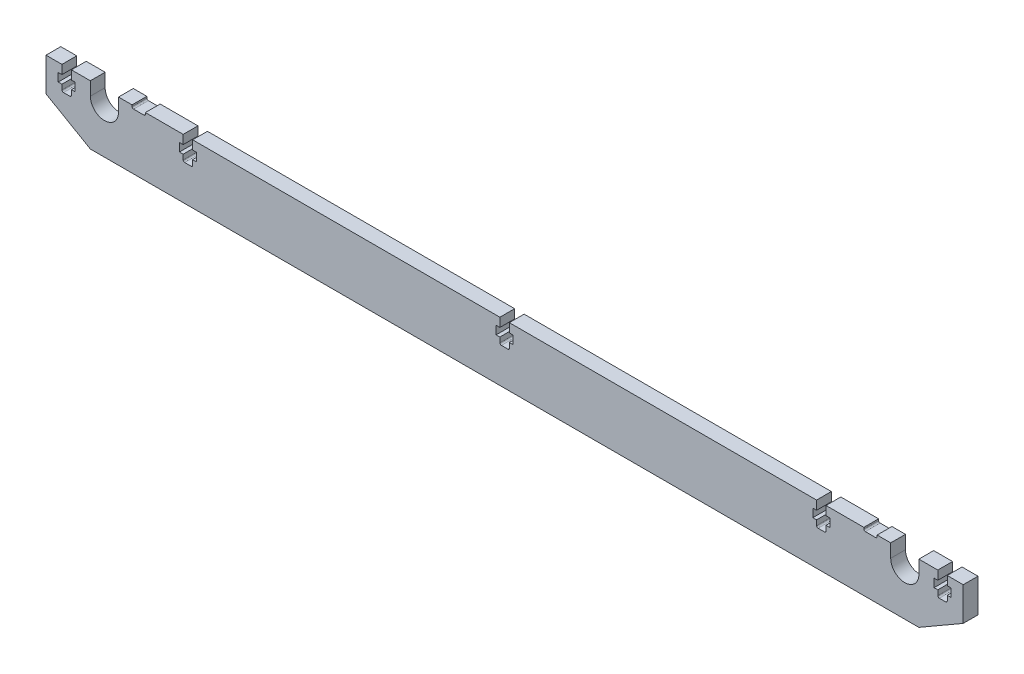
ISO-10303-21;
HEADER;
FILE_DESCRIPTION(('STEP AP214'),'2;1');
FILE_NAME('part.step','',(''),(''),'','','');
FILE_SCHEMA(('AUTOMOTIVE_DESIGN { 1 0 10303 214 1 1 1 1 }'));
ENDSEC;
DATA;
#1=APPLICATION_CONTEXT('core data for automotive mechanical design processes');
#2=APPLICATION_PROTOCOL_DEFINITION('international standard','automotive_design',2000,#1);
#3=PRODUCT_CONTEXT('',#1,'mechanical');
#4=PRODUCT('Part','Part','',(#3));
#5=PRODUCT_RELATED_PRODUCT_CATEGORY('part','',(#4));
#6=PRODUCT_DEFINITION_FORMATION('','',#4);
#7=PRODUCT_DEFINITION_CONTEXT('part definition',#1,'design');
#8=PRODUCT_DEFINITION('design','',#6,#7);
#9=PRODUCT_DEFINITION_SHAPE('','',#8);
#10=(LENGTH_UNIT() NAMED_UNIT(*) SI_UNIT(.MILLI.,.METRE.));
#11=(NAMED_UNIT(*) PLANE_ANGLE_UNIT() SI_UNIT($,.RADIAN.));
#12=(NAMED_UNIT(*) SI_UNIT($,.STERADIAN.) SOLID_ANGLE_UNIT());
#13=UNCERTAINTY_MEASURE_WITH_UNIT(LENGTH_MEASURE(1.E-05),#10,'distance_accuracy_value','');
#14=(GEOMETRIC_REPRESENTATION_CONTEXT(3) GLOBAL_UNCERTAINTY_ASSIGNED_CONTEXT((#13)) GLOBAL_UNIT_ASSIGNED_CONTEXT((#10,
#11,#12)) REPRESENTATION_CONTEXT('',''));
#15=CARTESIAN_POINT('',(0.,0.,0.));
#16=DIRECTION('',(0.,0.,1.));
#17=DIRECTION('',(1.,0.,0.));
#18=AXIS2_PLACEMENT_3D('',#15,#16,#17);
#19=CARTESIAN_POINT('',(-130.5875,-0.250000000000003,109.6));
#20=DIRECTION('',(0.,1.,0.));
#21=DIRECTION('',(-1.,0.,0.));
#22=AXIS2_PLACEMENT_3D('',#19,#20,#21);
#23=PLANE('',#22);
#24=DIRECTION('',(0.,0.,1.));
#25=VECTOR('',#24,1.);
#26=CARTESIAN_POINT('',(126.,-0.249999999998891,-163.3));
#27=LINE('',#26,#25);
#28=CARTESIAN_POINT('',(126.,-0.249999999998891,104.6));
#29=VERTEX_POINT('',#28);
#30=CARTESIAN_POINT('',(126.,-0.249999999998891,109.6));
#31=VERTEX_POINT('',#30);
#32=EDGE_CURVE('E2380',#29,#31,#27,.T.);
#33=ORIENTED_EDGE('',*,*,#32,.T.);
#34=DIRECTION('',(1.,0.,0.));
#35=VECTOR('',#34,1.);
#36=CARTESIAN_POINT('',(-130.5875,-0.250000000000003,109.6));
#37=LINE('',#36,#35);
#38=CARTESIAN_POINT('',(130.5875,-0.250000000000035,109.6));
#39=VERTEX_POINT('',#38);
#40=EDGE_CURVE('E648',#31,#39,#37,.T.);
#41=ORIENTED_EDGE('',*,*,#40,.T.);
#42=DIRECTION('',(0.,0.,-1.));
#43=VECTOR('',#42,1.);
#44=CARTESIAN_POINT('',(130.5875,-0.250000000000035,109.6));
#45=LINE('',#44,#43);
#46=CARTESIAN_POINT('',(130.5875,-0.250000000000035,104.6));
#47=VERTEX_POINT('',#46);
#48=EDGE_CURVE('E761',#39,#47,#45,.T.);
#49=ORIENTED_EDGE('',*,*,#48,.T.);
#50=DIRECTION('',(1.,0.,0.));
#51=VECTOR('',#50,1.);
#52=CARTESIAN_POINT('',(-130.5875,-0.250000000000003,104.6));
#53=LINE('',#52,#51);
#54=EDGE_CURVE('E710',#29,#47,#53,.T.);
#55=ORIENTED_EDGE('',*,*,#54,.F.);
#56=EDGE_LOOP('',(#33,#41,#49,#55));
#57=FACE_BOUND('',#56,.T.);
#58=ADVANCED_FACE('F30',(#57),#23,.T.);
#59=DIRECTION('',(0.,0.,1.));
#60=VECTOR('',#59,1.);
#61=CARTESIAN_POINT('',(-108.7125,-0.249999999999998,-163.3));
#62=LINE('',#61,#60);
#63=CARTESIAN_POINT('',(-108.7125,-0.249999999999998,104.6));
#64=VERTEX_POINT('',#63);
#65=CARTESIAN_POINT('',(-108.7125,-0.249999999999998,109.6));
#66=VERTEX_POINT('',#65);
#67=EDGE_CURVE('E1002',#64,#66,#62,.T.);
#68=ORIENTED_EDGE('',*,*,#67,.F.);
#69=CARTESIAN_POINT('',(-121.5,-0.250000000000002,104.6));
#70=VERTEX_POINT('',#69);
#71=EDGE_CURVE('E715',#70,#64,#53,.T.);
#72=ORIENTED_EDGE('',*,*,#71,.F.);
#73=DIRECTION('',(0.,0.,1.));
#74=VECTOR('',#73,1.);
#75=CARTESIAN_POINT('',(-121.5,-0.250000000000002,-163.3));
#76=LINE('',#75,#74);
#77=CARTESIAN_POINT('',(-121.5,-0.250000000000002,109.6));
#78=VERTEX_POINT('',#77);
#79=EDGE_CURVE('E1163',#70,#78,#76,.T.);
#80=ORIENTED_EDGE('',*,*,#79,.T.);
#81=EDGE_CURVE('E652',#78,#66,#37,.T.);
#82=ORIENTED_EDGE('',*,*,#81,.T.);
#83=EDGE_LOOP('',(#68,#72,#80,#82));
#84=FACE_BOUND('',#83,.T.);
#85=ADVANCED_FACE('F957',(#84),#23,.T.);
#86=CARTESIAN_POINT('',(140.1125,-0.250000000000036,109.6));
#87=DIRECTION('',(0.,1.,0.));
#88=DIRECTION('',(-1.,0.,0.));
#89=AXIS2_PLACEMENT_3D('',#86,#87,#88);
#90=PLANE('',#89);
#91=DIRECTION('',(0.,0.,1.));
#92=VECTOR('',#91,1.);
#93=CARTESIAN_POINT('',(146.5125,-0.249999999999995,-163.3));
#94=LINE('',#93,#92);
#95=CARTESIAN_POINT('',(146.5125,-0.249999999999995,104.6));
#96=VERTEX_POINT('',#95);
#97=CARTESIAN_POINT('',(146.5125,-0.249999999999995,109.6));
#98=VERTEX_POINT('',#97);
#99=EDGE_CURVE('E1329',#96,#98,#94,.T.);
#100=ORIENTED_EDGE('',*,*,#99,.F.);
#101=DIRECTION('',(1.,0.,0.));
#102=VECTOR('',#101,1.);
#103=CARTESIAN_POINT('',(140.1125,-0.250000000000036,104.6));
#104=LINE('',#103,#102);
#105=CARTESIAN_POINT('',(140.1125,-0.250000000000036,104.6));
#106=VERTEX_POINT('',#105);
#107=EDGE_CURVE('E725',#106,#96,#104,.T.);
#108=ORIENTED_EDGE('',*,*,#107,.F.);
#109=DIRECTION('',(0.,0.,-1.));
#110=VECTOR('',#109,1.);
#111=CARTESIAN_POINT('',(140.1125,-0.250000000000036,109.6));
#112=LINE('',#111,#110);
#113=CARTESIAN_POINT('',(140.1125,-0.250000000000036,109.6));
#114=VERTEX_POINT('',#113);
#115=EDGE_CURVE('E755',#114,#106,#112,.T.);
#116=ORIENTED_EDGE('',*,*,#115,.F.);
#117=DIRECTION('',(1.,0.,0.));
#118=VECTOR('',#117,1.);
#119=CARTESIAN_POINT('',(140.1125,-0.250000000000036,109.6));
#120=LINE('',#119,#118);
#121=EDGE_CURVE('E684',#114,#98,#120,.T.);
#122=ORIENTED_EDGE('',*,*,#121,.T.);
#123=EDGE_LOOP('',(#100,#108,#116,#122));
#124=FACE_BOUND('',#123,.T.);
#125=ADVANCED_FACE('F963',(#124),#90,.T.);
#126=DIRECTION('',(0.,0.,1.));
#127=VECTOR('',#126,1.);
#128=CARTESIAN_POINT('',(105.5125,-0.249999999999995,-163.3));
#129=LINE('',#128,#127);
#130=CARTESIAN_POINT('',(105.5125,-0.249999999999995,104.6));
#131=VERTEX_POINT('',#130);
#132=CARTESIAN_POINT('',(105.5125,-0.249999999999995,109.6));
#133=VERTEX_POINT('',#132);
#134=EDGE_CURVE('E1406',#131,#133,#129,.T.);
#135=ORIENTED_EDGE('',*,*,#134,.F.);
#136=CARTESIAN_POINT('',(1.59999999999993,-0.250000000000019,104.6));
#137=VERTEX_POINT('',#136);
#138=EDGE_CURVE('E1425',#137,#131,#53,.T.);
#139=ORIENTED_EDGE('',*,*,#138,.F.);
#140=DIRECTION('',(0.,0.,1.));
#141=VECTOR('',#140,1.);
#142=CARTESIAN_POINT('',(1.59999999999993,-0.249999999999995,-163.3));
#143=LINE('',#142,#141);
#144=CARTESIAN_POINT('',(1.59999999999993,-0.249999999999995,109.6));
#145=VERTEX_POINT('',#144);
#146=EDGE_CURVE('E1077',#137,#145,#143,.T.);
#147=ORIENTED_EDGE('',*,*,#146,.T.);
#148=EDGE_CURVE('E647',#145,#133,#37,.T.);
#149=ORIENTED_EDGE('',*,*,#148,.T.);
#150=EDGE_LOOP('',(#135,#139,#147,#149));
#151=FACE_BOUND('',#150,.T.);
#152=ADVANCED_FACE('F964',(#151),#23,.T.);
#153=DIRECTION('',(0.,0.,1.));
#154=VECTOR('',#153,1.);
#155=CARTESIAN_POINT('',(-105.5125,-0.249999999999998,-163.3));
#156=LINE('',#155,#154);
#157=CARTESIAN_POINT('',(-105.5125,-0.249999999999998,104.6));
#158=VERTEX_POINT('',#157);
#159=CARTESIAN_POINT('',(-105.5125,-0.249999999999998,109.6));
#160=VERTEX_POINT('',#159);
#161=EDGE_CURVE('E998',#158,#160,#156,.T.);
#162=ORIENTED_EDGE('',*,*,#161,.T.);
#163=CARTESIAN_POINT('',(-1.60000000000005,-0.249999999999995,109.6));
#164=VERTEX_POINT('',#163);
#165=EDGE_CURVE('E650',#160,#164,#37,.T.);
#166=ORIENTED_EDGE('',*,*,#165,.T.);
#167=DIRECTION('',(0.,0.,1.));
#168=VECTOR('',#167,1.);
#169=CARTESIAN_POINT('',(-1.60000000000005,-0.249999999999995,-163.3));
#170=LINE('',#169,#168);
#171=CARTESIAN_POINT('',(-1.60000000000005,-0.249999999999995,104.6));
#172=VERTEX_POINT('',#171);
#173=EDGE_CURVE('E1075',#172,#164,#170,.T.);
#174=ORIENTED_EDGE('',*,*,#173,.F.);
#175=EDGE_CURVE('E999',#158,#172,#53,.T.);
#176=ORIENTED_EDGE('',*,*,#175,.F.);
#177=EDGE_LOOP('',(#162,#166,#174,#176));
#178=FACE_BOUND('',#177,.T.);
#179=ADVANCED_FACE('F981',(#178),#23,.T.);
#180=CARTESIAN_POINT('',(-155.1125,-0.25,109.6));
#181=DIRECTION('',(0.,1.,0.));
#182=DIRECTION('',(-1.,0.,0.));
#183=AXIS2_PLACEMENT_3D('',#180,#181,#182);
#184=PLANE('',#183);
#185=DIRECTION('',(0.,0.,1.));
#186=VECTOR('',#185,1.);
#187=CARTESIAN_POINT('',(-149.7125,-0.25,-163.3));
#188=LINE('',#187,#186);
#189=CARTESIAN_POINT('',(-149.7125,-0.25,104.6));
#190=VERTEX_POINT('',#189);
#191=CARTESIAN_POINT('',(-149.7125,-0.25,109.6));
#192=VERTEX_POINT('',#191);
#193=EDGE_CURVE('E1142',#190,#192,#188,.T.);
#194=ORIENTED_EDGE('',*,*,#193,.F.);
#195=DIRECTION('',(1.,0.,0.));
#196=VECTOR('',#195,1.);
#197=CARTESIAN_POINT('',(-155.1125,-0.25,104.6));
#198=LINE('',#197,#196);
#199=CARTESIAN_POINT('',(-155.1125,-0.25,104.6));
#200=VERTEX_POINT('',#199);
#201=EDGE_CURVE('E736',#200,#190,#198,.T.);
#202=ORIENTED_EDGE('',*,*,#201,.F.);
#203=DIRECTION('',(0.,0.,-1.));
#204=VECTOR('',#203,1.);
#205=CARTESIAN_POINT('',(-155.1125,-0.25,109.6));
#206=LINE('',#205,#204);
#207=CARTESIAN_POINT('',(-155.1125,-0.25,109.6));
#208=VERTEX_POINT('',#207);
#209=EDGE_CURVE('E749',#208,#200,#206,.T.);
#210=ORIENTED_EDGE('',*,*,#209,.F.);
#211=DIRECTION('',(1.,0.,0.));
#212=VECTOR('',#211,1.);
#213=CARTESIAN_POINT('',(-155.1125,-0.25,109.6));
#214=LINE('',#213,#212);
#215=EDGE_CURVE('E696',#208,#192,#214,.T.);
#216=ORIENTED_EDGE('',*,*,#215,.T.);
#217=EDGE_LOOP('',(#194,#202,#210,#216));
#218=FACE_BOUND('',#217,.T.);
#219=ADVANCED_FACE('F980',(#218),#184,.T.);
#220=DIRECTION('',(0.,0.,1.));
#221=VECTOR('',#220,1.);
#222=CARTESIAN_POINT('',(-126.,-0.250000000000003,-163.3));
#223=LINE('',#222,#221);
#224=CARTESIAN_POINT('',(-126.,-0.250000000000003,104.6));
#225=VERTEX_POINT('',#224);
#226=CARTESIAN_POINT('',(-126.,-0.250000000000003,109.6));
#227=VERTEX_POINT('',#226);
#228=EDGE_CURVE('E707',#225,#227,#223,.T.);
#229=ORIENTED_EDGE('',*,*,#228,.F.);
#230=CARTESIAN_POINT('',(-130.5875,-0.250000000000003,104.6));
#231=VERTEX_POINT('',#230);
#232=EDGE_CURVE('E711',#231,#225,#53,.T.);
#233=ORIENTED_EDGE('',*,*,#232,.F.);
#234=DIRECTION('',(0.,0.,-1.));
#235=VECTOR('',#234,1.);
#236=CARTESIAN_POINT('',(-130.5875,-0.250000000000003,109.6));
#237=LINE('',#236,#235);
#238=CARTESIAN_POINT('',(-130.5875,-0.250000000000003,109.6));
#239=VERTEX_POINT('',#238);
#240=EDGE_CURVE('E764',#239,#231,#237,.T.);
#241=ORIENTED_EDGE('',*,*,#240,.F.);
#242=EDGE_CURVE('E654',#239,#227,#37,.T.);
#243=ORIENTED_EDGE('',*,*,#242,.T.);
#244=EDGE_LOOP('',(#229,#233,#241,#243));
#245=FACE_BOUND('',#244,.T.);
#246=ADVANCED_FACE('F971',(#245),#23,.T.);
#247=CARTESIAN_POINT('',(-135.35,-4.7625,109.6));
#248=DIRECTION('',(0.,0.,-1.));
#249=DIRECTION('',(-1.,0.,0.));
#250=AXIS2_PLACEMENT_3D('',#247,#248,#249);
#251=CYLINDRICAL_SURFACE('',#250,4.7625);
#252=CARTESIAN_POINT('',(-135.35,-4.7625,104.6));
#253=DIRECTION('',(0.,0.,1.));
#254=DIRECTION('',(-1.,0.,0.));
#255=AXIS2_PLACEMENT_3D('',#252,#253,#254);
#256=CIRCLE('',#255,4.7625);
#257=CARTESIAN_POINT('',(-140.1125,-4.7625,104.6));
#258=VERTEX_POINT('',#257);
#259=CARTESIAN_POINT('',(-130.5875,-4.7625,104.6));
#260=VERTEX_POINT('',#259);
#261=EDGE_CURVE('E703',#258,#260,#256,.T.);
#262=ORIENTED_EDGE('',*,*,#261,.F.);
#263=DIRECTION('',(0.,0.,-1.));
#264=VECTOR('',#263,1.);
#265=CARTESIAN_POINT('',(-140.1125,-4.7625,109.6));
#266=LINE('',#265,#264);
#267=CARTESIAN_POINT('',(-140.1125,-4.7625,109.6));
#268=VERTEX_POINT('',#267);
#269=EDGE_CURVE('E743',#268,#258,#266,.T.);
#270=ORIENTED_EDGE('',*,*,#269,.F.);
#271=CARTESIAN_POINT('',(-135.35,-4.7625,109.6));
#272=DIRECTION('',(0.,0.,1.));
#273=DIRECTION('',(-1.,0.,0.));
#274=AXIS2_PLACEMENT_3D('',#271,#272,#273);
#275=CIRCLE('',#274,4.7625);
#276=CARTESIAN_POINT('',(-130.5875,-4.7625,109.6));
#277=VERTEX_POINT('',#276);
#278=EDGE_CURVE('E742',#268,#277,#275,.T.);
#279=ORIENTED_EDGE('',*,*,#278,.T.);
#280=DIRECTION('',(0.,0.,-1.));
#281=VECTOR('',#280,1.);
#282=CARTESIAN_POINT('',(-130.5875,-4.7625,109.6));
#283=LINE('',#282,#281);
#284=EDGE_CURVE('E702',#277,#260,#283,.T.);
#285=ORIENTED_EDGE('',*,*,#284,.T.);
#286=EDGE_LOOP('',(#262,#270,#279,#285));
#287=FACE_BOUND('',#286,.T.);
#288=ADVANCED_FACE('F979',(#287),#251,.F.);
#289=CARTESIAN_POINT('',(-140.1125,-4.7625,109.6));
#290=DIRECTION('',(1.,0.,0.));
#291=DIRECTION('',(0.,0.,-1.));
#292=AXIS2_PLACEMENT_3D('',#289,#290,#291);
#293=PLANE('',#292);
#294=DIRECTION('',(0.,-1.,0.));
#295=VECTOR('',#294,1.);
#296=CARTESIAN_POINT('',(-140.1125,-4.7625,104.6));
#297=LINE('',#296,#295);
#298=CARTESIAN_POINT('',(-140.1125,-0.250000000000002,104.6));
#299=VERTEX_POINT('',#298);
#300=EDGE_CURVE('E739',#299,#258,#297,.T.);
#301=ORIENTED_EDGE('',*,*,#300,.F.);
#302=DIRECTION('',(0.,0.,-1.));
#303=VECTOR('',#302,1.);
#304=CARTESIAN_POINT('',(-140.1125,-0.250000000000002,109.6));
#305=LINE('',#304,#303);
#306=CARTESIAN_POINT('',(-140.1125,-0.250000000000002,109.6));
#307=VERTEX_POINT('',#306);
#308=EDGE_CURVE('E746',#307,#299,#305,.T.);
#309=ORIENTED_EDGE('',*,*,#308,.F.);
#310=DIRECTION('',(0.,-1.,0.));
#311=VECTOR('',#310,1.);
#312=CARTESIAN_POINT('',(-140.1125,-4.7625,109.6));
#313=LINE('',#312,#311);
#314=EDGE_CURVE('E699',#307,#268,#313,.T.);
#315=ORIENTED_EDGE('',*,*,#314,.T.);
#316=ORIENTED_EDGE('',*,*,#269,.T.);
#317=EDGE_LOOP('',(#301,#309,#315,#316));
#318=FACE_BOUND('',#317,.T.);
#319=ADVANCED_FACE('F986',(#318),#293,.T.);
#320=DIRECTION('',(0.,0.,1.));
#321=VECTOR('',#320,1.);
#322=CARTESIAN_POINT('',(-146.5125,-0.249999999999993,-163.3));
#323=LINE('',#322,#321);
#324=CARTESIAN_POINT('',(-146.5125,-0.250000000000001,104.6));
#325=VERTEX_POINT('',#324);
#326=CARTESIAN_POINT('',(-146.5125,-0.249999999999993,109.6));
#327=VERTEX_POINT('',#326);
#328=EDGE_CURVE('E1144',#325,#327,#323,.T.);
#329=ORIENTED_EDGE('',*,*,#328,.T.);
#330=EDGE_CURVE('E695',#327,#307,#214,.T.);
#331=ORIENTED_EDGE('',*,*,#330,.T.);
#332=ORIENTED_EDGE('',*,*,#308,.T.);
#333=EDGE_CURVE('E735',#325,#299,#198,.T.);
#334=ORIENTED_EDGE('',*,*,#333,.F.);
#335=EDGE_LOOP('',(#329,#331,#332,#334));
#336=FACE_BOUND('',#335,.T.);
#337=ADVANCED_FACE('F991',(#336),#184,.T.);
#338=CARTESIAN_POINT('',(-155.1125,-0.25,109.6));
#339=DIRECTION('',(-1.,0.,0.));
#340=DIRECTION('',(0.,0.,1.));
#341=AXIS2_PLACEMENT_3D('',#338,#339,#340);
#342=PLANE('',#341);
#343=DIRECTION('',(0.,1.,0.));
#344=VECTOR('',#343,1.);
#345=CARTESIAN_POINT('',(-155.1125,-0.25,104.6));
#346=LINE('',#345,#344);
#347=CARTESIAN_POINT('',(-155.1125,-11.5897459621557,104.6));
#348=VERTEX_POINT('',#347);
#349=EDGE_CURVE('E733',#348,#200,#346,.T.);
#350=ORIENTED_EDGE('',*,*,#349,.F.);
#351=DIRECTION('',(0.,0.,1.));
#352=VECTOR('',#351,1.);
#353=CARTESIAN_POINT('',(-155.1125,-11.5897459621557,109.6));
#354=LINE('',#353,#352);
#355=CARTESIAN_POINT('',(-155.1125,-11.5897459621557,109.6));
#356=VERTEX_POINT('',#355);
#357=EDGE_CURVE('E38',#348,#356,#354,.T.);
#358=ORIENTED_EDGE('',*,*,#357,.T.);
#359=DIRECTION('',(0.,1.,0.));
#360=VECTOR('',#359,1.);
#361=CARTESIAN_POINT('',(-155.1125,-0.25,109.6));
#362=LINE('',#361,#360);
#363=EDGE_CURVE('E693',#356,#208,#362,.T.);
#364=ORIENTED_EDGE('',*,*,#363,.T.);
#365=ORIENTED_EDGE('',*,*,#209,.T.);
#366=EDGE_LOOP('',(#350,#358,#364,#365));
#367=FACE_BOUND('',#366,.T.);
#368=ADVANCED_FACE('F1252',(#367),#342,.T.);
#369=CARTESIAN_POINT('',(-155.1125,-20.25,109.6));
#370=DIRECTION('',(0.,-1.,0.));
#371=DIRECTION('',(1.,0.,0.));
#372=AXIS2_PLACEMENT_3D('',#369,#370,#371);
#373=PLANE('',#372);
#374=DIRECTION('',(-1.,0.,0.));
#375=VECTOR('',#374,1.);
#376=CARTESIAN_POINT('',(-155.1125,-20.25,109.6));
#377=LINE('',#376,#375);
#378=CARTESIAN_POINT('',(140.1125,-20.2500000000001,109.6));
#379=VERTEX_POINT('',#378);
#380=CARTESIAN_POINT('',(-140.1125,-20.25,109.6));
#381=VERTEX_POINT('',#380);
#382=EDGE_CURVE('E690',#379,#381,#377,.T.);
#383=ORIENTED_EDGE('',*,*,#382,.T.);
#384=DIRECTION('',(0.,0.,-1.));
#385=VECTOR('',#384,1.);
#386=CARTESIAN_POINT('',(-140.1125,-20.25,109.6));
#387=LINE('',#386,#385);
#388=CARTESIAN_POINT('',(-140.1125,-20.25,104.6));
#389=VERTEX_POINT('',#388);
#390=EDGE_CURVE('E928',#381,#389,#387,.T.);
#391=ORIENTED_EDGE('',*,*,#390,.T.);
#392=DIRECTION('',(-1.,0.,0.));
#393=VECTOR('',#392,1.);
#394=CARTESIAN_POINT('',(-155.1125,-20.25,104.6));
#395=LINE('',#394,#393);
#396=CARTESIAN_POINT('',(140.1125,-20.25,104.6));
#397=VERTEX_POINT('',#396);
#398=EDGE_CURVE('E731',#397,#389,#395,.T.);
#399=ORIENTED_EDGE('',*,*,#398,.F.);
#400=DIRECTION('',(0.,0.,1.));
#401=VECTOR('',#400,1.);
#402=CARTESIAN_POINT('',(140.1125,-20.25,109.6));
#403=LINE('',#402,#401);
#404=EDGE_CURVE('E924',#397,#379,#403,.T.);
#405=ORIENTED_EDGE('',*,*,#404,.T.);
#406=EDGE_LOOP('',(#383,#391,#399,#405));
#407=FACE_BOUND('',#406,.T.);
#408=ADVANCED_FACE('F934',(#407),#373,.T.);
#409=CARTESIAN_POINT('',(155.1125,-20.25,109.6));
#410=DIRECTION('',(1.,0.,0.));
#411=DIRECTION('',(0.,0.,-1.));
#412=AXIS2_PLACEMENT_3D('',#409,#410,#411);
#413=PLANE('',#412);
#414=DIRECTION('',(0.,-1.,0.));
#415=VECTOR('',#414,1.);
#416=CARTESIAN_POINT('',(155.1125,-20.25,109.6));
#417=LINE('',#416,#415);
#418=CARTESIAN_POINT('',(155.1125,-0.250000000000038,109.6));
#419=VERTEX_POINT('',#418);
#420=CARTESIAN_POINT('',(155.1125,-11.5897459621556,109.6));
#421=VERTEX_POINT('',#420);
#422=EDGE_CURVE('E687',#419,#421,#417,.T.);
#423=ORIENTED_EDGE('',*,*,#422,.T.);
#424=DIRECTION('',(0.,0.,-1.));
#425=VECTOR('',#424,1.);
#426=CARTESIAN_POINT('',(155.1125,-11.5897459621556,109.6));
#427=LINE('',#426,#425);
#428=CARTESIAN_POINT('',(155.1125,-11.5897459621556,104.6));
#429=VERTEX_POINT('',#428);
#430=EDGE_CURVE('E919',#421,#429,#427,.T.);
#431=ORIENTED_EDGE('',*,*,#430,.T.);
#432=DIRECTION('',(0.,-1.,0.));
#433=VECTOR('',#432,1.);
#434=CARTESIAN_POINT('',(155.1125,-20.25,104.6));
#435=LINE('',#434,#433);
#436=CARTESIAN_POINT('',(155.1125,-0.250000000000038,104.6));
#437=VERTEX_POINT('',#436);
#438=EDGE_CURVE('E728',#437,#429,#435,.T.);
#439=ORIENTED_EDGE('',*,*,#438,.F.);
#440=DIRECTION('',(0.,0.,-1.));
#441=VECTOR('',#440,1.);
#442=CARTESIAN_POINT('',(155.1125,-0.250000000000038,109.6));
#443=LINE('',#442,#441);
#444=EDGE_CURVE('E752',#419,#437,#443,.T.);
#445=ORIENTED_EDGE('',*,*,#444,.F.);
#446=EDGE_LOOP('',(#423,#431,#439,#445));
#447=FACE_BOUND('',#446,.T.);
#448=ADVANCED_FACE('F946',(#447),#413,.T.);
#449=DIRECTION('',(0.,0.,1.));
#450=VECTOR('',#449,1.);
#451=CARTESIAN_POINT('',(149.7125,-0.249999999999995,-163.3));
#452=LINE('',#451,#450);
#453=CARTESIAN_POINT('',(149.7125,-0.250000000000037,104.6));
#454=VERTEX_POINT('',#453);
#455=CARTESIAN_POINT('',(149.7125,-0.249999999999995,109.6));
#456=VERTEX_POINT('',#455);
#457=EDGE_CURVE('E1333',#454,#456,#452,.T.);
#458=ORIENTED_EDGE('',*,*,#457,.T.);
#459=EDGE_CURVE('E683',#456,#419,#120,.T.);
#460=ORIENTED_EDGE('',*,*,#459,.T.);
#461=ORIENTED_EDGE('',*,*,#444,.T.);
#462=EDGE_CURVE('E724',#454,#437,#104,.T.);
#463=ORIENTED_EDGE('',*,*,#462,.F.);
#464=EDGE_LOOP('',(#458,#460,#461,#463));
#465=FACE_BOUND('',#464,.T.);
#466=ADVANCED_FACE('F1301',(#465),#90,.T.);
#467=CARTESIAN_POINT('',(140.1125,-4.7625,109.6));
#468=DIRECTION('',(-1.,0.,0.));
#469=DIRECTION('',(0.,0.,1.));
#470=AXIS2_PLACEMENT_3D('',#467,#468,#469);
#471=PLANE('',#470);
#472=DIRECTION('',(0.,1.,0.));
#473=VECTOR('',#472,1.);
#474=CARTESIAN_POINT('',(140.1125,-4.7625,104.6));
#475=LINE('',#474,#473);
#476=CARTESIAN_POINT('',(140.1125,-4.7625,104.6));
#477=VERTEX_POINT('',#476);
#478=EDGE_CURVE('E721',#477,#106,#475,.T.);
#479=ORIENTED_EDGE('',*,*,#478,.F.);
#480=DIRECTION('',(0.,0.,-1.));
#481=VECTOR('',#480,1.);
#482=CARTESIAN_POINT('',(140.1125,-4.7625,109.6));
#483=LINE('',#482,#481);
#484=CARTESIAN_POINT('',(140.1125,-4.7625,109.6));
#485=VERTEX_POINT('',#484);
#486=EDGE_CURVE('E757',#485,#477,#483,.T.);
#487=ORIENTED_EDGE('',*,*,#486,.F.);
#488=DIRECTION('',(0.,1.,0.));
#489=VECTOR('',#488,1.);
#490=CARTESIAN_POINT('',(140.1125,-4.7625,109.6));
#491=LINE('',#490,#489);
#492=EDGE_CURVE('E678',#485,#114,#491,.T.);
#493=ORIENTED_EDGE('',*,*,#492,.T.);
#494=ORIENTED_EDGE('',*,*,#115,.T.);
#495=EDGE_LOOP('',(#479,#487,#493,#494));
#496=FACE_BOUND('',#495,.T.);
#497=ADVANCED_FACE('F1304',(#496),#471,.T.);
#498=CARTESIAN_POINT('',(135.35,-4.7625,109.6));
#499=DIRECTION('',(0.,0.,-1.));
#500=DIRECTION('',(-1.,0.,0.));
#501=AXIS2_PLACEMENT_3D('',#498,#499,#500);
#502=CYLINDRICAL_SURFACE('',#501,4.7625);
#503=CARTESIAN_POINT('',(135.35,-4.7625,104.6));
#504=DIRECTION('',(0.,0.,1.));
#505=DIRECTION('',(-1.,0.,0.));
#506=AXIS2_PLACEMENT_3D('',#503,#504,#505);
#507=CIRCLE('',#506,4.7625);
#508=CARTESIAN_POINT('',(130.5875,-4.7625,104.6));
#509=VERTEX_POINT('',#508);
#510=EDGE_CURVE('E718',#509,#477,#507,.T.);
#511=ORIENTED_EDGE('',*,*,#510,.F.);
#512=DIRECTION('',(0.,0.,-1.));
#513=VECTOR('',#512,1.);
#514=CARTESIAN_POINT('',(130.5875,-4.7625,109.6));
#515=LINE('',#514,#513);
#516=CARTESIAN_POINT('',(130.5875,-4.7625,109.6));
#517=VERTEX_POINT('',#516);
#518=EDGE_CURVE('E759',#517,#509,#515,.T.);
#519=ORIENTED_EDGE('',*,*,#518,.F.);
#520=CARTESIAN_POINT('',(135.35,-4.7625,109.6));
#521=DIRECTION('',(0.,0.,1.));
#522=DIRECTION('',(-1.,0.,0.));
#523=AXIS2_PLACEMENT_3D('',#520,#521,#522);
#524=CIRCLE('',#523,4.7625);
#525=EDGE_CURVE('E673',#517,#485,#524,.T.);
#526=ORIENTED_EDGE('',*,*,#525,.T.);
#527=ORIENTED_EDGE('',*,*,#486,.T.);
#528=EDGE_LOOP('',(#511,#519,#526,#527));
#529=FACE_BOUND('',#528,.T.);
#530=ADVANCED_FACE('F977',(#529),#502,.F.);
#531=CARTESIAN_POINT('',(130.5875,-4.7625,109.6));
#532=DIRECTION('',(1.,0.,0.));
#533=DIRECTION('',(0.,0.,-1.));
#534=AXIS2_PLACEMENT_3D('',#531,#532,#533);
#535=PLANE('',#534);
#536=DIRECTION('',(0.,-1.,0.));
#537=VECTOR('',#536,1.);
#538=CARTESIAN_POINT('',(130.5875,-4.7625,104.6));
#539=LINE('',#538,#537);
#540=EDGE_CURVE('E714',#47,#509,#539,.T.);
#541=ORIENTED_EDGE('',*,*,#540,.F.);
#542=ORIENTED_EDGE('',*,*,#48,.F.);
#543=DIRECTION('',(0.,-1.,0.));
#544=VECTOR('',#543,1.);
#545=CARTESIAN_POINT('',(130.5875,-4.7625,109.6));
#546=LINE('',#545,#544);
#547=EDGE_CURVE('E668',#39,#517,#546,.T.);
#548=ORIENTED_EDGE('',*,*,#547,.T.);
#549=ORIENTED_EDGE('',*,*,#518,.T.);
#550=EDGE_LOOP('',(#541,#542,#548,#549));
#551=FACE_BOUND('',#550,.T.);
#552=ADVANCED_FACE('F970',(#551),#535,.T.);
#553=DIRECTION('',(0.,0.,1.));
#554=VECTOR('',#553,1.);
#555=CARTESIAN_POINT('',(121.5,-0.24999999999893,-163.3));
#556=LINE('',#555,#554);
#557=CARTESIAN_POINT('',(121.5,-0.24999999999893,104.6));
#558=VERTEX_POINT('',#557);
#559=CARTESIAN_POINT('',(121.5,-0.24999999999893,109.6));
#560=VERTEX_POINT('',#559);
#561=EDGE_CURVE('E621',#558,#560,#556,.T.);
#562=ORIENTED_EDGE('',*,*,#561,.F.);
#563=CARTESIAN_POINT('',(108.7125,-0.250000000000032,104.6));
#564=VERTEX_POINT('',#563);
#565=EDGE_CURVE('E1427',#564,#558,#53,.T.);
#566=ORIENTED_EDGE('',*,*,#565,.F.);
#567=DIRECTION('',(0.,0.,1.));
#568=VECTOR('',#567,1.);
#569=CARTESIAN_POINT('',(108.7125,-0.249999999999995,-163.3));
#570=LINE('',#569,#568);
#571=CARTESIAN_POINT('',(108.7125,-0.249999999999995,109.6));
#572=VERTEX_POINT('',#571);
#573=EDGE_CURVE('E646',#564,#572,#570,.T.);
#574=ORIENTED_EDGE('',*,*,#573,.T.);
#575=EDGE_CURVE('E639',#572,#560,#37,.T.);
#576=ORIENTED_EDGE('',*,*,#575,.T.);
#577=EDGE_LOOP('',(#562,#566,#574,#576));
#578=FACE_BOUND('',#577,.T.);
#579=ADVANCED_FACE('F645',(#578),#23,.T.);
#580=CARTESIAN_POINT('',(-130.5875,-4.7625,109.6));
#581=DIRECTION('',(-1.,0.,0.));
#582=DIRECTION('',(0.,0.,1.));
#583=AXIS2_PLACEMENT_3D('',#580,#581,#582);
#584=PLANE('',#583);
#585=DIRECTION('',(0.,1.,0.));
#586=VECTOR('',#585,1.);
#587=CARTESIAN_POINT('',(-130.5875,-4.7625,104.6));
#588=LINE('',#587,#586);
#589=EDGE_CURVE('E706',#260,#231,#588,.T.);
#590=ORIENTED_EDGE('',*,*,#589,.F.);
#591=ORIENTED_EDGE('',*,*,#284,.F.);
#592=DIRECTION('',(0.,1.,0.));
#593=VECTOR('',#592,1.);
#594=CARTESIAN_POINT('',(-130.5875,-4.7625,109.6));
#595=LINE('',#594,#593);
#596=EDGE_CURVE('E653',#277,#239,#595,.T.);
#597=ORIENTED_EDGE('',*,*,#596,.T.);
#598=ORIENTED_EDGE('',*,*,#240,.T.);
#599=EDGE_LOOP('',(#590,#591,#597,#598));
#600=FACE_BOUND('',#599,.T.);
#601=ADVANCED_FACE('F969',(#600),#584,.T.);
#602=CARTESIAN_POINT('',(-135.35,-4.7625,109.6));
#603=DIRECTION('',(0.,0.,-1.));
#604=DIRECTION('',(-1.,0.,0.));
#605=AXIS2_PLACEMENT_3D('',#602,#603,#604);
#606=PLANE('',#605);
#607=ORIENTED_EDGE('',*,*,#363,.F.);
#608=DIRECTION('',(-0.866025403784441,0.499999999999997,0.));
#609=VECTOR('',#608,1.);
#610=CARTESIAN_POINT('',(-140.1125,-20.25,109.6));
#611=LINE('',#610,#609);
#612=EDGE_CURVE('E11',#356,#381,#611,.F.);
#613=ORIENTED_EDGE('',*,*,#612,.T.);
#614=ORIENTED_EDGE('',*,*,#382,.F.);
#615=DIRECTION('',(-0.866025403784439,-0.499999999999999,0.));
#616=VECTOR('',#615,1.);
#617=CARTESIAN_POINT('',(155.1125,-11.5897459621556,109.6));
#618=LINE('',#617,#616);
#619=EDGE_CURVE('E926',#379,#421,#618,.F.);
#620=ORIENTED_EDGE('',*,*,#619,.T.);
#621=ORIENTED_EDGE('',*,*,#422,.F.);
#622=ORIENTED_EDGE('',*,*,#459,.F.);
#623=DIRECTION('',(0.,1.,0.));
#624=VECTOR('',#623,1.);
#625=CARTESIAN_POINT('',(149.7125,-0.249999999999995,109.6));
#626=LINE('',#625,#624);
#627=CARTESIAN_POINT('',(149.7125,-3.24999999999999,109.6));
#628=VERTEX_POINT('',#627);
#629=EDGE_CURVE('E1460',#628,#456,#626,.T.);
#630=ORIENTED_EDGE('',*,*,#629,.F.);
#631=DIRECTION('',(-1.,0.,0.));
#632=VECTOR('',#631,1.);
#633=CARTESIAN_POINT('',(149.7125,-3.24999999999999,109.6));
#634=LINE('',#633,#632);
#635=CARTESIAN_POINT('',(150.9725,-3.24999999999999,109.6));
#636=VERTEX_POINT('',#635);
#637=EDGE_CURVE('E1457',#636,#628,#634,.T.);
#638=ORIENTED_EDGE('',*,*,#637,.F.);
#639=DIRECTION('',(0.,1.,0.));
#640=VECTOR('',#639,1.);
#641=CARTESIAN_POINT('',(150.9725,-3.24999999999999,109.6));
#642=LINE('',#641,#640);
#643=CARTESIAN_POINT('',(150.9725,-6.04999999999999,109.6));
#644=VERTEX_POINT('',#643);
#645=EDGE_CURVE('E1343',#644,#636,#642,.T.);
#646=ORIENTED_EDGE('',*,*,#645,.F.);
#647=DIRECTION('',(1.,0.,0.));
#648=VECTOR('',#647,1.);
#649=CARTESIAN_POINT('',(150.9725,-6.04999999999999,109.6));
#650=LINE('',#649,#648);
#651=CARTESIAN_POINT('',(149.7125,-6.04999999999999,109.6));
#652=VERTEX_POINT('',#651);
#653=EDGE_CURVE('E1489',#652,#644,#650,.T.);
#654=ORIENTED_EDGE('',*,*,#653,.F.);
#655=DIRECTION('',(0.,1.,0.));
#656=VECTOR('',#655,1.);
#657=CARTESIAN_POINT('',(149.7125,-6.04999999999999,109.6));
#658=LINE('',#657,#656);
#659=CARTESIAN_POINT('',(149.7125,-7.74999999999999,109.6));
#660=VERTEX_POINT('',#659);
#661=EDGE_CURVE('E1486',#660,#652,#658,.T.);
#662=ORIENTED_EDGE('',*,*,#661,.F.);
#663=CARTESIAN_POINT('',(149.2125,-7.74999999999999,109.6));
#664=DIRECTION('',(0.,0.,1.));
#665=DIRECTION('',(1.,0.,0.));
#666=AXIS2_PLACEMENT_3D('',#663,#664,#665);
#667=CIRCLE('',#666,0.5);
#668=CARTESIAN_POINT('',(149.2125,-8.24999999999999,109.6));
#669=VERTEX_POINT('',#668);
#670=EDGE_CURVE('E1483',#669,#660,#667,.T.);
#671=ORIENTED_EDGE('',*,*,#670,.F.);
#672=DIRECTION('',(1.,0.,0.));
#673=VECTOR('',#672,1.);
#674=CARTESIAN_POINT('',(147.0125,-8.24999999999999,109.6));
#675=LINE('',#674,#673);
#676=CARTESIAN_POINT('',(147.0125,-8.24999999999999,109.6));
#677=VERTEX_POINT('',#676);
#678=EDGE_CURVE('E1480',#677,#669,#675,.T.);
#679=ORIENTED_EDGE('',*,*,#678,.F.);
#680=CARTESIAN_POINT('',(147.0125,-7.74999999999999,109.6));
#681=DIRECTION('',(0.,0.,1.));
#682=DIRECTION('',(-1.,0.,0.));
#683=AXIS2_PLACEMENT_3D('',#680,#681,#682);
#684=CIRCLE('',#683,0.5);
#685=CARTESIAN_POINT('',(146.5125,-7.74999999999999,109.6));
#686=VERTEX_POINT('',#685);
#687=EDGE_CURVE('E1477',#686,#677,#684,.T.);
#688=ORIENTED_EDGE('',*,*,#687,.F.);
#689=DIRECTION('',(0.,-1.,0.));
#690=VECTOR('',#689,1.);
#691=CARTESIAN_POINT('',(146.5125,-6.04999999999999,109.6));
#692=LINE('',#691,#690);
#693=CARTESIAN_POINT('',(146.5125,-6.04999999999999,109.6));
#694=VERTEX_POINT('',#693);
#695=EDGE_CURVE('E1474',#694,#686,#692,.T.);
#696=ORIENTED_EDGE('',*,*,#695,.F.);
#697=DIRECTION('',(1.,0.,0.));
#698=VECTOR('',#697,1.);
#699=CARTESIAN_POINT('',(145.2525,-6.04999999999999,109.6));
#700=LINE('',#699,#698);
#701=CARTESIAN_POINT('',(145.2525,-6.04999999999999,109.6));
#702=VERTEX_POINT('',#701);
#703=EDGE_CURVE('E1471',#702,#694,#700,.T.);
#704=ORIENTED_EDGE('',*,*,#703,.F.);
#705=DIRECTION('',(0.,-1.,0.));
#706=VECTOR('',#705,1.);
#707=CARTESIAN_POINT('',(145.2525,-3.25,109.6));
#708=LINE('',#707,#706);
#709=CARTESIAN_POINT('',(145.2525,-3.25,109.6));
#710=VERTEX_POINT('',#709);
#711=EDGE_CURVE('E1468',#710,#702,#708,.T.);
#712=ORIENTED_EDGE('',*,*,#711,.F.);
#713=DIRECTION('',(-1.,0.,0.));
#714=VECTOR('',#713,1.);
#715=CARTESIAN_POINT('',(146.5125,-3.25,109.6));
#716=LINE('',#715,#714);
#717=CARTESIAN_POINT('',(146.5125,-3.25,109.6));
#718=VERTEX_POINT('',#717);
#719=EDGE_CURVE('E1465',#718,#710,#716,.T.);
#720=ORIENTED_EDGE('',*,*,#719,.F.);
#721=DIRECTION('',(0.,-1.,0.));
#722=VECTOR('',#721,1.);
#723=CARTESIAN_POINT('',(146.5125,-0.249999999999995,109.6));
#724=LINE('',#723,#722);
#725=EDGE_CURVE('E1463',#98,#718,#724,.T.);
#726=ORIENTED_EDGE('',*,*,#725,.F.);
#727=ORIENTED_EDGE('',*,*,#121,.F.);
#728=ORIENTED_EDGE('',*,*,#492,.F.);
#729=ORIENTED_EDGE('',*,*,#525,.F.);
#730=ORIENTED_EDGE('',*,*,#547,.F.);
#731=ORIENTED_EDGE('',*,*,#40,.F.);
#732=DIRECTION('',(0.,1.,0.));
#733=VECTOR('',#732,1.);
#734=CARTESIAN_POINT('',(126.,-0.249999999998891,109.6));
#735=LINE('',#734,#733);
#736=CARTESIAN_POINT('',(126.,-0.749999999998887,109.6));
#737=VERTEX_POINT('',#736);
#738=EDGE_CURVE('E633',#737,#31,#735,.T.);
#739=ORIENTED_EDGE('',*,*,#738,.F.);
#740=CARTESIAN_POINT('',(125.5,-0.749999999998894,109.6));
#741=DIRECTION('',(0.,0.,1.));
#742=DIRECTION('',(1.,0.,0.));
#743=AXIS2_PLACEMENT_3D('',#740,#741,#742);
#744=CIRCLE('',#743,0.5);
#745=CARTESIAN_POINT('',(125.5,-1.24999999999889,109.6));
#746=VERTEX_POINT('',#745);
#747=EDGE_CURVE('E2495',#746,#737,#744,.T.);
#748=ORIENTED_EDGE('',*,*,#747,.F.);
#749=DIRECTION('',(1.,0.,0.));
#750=VECTOR('',#749,1.);
#751=CARTESIAN_POINT('',(125.5,-1.24999999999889,109.6));
#752=LINE('',#751,#750);
#753=CARTESIAN_POINT('',(122.,-1.24999999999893,109.6));
#754=VERTEX_POINT('',#753);
#755=EDGE_CURVE('E2375',#754,#746,#752,.T.);
#756=ORIENTED_EDGE('',*,*,#755,.F.);
#757=CARTESIAN_POINT('',(122.,-0.749999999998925,109.6));
#758=DIRECTION('',(0.,0.,1.));
#759=DIRECTION('',(1.,0.,0.));
#760=AXIS2_PLACEMENT_3D('',#757,#758,#759);
#761=CIRCLE('',#760,0.5);
#762=CARTESIAN_POINT('',(121.5,-0.749999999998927,109.6));
#763=VERTEX_POINT('',#762);
#764=EDGE_CURVE('E642',#763,#754,#761,.T.);
#765=ORIENTED_EDGE('',*,*,#764,.F.);
#766=DIRECTION('',(0.,-1.,0.));
#767=VECTOR('',#766,1.);
#768=CARTESIAN_POINT('',(121.5,-0.24999999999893,109.6));
#769=LINE('',#768,#767);
#770=EDGE_CURVE('E624',#560,#763,#769,.T.);
#771=ORIENTED_EDGE('',*,*,#770,.F.);
#772=ORIENTED_EDGE('',*,*,#575,.F.);
#773=DIRECTION('',(0.,1.,0.));
#774=VECTOR('',#773,1.);
#775=CARTESIAN_POINT('',(108.7125,-0.249999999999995,109.6));
#776=LINE('',#775,#774);
#777=CARTESIAN_POINT('',(108.7125,-3.24999999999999,109.6));
#778=VERTEX_POINT('',#777);
#779=EDGE_CURVE('E1347',#778,#572,#776,.T.);
#780=ORIENTED_EDGE('',*,*,#779,.F.);
#781=DIRECTION('',(-1.,0.,0.));
#782=VECTOR('',#781,1.);
#783=CARTESIAN_POINT('',(108.7125,-3.24999999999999,109.6));
#784=LINE('',#783,#782);
#785=CARTESIAN_POINT('',(109.9725,-3.24999999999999,109.6));
#786=VERTEX_POINT('',#785);
#787=EDGE_CURVE('E1344',#786,#778,#784,.T.);
#788=ORIENTED_EDGE('',*,*,#787,.F.);
#789=DIRECTION('',(0.,1.,0.));
#790=VECTOR('',#789,1.);
#791=CARTESIAN_POINT('',(109.9725,-3.24999999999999,109.6));
#792=LINE('',#791,#790);
#793=CARTESIAN_POINT('',(109.9725,-6.04999999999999,109.6));
#794=VERTEX_POINT('',#793);
#795=EDGE_CURVE('E1380',#794,#786,#792,.T.);
#796=ORIENTED_EDGE('',*,*,#795,.F.);
#797=DIRECTION('',(1.,0.,0.));
#798=VECTOR('',#797,1.);
#799=CARTESIAN_POINT('',(109.9725,-6.04999999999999,109.6));
#800=LINE('',#799,#798);
#801=CARTESIAN_POINT('',(108.7125,-6.04999999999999,109.6));
#802=VERTEX_POINT('',#801);
#803=EDGE_CURVE('E1377',#802,#794,#800,.T.);
#804=ORIENTED_EDGE('',*,*,#803,.F.);
#805=DIRECTION('',(0.,1.,0.));
#806=VECTOR('',#805,1.);
#807=CARTESIAN_POINT('',(108.7125,-6.04999999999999,109.6));
#808=LINE('',#807,#806);
#809=CARTESIAN_POINT('',(108.7125,-7.74999999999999,109.6));
#810=VERTEX_POINT('',#809);
#811=EDGE_CURVE('E1374',#810,#802,#808,.T.);
#812=ORIENTED_EDGE('',*,*,#811,.F.);
#813=CARTESIAN_POINT('',(108.2125,-7.74999999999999,109.6));
#814=DIRECTION('',(0.,0.,1.));
#815=DIRECTION('',(1.,0.,0.));
#816=AXIS2_PLACEMENT_3D('',#813,#814,#815);
#817=CIRCLE('',#816,0.5);
#818=CARTESIAN_POINT('',(108.2125,-8.24999999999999,109.6));
#819=VERTEX_POINT('',#818);
#820=EDGE_CURVE('E1371',#819,#810,#817,.T.);
#821=ORIENTED_EDGE('',*,*,#820,.F.);
#822=DIRECTION('',(1.,0.,0.));
#823=VECTOR('',#822,1.);
#824=CARTESIAN_POINT('',(106.0125,-8.24999999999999,109.6));
#825=LINE('',#824,#823);
#826=CARTESIAN_POINT('',(106.0125,-8.24999999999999,109.6));
#827=VERTEX_POINT('',#826);
#828=EDGE_CURVE('E1368',#827,#819,#825,.T.);
#829=ORIENTED_EDGE('',*,*,#828,.F.);
#830=CARTESIAN_POINT('',(106.0125,-7.74999999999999,109.6));
#831=DIRECTION('',(0.,0.,1.));
#832=DIRECTION('',(-1.,0.,0.));
#833=AXIS2_PLACEMENT_3D('',#830,#831,#832);
#834=CIRCLE('',#833,0.5);
#835=CARTESIAN_POINT('',(105.5125,-7.74999999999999,109.6));
#836=VERTEX_POINT('',#835);
#837=EDGE_CURVE('E1365',#836,#827,#834,.T.);
#838=ORIENTED_EDGE('',*,*,#837,.F.);
#839=DIRECTION('',(0.,-1.,0.));
#840=VECTOR('',#839,1.);
#841=CARTESIAN_POINT('',(105.5125,-6.04999999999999,109.6));
#842=LINE('',#841,#840);
#843=CARTESIAN_POINT('',(105.5125,-6.04999999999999,109.6));
#844=VERTEX_POINT('',#843);
#845=EDGE_CURVE('E1362',#844,#836,#842,.T.);
#846=ORIENTED_EDGE('',*,*,#845,.F.);
#847=DIRECTION('',(1.,0.,0.));
#848=VECTOR('',#847,1.);
#849=CARTESIAN_POINT('',(104.2525,-6.04999999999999,109.6));
#850=LINE('',#849,#848);
#851=CARTESIAN_POINT('',(104.2525,-6.04999999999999,109.6));
#852=VERTEX_POINT('',#851);
#853=EDGE_CURVE('E1359',#852,#844,#850,.T.);
#854=ORIENTED_EDGE('',*,*,#853,.F.);
#855=DIRECTION('',(0.,-1.,0.));
#856=VECTOR('',#855,1.);
#857=CARTESIAN_POINT('',(104.2525,-3.25,109.6));
#858=LINE('',#857,#856);
#859=CARTESIAN_POINT('',(104.2525,-3.25,109.6));
#860=VERTEX_POINT('',#859);
#861=EDGE_CURVE('E1356',#860,#852,#858,.T.);
#862=ORIENTED_EDGE('',*,*,#861,.F.);
#863=DIRECTION('',(-1.,0.,0.));
#864=VECTOR('',#863,1.);
#865=CARTESIAN_POINT('',(105.5125,-3.25,109.6));
#866=LINE('',#865,#864);
#867=CARTESIAN_POINT('',(105.5125,-3.25,109.6));
#868=VERTEX_POINT('',#867);
#869=EDGE_CURVE('E1353',#868,#860,#866,.T.);
#870=ORIENTED_EDGE('',*,*,#869,.F.);
#871=DIRECTION('',(0.,-1.,0.));
#872=VECTOR('',#871,1.);
#873=CARTESIAN_POINT('',(105.5125,-0.249999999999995,109.6));
#874=LINE('',#873,#872);
#875=EDGE_CURVE('E1350',#133,#868,#874,.T.);
#876=ORIENTED_EDGE('',*,*,#875,.F.);
#877=ORIENTED_EDGE('',*,*,#148,.F.);
#878=DIRECTION('',(0.,1.,0.));
#879=VECTOR('',#878,1.);
#880=CARTESIAN_POINT('',(1.59999999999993,-0.249999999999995,109.6));
#881=LINE('',#880,#879);
#882=CARTESIAN_POINT('',(1.59999999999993,-3.24999999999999,109.6));
#883=VERTEX_POINT('',#882);
#884=EDGE_CURVE('E1017',#883,#145,#881,.T.);
#885=ORIENTED_EDGE('',*,*,#884,.F.);
#886=DIRECTION('',(-1.,0.,0.));
#887=VECTOR('',#886,1.);
#888=CARTESIAN_POINT('',(1.59999999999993,-3.24999999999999,109.6));
#889=LINE('',#888,#887);
#890=CARTESIAN_POINT('',(2.85999999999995,-3.24999999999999,109.6));
#891=VERTEX_POINT('',#890);
#892=EDGE_CURVE('E1021',#891,#883,#889,.T.);
#893=ORIENTED_EDGE('',*,*,#892,.F.);
#894=DIRECTION('',(0.,1.,0.));
#895=VECTOR('',#894,1.);
#896=CARTESIAN_POINT('',(2.85999999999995,-3.24999999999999,109.6));
#897=LINE('',#896,#895);
#898=CARTESIAN_POINT('',(2.85999999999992,-6.04999999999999,109.6));
#899=VERTEX_POINT('',#898);
#900=EDGE_CURVE('E1048',#899,#891,#897,.T.);
#901=ORIENTED_EDGE('',*,*,#900,.F.);
#902=DIRECTION('',(1.,0.,0.));
#903=VECTOR('',#902,1.);
#904=CARTESIAN_POINT('',(2.85999999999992,-6.04999999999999,109.6));
#905=LINE('',#904,#903);
#906=CARTESIAN_POINT('',(1.59999999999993,-6.04999999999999,109.6));
#907=VERTEX_POINT('',#906);
#908=EDGE_CURVE('E1045',#907,#899,#905,.T.);
#909=ORIENTED_EDGE('',*,*,#908,.F.);
#910=DIRECTION('',(0.,1.,0.));
#911=VECTOR('',#910,1.);
#912=CARTESIAN_POINT('',(1.59999999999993,-6.04999999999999,109.6));
#913=LINE('',#912,#911);
#914=CARTESIAN_POINT('',(1.59999999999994,-7.74999999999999,109.6));
#915=VERTEX_POINT('',#914);
#916=EDGE_CURVE('E1042',#915,#907,#913,.T.);
#917=ORIENTED_EDGE('',*,*,#916,.F.);
#918=CARTESIAN_POINT('',(1.09999999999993,-7.74999999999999,109.6));
#919=DIRECTION('',(0.,0.,1.));
#920=DIRECTION('',(1.,0.,0.));
#921=AXIS2_PLACEMENT_3D('',#918,#919,#920);
#922=CIRCLE('',#921,0.5);
#923=CARTESIAN_POINT('',(1.09999999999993,-8.24999999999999,109.6));
#924=VERTEX_POINT('',#923);
#925=EDGE_CURVE('E1039',#924,#915,#922,.T.);
#926=ORIENTED_EDGE('',*,*,#925,.F.);
#927=DIRECTION('',(1.,0.,0.));
#928=VECTOR('',#927,1.);
#929=CARTESIAN_POINT('',(-1.10000000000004,-8.24999999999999,109.6));
#930=LINE('',#929,#928);
#931=CARTESIAN_POINT('',(-1.10000000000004,-8.24999999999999,109.6));
#932=VERTEX_POINT('',#931);
#933=EDGE_CURVE('E1036',#932,#924,#930,.T.);
#934=ORIENTED_EDGE('',*,*,#933,.F.);
#935=CARTESIAN_POINT('',(-1.10000000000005,-7.74999999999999,109.6));
#936=DIRECTION('',(0.,0.,1.));
#937=DIRECTION('',(-1.,0.,0.));
#938=AXIS2_PLACEMENT_3D('',#935,#936,#937);
#939=CIRCLE('',#938,0.5);
#940=CARTESIAN_POINT('',(-1.60000000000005,-7.74999999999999,109.6));
#941=VERTEX_POINT('',#940);
#942=EDGE_CURVE('E1033',#941,#932,#939,.T.);
#943=ORIENTED_EDGE('',*,*,#942,.F.);
#944=DIRECTION('',(0.,-1.,0.));
#945=VECTOR('',#944,1.);
#946=CARTESIAN_POINT('',(-1.60000000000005,-6.04999999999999,109.6));
#947=LINE('',#946,#945);
#948=CARTESIAN_POINT('',(-1.60000000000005,-6.04999999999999,109.6));
#949=VERTEX_POINT('',#948);
#950=EDGE_CURVE('E1030',#949,#941,#947,.T.);
#951=ORIENTED_EDGE('',*,*,#950,.F.);
#952=DIRECTION('',(1.,0.,0.));
#953=VECTOR('',#952,1.);
#954=CARTESIAN_POINT('',(-2.86000000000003,-6.04999999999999,109.6));
#955=LINE('',#954,#953);
#956=CARTESIAN_POINT('',(-2.86000000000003,-6.04999999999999,109.6));
#957=VERTEX_POINT('',#956);
#958=EDGE_CURVE('E1027',#957,#949,#955,.T.);
#959=ORIENTED_EDGE('',*,*,#958,.F.);
#960=DIRECTION('',(0.,-1.,0.));
#961=VECTOR('',#960,1.);
#962=CARTESIAN_POINT('',(-2.86000000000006,-3.25,109.6));
#963=LINE('',#962,#961);
#964=CARTESIAN_POINT('',(-2.86000000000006,-3.25,109.6));
#965=VERTEX_POINT('',#964);
#966=EDGE_CURVE('E1019',#965,#957,#963,.T.);
#967=ORIENTED_EDGE('',*,*,#966,.F.);
#968=DIRECTION('',(-1.,0.,0.));
#969=VECTOR('',#968,1.);
#970=CARTESIAN_POINT('',(-1.60000000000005,-3.25,109.6));
#971=LINE('',#970,#969);
#972=CARTESIAN_POINT('',(-1.60000000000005,-3.25,109.6));
#973=VERTEX_POINT('',#972);
#974=EDGE_CURVE('E1014',#973,#965,#971,.T.);
#975=ORIENTED_EDGE('',*,*,#974,.F.);
#976=DIRECTION('',(0.,-1.,0.));
#977=VECTOR('',#976,1.);
#978=CARTESIAN_POINT('',(-1.60000000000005,-0.249999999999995,109.6));
#979=LINE('',#978,#977);
#980=EDGE_CURVE('E1011',#164,#973,#979,.T.);
#981=ORIENTED_EDGE('',*,*,#980,.F.);
#982=ORIENTED_EDGE('',*,*,#165,.F.);
#983=DIRECTION('',(0.,1.,0.));
#984=VECTOR('',#983,1.);
#985=CARTESIAN_POINT('',(-105.5125,-0.249999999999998,109.6));
#986=LINE('',#985,#984);
#987=CARTESIAN_POINT('',(-105.5125,-3.25,109.6));
#988=VERTEX_POINT('',#987);
#989=EDGE_CURVE('E1008',#988,#160,#986,.T.);
#990=ORIENTED_EDGE('',*,*,#989,.F.);
#991=DIRECTION('',(-1.,0.,0.));
#992=VECTOR('',#991,1.);
#993=CARTESIAN_POINT('',(-105.5125,-3.25,109.6));
#994=LINE('',#993,#992);
#995=CARTESIAN_POINT('',(-104.2525,-3.25,109.6));
#996=VERTEX_POINT('',#995);
#997=EDGE_CURVE('E2404',#996,#988,#994,.T.);
#998=ORIENTED_EDGE('',*,*,#997,.F.);
#999=DIRECTION('',(0.,1.,0.));
#1000=VECTOR('',#999,1.);
#1001=CARTESIAN_POINT('',(-104.2525,-3.25,109.6));
#1002=LINE('',#1001,#1000);
#1003=CARTESIAN_POINT('',(-104.2525,-6.05,109.6));
#1004=VERTEX_POINT('',#1003);
#1005=EDGE_CURVE('E2401',#1004,#996,#1002,.T.);
#1006=ORIENTED_EDGE('',*,*,#1005,.F.);
#1007=DIRECTION('',(1.,0.,0.));
#1008=VECTOR('',#1007,1.);
#1009=CARTESIAN_POINT('',(-104.2525,-6.05,109.6));
#1010=LINE('',#1009,#1008);
#1011=CARTESIAN_POINT('',(-105.5125,-6.05,109.6));
#1012=VERTEX_POINT('',#1011);
#1013=EDGE_CURVE('E2398',#1012,#1004,#1010,.T.);
#1014=ORIENTED_EDGE('',*,*,#1013,.F.);
#1015=DIRECTION('',(0.,1.,0.));
#1016=VECTOR('',#1015,1.);
#1017=CARTESIAN_POINT('',(-105.5125,-6.05,109.6));
#1018=LINE('',#1017,#1016);
#1019=CARTESIAN_POINT('',(-105.5125,-7.74999999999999,109.6));
#1020=VERTEX_POINT('',#1019);
#1021=EDGE_CURVE('E2395',#1020,#1012,#1018,.T.);
#1022=ORIENTED_EDGE('',*,*,#1021,.F.);
#1023=CARTESIAN_POINT('',(-106.0125,-7.75,109.6));
#1024=DIRECTION('',(0.,0.,1.));
#1025=DIRECTION('',(1.,0.,0.));
#1026=AXIS2_PLACEMENT_3D('',#1023,#1024,#1025);
#1027=CIRCLE('',#1026,0.5);
#1028=CARTESIAN_POINT('',(-106.0125,-8.25,109.6));
#1029=VERTEX_POINT('',#1028);
#1030=EDGE_CURVE('E2392',#1029,#1020,#1027,.T.);
#1031=ORIENTED_EDGE('',*,*,#1030,.F.);
#1032=DIRECTION('',(1.,0.,0.));
#1033=VECTOR('',#1032,1.);
#1034=CARTESIAN_POINT('',(-108.2125,-8.25,109.6));
#1035=LINE('',#1034,#1033);
#1036=CARTESIAN_POINT('',(-108.2125,-8.25,109.6));
#1037=VERTEX_POINT('',#1036);
#1038=EDGE_CURVE('E2389',#1037,#1029,#1035,.T.);
#1039=ORIENTED_EDGE('',*,*,#1038,.F.);
#1040=CARTESIAN_POINT('',(-108.2125,-7.75,109.6));
#1041=DIRECTION('',(0.,0.,1.));
#1042=DIRECTION('',(-1.,0.,0.));
#1043=AXIS2_PLACEMENT_3D('',#1040,#1041,#1042);
#1044=CIRCLE('',#1043,0.5);
#1045=CARTESIAN_POINT('',(-108.7125,-7.74999999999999,109.6));
#1046=VERTEX_POINT('',#1045);
#1047=EDGE_CURVE('E2386',#1046,#1037,#1044,.T.);
#1048=ORIENTED_EDGE('',*,*,#1047,.F.);
#1049=DIRECTION('',(0.,-1.,0.));
#1050=VECTOR('',#1049,1.);
#1051=CARTESIAN_POINT('',(-108.7125,-6.05,109.6));
#1052=LINE('',#1051,#1050);
#1053=CARTESIAN_POINT('',(-108.7125,-6.05,109.6));
#1054=VERTEX_POINT('',#1053);
#1055=EDGE_CURVE('E1456',#1054,#1046,#1052,.T.);
#1056=ORIENTED_EDGE('',*,*,#1055,.F.);
#1057=DIRECTION('',(1.,0.,0.));
#1058=VECTOR('',#1057,1.);
#1059=CARTESIAN_POINT('',(-109.9725,-6.05,109.6));
#1060=LINE('',#1059,#1058);
#1061=CARTESIAN_POINT('',(-109.9725,-6.05,109.6));
#1062=VERTEX_POINT('',#1061);
#1063=EDGE_CURVE('E2416',#1062,#1054,#1060,.T.);
#1064=ORIENTED_EDGE('',*,*,#1063,.F.);
#1065=DIRECTION('',(0.,-1.,0.));
#1066=VECTOR('',#1065,1.);
#1067=CARTESIAN_POINT('',(-109.9725,-3.25,109.6));
#1068=LINE('',#1067,#1066);
#1069=CARTESIAN_POINT('',(-109.9725,-3.25,109.6));
#1070=VERTEX_POINT('',#1069);
#1071=EDGE_CURVE('E2413',#1070,#1062,#1068,.T.);
#1072=ORIENTED_EDGE('',*,*,#1071,.F.);
#1073=DIRECTION('',(-1.,0.,0.));
#1074=VECTOR('',#1073,1.);
#1075=CARTESIAN_POINT('',(-108.7125,-3.25,109.6));
#1076=LINE('',#1075,#1074);
#1077=CARTESIAN_POINT('',(-108.7125,-3.25,109.6));
#1078=VERTEX_POINT('',#1077);
#1079=EDGE_CURVE('E2410',#1078,#1070,#1076,.T.);
#1080=ORIENTED_EDGE('',*,*,#1079,.F.);
#1081=DIRECTION('',(0.,-1.,0.));
#1082=VECTOR('',#1081,1.);
#1083=CARTESIAN_POINT('',(-108.7125,-0.249999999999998,109.6));
#1084=LINE('',#1083,#1082);
#1085=EDGE_CURVE('E2408',#66,#1078,#1084,.T.);
#1086=ORIENTED_EDGE('',*,*,#1085,.F.);
#1087=ORIENTED_EDGE('',*,*,#81,.F.);
#1088=DIRECTION('',(0.,1.,0.));
#1089=VECTOR('',#1088,1.);
#1090=CARTESIAN_POINT('',(-121.5,-0.250000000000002,109.6));
#1091=LINE('',#1090,#1089);
#1092=CARTESIAN_POINT('',(-121.5,-0.749999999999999,109.6));
#1093=VERTEX_POINT('',#1092);
#1094=EDGE_CURVE('E1159',#1093,#78,#1091,.T.);
#1095=ORIENTED_EDGE('',*,*,#1094,.F.);
#1096=CARTESIAN_POINT('',(-122.,-0.750000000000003,109.6));
#1097=DIRECTION('',(0.,0.,1.));
#1098=DIRECTION('',(-1.,0.,0.));
#1099=AXIS2_PLACEMENT_3D('',#1096,#1097,#1098);
#1100=CIRCLE('',#1099,0.5);
#1101=CARTESIAN_POINT('',(-122.,-1.25,109.6));
#1102=VERTEX_POINT('',#1101);
#1103=EDGE_CURVE('E1156',#1102,#1093,#1100,.T.);
#1104=ORIENTED_EDGE('',*,*,#1103,.F.);
#1105=DIRECTION('',(1.,0.,0.));
#1106=VECTOR('',#1105,1.);
#1107=CARTESIAN_POINT('',(-125.5,-1.25,109.6));
#1108=LINE('',#1107,#1106);
#1109=CARTESIAN_POINT('',(-125.5,-1.25,109.6));
#1110=VERTEX_POINT('',#1109);
#1111=EDGE_CURVE('E1153',#1110,#1102,#1108,.T.);
#1112=ORIENTED_EDGE('',*,*,#1111,.F.);
#1113=CARTESIAN_POINT('',(-125.5,-0.750000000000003,109.6));
#1114=DIRECTION('',(0.,0.,1.));
#1115=DIRECTION('',(-1.,0.,0.));
#1116=AXIS2_PLACEMENT_3D('',#1113,#1114,#1115);
#1117=CIRCLE('',#1116,0.5);
#1118=CARTESIAN_POINT('',(-126.,-0.749999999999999,109.6));
#1119=VERTEX_POINT('',#1118);
#1120=EDGE_CURVE('E1150',#1119,#1110,#1117,.T.);
#1121=ORIENTED_EDGE('',*,*,#1120,.F.);
#1122=DIRECTION('',(0.,-1.,0.));
#1123=VECTOR('',#1122,1.);
#1124=CARTESIAN_POINT('',(-126.,-0.250000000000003,109.6));
#1125=LINE('',#1124,#1123);
#1126=EDGE_CURVE('E1121',#227,#1119,#1125,.T.);
#1127=ORIENTED_EDGE('',*,*,#1126,.F.);
#1128=ORIENTED_EDGE('',*,*,#242,.F.);
#1129=ORIENTED_EDGE('',*,*,#596,.F.);
#1130=ORIENTED_EDGE('',*,*,#278,.F.);
#1131=ORIENTED_EDGE('',*,*,#314,.F.);
#1132=ORIENTED_EDGE('',*,*,#330,.F.);
#1133=DIRECTION('',(0.,1.,0.));
#1134=VECTOR('',#1133,1.);
#1135=CARTESIAN_POINT('',(-146.5125,-0.249999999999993,109.6));
#1136=LINE('',#1135,#1134);
#1137=CARTESIAN_POINT('',(-146.5125,-3.24999999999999,109.6));
#1138=VERTEX_POINT('',#1137);
#1139=EDGE_CURVE('E1083',#1138,#327,#1136,.T.);
#1140=ORIENTED_EDGE('',*,*,#1139,.F.);
#1141=DIRECTION('',(-1.,0.,0.));
#1142=VECTOR('',#1141,1.);
#1143=CARTESIAN_POINT('',(-146.5125,-3.24999999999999,109.6));
#1144=LINE('',#1143,#1142);
#1145=CARTESIAN_POINT('',(-145.2525,-3.24999999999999,109.6));
#1146=VERTEX_POINT('',#1145);
#1147=EDGE_CURVE('E1054',#1146,#1138,#1144,.T.);
#1148=ORIENTED_EDGE('',*,*,#1147,.F.);
#1149=DIRECTION('',(0.,1.,0.));
#1150=VECTOR('',#1149,1.);
#1151=CARTESIAN_POINT('',(-145.2525,-3.24999999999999,109.6));
#1152=LINE('',#1151,#1150);
#1153=CARTESIAN_POINT('',(-145.2525,-6.04999999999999,109.6));
#1154=VERTEX_POINT('',#1153);
#1155=EDGE_CURVE('E1115',#1154,#1146,#1152,.T.);
#1156=ORIENTED_EDGE('',*,*,#1155,.F.);
#1157=DIRECTION('',(1.,0.,0.));
#1158=VECTOR('',#1157,1.);
#1159=CARTESIAN_POINT('',(-145.2525,-6.04999999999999,109.6));
#1160=LINE('',#1159,#1158);
#1161=CARTESIAN_POINT('',(-146.5125,-6.04999999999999,109.6));
#1162=VERTEX_POINT('',#1161);
#1163=EDGE_CURVE('E1112',#1162,#1154,#1160,.T.);
#1164=ORIENTED_EDGE('',*,*,#1163,.F.);
#1165=DIRECTION('',(0.,1.,0.));
#1166=VECTOR('',#1165,1.);
#1167=CARTESIAN_POINT('',(-146.5125,-6.04999999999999,109.6));
#1168=LINE('',#1167,#1166);
#1169=CARTESIAN_POINT('',(-146.5125,-7.74999999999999,109.6));
#1170=VERTEX_POINT('',#1169);
#1171=EDGE_CURVE('E1109',#1170,#1162,#1168,.T.);
#1172=ORIENTED_EDGE('',*,*,#1171,.F.);
#1173=CARTESIAN_POINT('',(-147.0125,-7.74999999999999,109.6));
#1174=DIRECTION('',(0.,0.,1.));
#1175=DIRECTION('',(1.,0.,0.));
#1176=AXIS2_PLACEMENT_3D('',#1173,#1174,#1175);
#1177=CIRCLE('',#1176,0.5);
#1178=CARTESIAN_POINT('',(-147.0125,-8.24999999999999,109.6));
#1179=VERTEX_POINT('',#1178);
#1180=EDGE_CURVE('E1106',#1179,#1170,#1177,.T.);
#1181=ORIENTED_EDGE('',*,*,#1180,.F.);
#1182=DIRECTION('',(1.,0.,0.));
#1183=VECTOR('',#1182,1.);
#1184=CARTESIAN_POINT('',(-149.2125,-8.25,109.6));
#1185=LINE('',#1184,#1183);
#1186=CARTESIAN_POINT('',(-149.2125,-8.25,109.6));
#1187=VERTEX_POINT('',#1186);
#1188=EDGE_CURVE('E1103',#1187,#1179,#1185,.T.);
#1189=ORIENTED_EDGE('',*,*,#1188,.F.);
#1190=CARTESIAN_POINT('',(-149.2125,-7.75,109.6));
#1191=DIRECTION('',(0.,0.,1.));
#1192=DIRECTION('',(-1.,0.,0.));
#1193=AXIS2_PLACEMENT_3D('',#1190,#1191,#1192);
#1194=CIRCLE('',#1193,0.5);
#1195=CARTESIAN_POINT('',(-149.7125,-7.75,109.6));
#1196=VERTEX_POINT('',#1195);
#1197=EDGE_CURVE('E1100',#1196,#1187,#1194,.T.);
#1198=ORIENTED_EDGE('',*,*,#1197,.F.);
#1199=DIRECTION('',(0.,-1.,0.));
#1200=VECTOR('',#1199,1.);
#1201=CARTESIAN_POINT('',(-149.7125,-6.05,109.6));
#1202=LINE('',#1201,#1200);
#1203=CARTESIAN_POINT('',(-149.7125,-6.05,109.6));
#1204=VERTEX_POINT('',#1203);
#1205=EDGE_CURVE('E1097',#1204,#1196,#1202,.T.);
#1206=ORIENTED_EDGE('',*,*,#1205,.F.);
#1207=DIRECTION('',(1.,0.,0.));
#1208=VECTOR('',#1207,1.);
#1209=CARTESIAN_POINT('',(-150.9725,-6.05,109.6));
#1210=LINE('',#1209,#1208);
#1211=CARTESIAN_POINT('',(-150.9725,-6.05,109.6));
#1212=VERTEX_POINT('',#1211);
#1213=EDGE_CURVE('E1094',#1212,#1204,#1210,.T.);
#1214=ORIENTED_EDGE('',*,*,#1213,.F.);
#1215=DIRECTION('',(0.,-1.,0.));
#1216=VECTOR('',#1215,1.);
#1217=CARTESIAN_POINT('',(-150.9725,-3.25,109.6));
#1218=LINE('',#1217,#1216);
#1219=CARTESIAN_POINT('',(-150.9725,-3.25,109.6));
#1220=VERTEX_POINT('',#1219);
#1221=EDGE_CURVE('E1091',#1220,#1212,#1218,.T.);
#1222=ORIENTED_EDGE('',*,*,#1221,.F.);
#1223=DIRECTION('',(-1.,0.,0.));
#1224=VECTOR('',#1223,1.);
#1225=CARTESIAN_POINT('',(-149.7125,-3.25,109.6));
#1226=LINE('',#1225,#1224);
#1227=CARTESIAN_POINT('',(-149.7125,-3.25,109.6));
#1228=VERTEX_POINT('',#1227);
#1229=EDGE_CURVE('E1088',#1228,#1220,#1226,.T.);
#1230=ORIENTED_EDGE('',*,*,#1229,.F.);
#1231=DIRECTION('',(0.,-1.,0.));
#1232=VECTOR('',#1231,1.);
#1233=CARTESIAN_POINT('',(-149.7125,-0.25,109.6));
#1234=LINE('',#1233,#1232);
#1235=EDGE_CURVE('E1085',#192,#1228,#1234,.T.);
#1236=ORIENTED_EDGE('',*,*,#1235,.F.);
#1237=ORIENTED_EDGE('',*,*,#215,.F.);
#1238=EDGE_LOOP('',(#607,#613,#614,#620,#621,#622,#630,#638,#646,#654,#662,#671,#679,#688,#696,
#704,#712,#720,#726,#727,#728,#729,#730,#731,#739,#748,#756,#765,#771,#772,#780,#788,#796,#804,
#812,#821,#829,#838,#846,#854,#862,#870,#876,#877,#885,#893,#901,#909,#917,#926,#934,#943,#951,
#959,#967,#975,#981,#982,#990,#998,#1006,#1014,#1022,#1031,#1039,#1048,#1056,#1064,#1072,#1080,
#1086,#1087,#1095,#1104,#1112,#1121,#1127,#1128,#1129,#1130,#1131,#1132,#1140,#1148,#1156,#1164,
#1172,#1181,#1189,#1198,#1206,#1214,#1222,#1230,#1236,#1237));
#1239=FACE_BOUND('',#1238,.T.);
#1240=ADVANCED_FACE('F637',(#1239),#606,.F.);
#1241=CARTESIAN_POINT('',(-135.35,-4.7625,104.6));
#1242=DIRECTION('',(0.,0.,-1.));
#1243=DIRECTION('',(-1.,0.,0.));
#1244=AXIS2_PLACEMENT_3D('',#1241,#1242,#1243);
#1245=PLANE('',#1244);
#1246=ORIENTED_EDGE('',*,*,#398,.T.);
#1247=DIRECTION('',(0.866025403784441,-0.499999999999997,0.));
#1248=VECTOR('',#1247,1.);
#1249=CARTESIAN_POINT('',(-143.246909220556,-18.4403479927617,104.6));
#1250=LINE('',#1249,#1248);
#1251=EDGE_CURVE('E52',#389,#348,#1250,.F.);
#1252=ORIENTED_EDGE('',*,*,#1251,.T.);
#1253=ORIENTED_EDGE('',*,*,#349,.T.);
#1254=ORIENTED_EDGE('',*,*,#201,.T.);
#1255=DIRECTION('',(0.,1.,0.));
#1256=VECTOR('',#1255,1.);
#1257=CARTESIAN_POINT('',(-149.7125,-4.7625,104.6));
#1258=LINE('',#1257,#1256);
#1259=CARTESIAN_POINT('',(-149.7125,-3.25,104.6));
#1260=VERTEX_POINT('',#1259);
#1261=EDGE_CURVE('E801',#1260,#190,#1258,.T.);
#1262=ORIENTED_EDGE('',*,*,#1261,.F.);
#1263=DIRECTION('',(1.,0.,0.));
#1264=VECTOR('',#1263,1.);
#1265=CARTESIAN_POINT('',(-135.35,-3.25,104.6));
#1266=LINE('',#1265,#1264);
#1267=CARTESIAN_POINT('',(-150.9725,-3.25,104.6));
#1268=VERTEX_POINT('',#1267);
#1269=EDGE_CURVE('E799',#1268,#1260,#1266,.T.);
#1270=ORIENTED_EDGE('',*,*,#1269,.F.);
#1271=DIRECTION('',(0.,1.,0.));
#1272=VECTOR('',#1271,1.);
#1273=CARTESIAN_POINT('',(-150.9725,-4.76250000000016,104.6));
#1274=LINE('',#1273,#1272);
#1275=CARTESIAN_POINT('',(-150.9725,-6.05,104.6));
#1276=VERTEX_POINT('',#1275);
#1277=EDGE_CURVE('E797',#1276,#1268,#1274,.T.);
#1278=ORIENTED_EDGE('',*,*,#1277,.F.);
#1279=DIRECTION('',(-1.,0.,0.));
#1280=VECTOR('',#1279,1.);
#1281=CARTESIAN_POINT('',(-135.35,-6.05,104.6));
#1282=LINE('',#1281,#1280);
#1283=CARTESIAN_POINT('',(-149.7125,-6.05,104.6));
#1284=VERTEX_POINT('',#1283);
#1285=EDGE_CURVE('E795',#1284,#1276,#1282,.T.);
#1286=ORIENTED_EDGE('',*,*,#1285,.F.);
#1287=DIRECTION('',(0.,1.,0.));
#1288=VECTOR('',#1287,1.);
#1289=CARTESIAN_POINT('',(-149.7125,-4.7625,104.6));
#1290=LINE('',#1289,#1288);
#1291=CARTESIAN_POINT('',(-149.7125,-7.75,104.6));
#1292=VERTEX_POINT('',#1291);
#1293=EDGE_CURVE('E793',#1292,#1284,#1290,.T.);
#1294=ORIENTED_EDGE('',*,*,#1293,.F.);
#1295=CARTESIAN_POINT('',(-149.2125,-7.75,104.6));
#1296=DIRECTION('',(0.,0.,-1.));
#1297=DIRECTION('',(-1.,0.,0.));
#1298=AXIS2_PLACEMENT_3D('',#1295,#1296,#1297);
#1299=CIRCLE('',#1298,0.5);
#1300=CARTESIAN_POINT('',(-149.2125,-8.25,104.6));
#1301=VERTEX_POINT('',#1300);
#1302=EDGE_CURVE('E791',#1301,#1292,#1299,.T.);
#1303=ORIENTED_EDGE('',*,*,#1302,.F.);
#1304=DIRECTION('',(-1.,0.,0.));
#1305=VECTOR('',#1304,1.);
#1306=CARTESIAN_POINT('',(-135.35,-8.24999999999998,104.6));
#1307=LINE('',#1306,#1305);
#1308=CARTESIAN_POINT('',(-147.0125,-8.24999999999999,104.6));
#1309=VERTEX_POINT('',#1308);
#1310=EDGE_CURVE('E789',#1309,#1301,#1307,.T.);
#1311=ORIENTED_EDGE('',*,*,#1310,.F.);
#1312=CARTESIAN_POINT('',(-147.0125,-7.74999999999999,104.6));
#1313=DIRECTION('',(0.,0.,-1.));
#1314=DIRECTION('',(-1.,0.,0.));
#1315=AXIS2_PLACEMENT_3D('',#1312,#1313,#1314);
#1316=CIRCLE('',#1315,0.5);
#1317=CARTESIAN_POINT('',(-146.5125,-7.74999999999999,104.6));
#1318=VERTEX_POINT('',#1317);
#1319=EDGE_CURVE('E787',#1318,#1309,#1316,.T.);
#1320=ORIENTED_EDGE('',*,*,#1319,.F.);
#1321=DIRECTION('',(0.,-1.,0.));
#1322=VECTOR('',#1321,1.);
#1323=CARTESIAN_POINT('',(-146.5125,-4.7625,104.6));
#1324=LINE('',#1323,#1322);
#1325=CARTESIAN_POINT('',(-146.5125,-6.04999999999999,104.6));
#1326=VERTEX_POINT('',#1325);
#1327=EDGE_CURVE('E785',#1326,#1318,#1324,.T.);
#1328=ORIENTED_EDGE('',*,*,#1327,.F.);
#1329=DIRECTION('',(-1.,0.,0.));
#1330=VECTOR('',#1329,1.);
#1331=CARTESIAN_POINT('',(-135.35,-6.04999999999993,104.6));
#1332=LINE('',#1331,#1330);
#1333=CARTESIAN_POINT('',(-145.2525,-6.04999999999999,104.6));
#1334=VERTEX_POINT('',#1333);
#1335=EDGE_CURVE('E783',#1334,#1326,#1332,.T.);
#1336=ORIENTED_EDGE('',*,*,#1335,.F.);
#1337=DIRECTION('',(0.,-1.,0.));
#1338=VECTOR('',#1337,1.);
#1339=CARTESIAN_POINT('',(-145.2525,-4.7625,104.6));
#1340=LINE('',#1339,#1338);
#1341=CARTESIAN_POINT('',(-145.2525,-3.24999999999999,104.6));
#1342=VERTEX_POINT('',#1341);
#1343=EDGE_CURVE('E781',#1342,#1334,#1340,.T.);
#1344=ORIENTED_EDGE('',*,*,#1343,.F.);
#1345=DIRECTION('',(1.,0.,0.));
#1346=VECTOR('',#1345,1.);
#1347=CARTESIAN_POINT('',(-135.35,-3.24999999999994,104.6));
#1348=LINE('',#1347,#1346);
#1349=CARTESIAN_POINT('',(-146.5125,-3.24999999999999,104.6));
#1350=VERTEX_POINT('',#1349);
#1351=EDGE_CURVE('E779',#1350,#1342,#1348,.T.);
#1352=ORIENTED_EDGE('',*,*,#1351,.F.);
#1353=DIRECTION('',(0.,-1.,0.));
#1354=VECTOR('',#1353,1.);
#1355=CARTESIAN_POINT('',(-146.5125,-4.7625,104.6));
#1356=LINE('',#1355,#1354);
#1357=EDGE_CURVE('E777',#325,#1350,#1356,.T.);
#1358=ORIENTED_EDGE('',*,*,#1357,.F.);
#1359=ORIENTED_EDGE('',*,*,#333,.T.);
#1360=ORIENTED_EDGE('',*,*,#300,.T.);
#1361=ORIENTED_EDGE('',*,*,#261,.T.);
#1362=ORIENTED_EDGE('',*,*,#589,.T.);
#1363=ORIENTED_EDGE('',*,*,#232,.T.);
#1364=DIRECTION('',(0.,1.,0.));
#1365=VECTOR('',#1364,1.);
#1366=CARTESIAN_POINT('',(-126.,-4.7625,104.6));
#1367=LINE('',#1366,#1365);
#1368=CARTESIAN_POINT('',(-126.,-0.749999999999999,104.6));
#1369=VERTEX_POINT('',#1368);
#1370=EDGE_CURVE('E775',#1369,#225,#1367,.T.);
#1371=ORIENTED_EDGE('',*,*,#1370,.F.);
#1372=CARTESIAN_POINT('',(-125.5,-0.750000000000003,104.6));
#1373=DIRECTION('',(0.,0.,-1.));
#1374=DIRECTION('',(-1.,0.,0.));
#1375=AXIS2_PLACEMENT_3D('',#1372,#1373,#1374);
#1376=CIRCLE('',#1375,0.5);
#1377=CARTESIAN_POINT('',(-125.5,-1.25,104.6));
#1378=VERTEX_POINT('',#1377);
#1379=EDGE_CURVE('E745',#1378,#1369,#1376,.T.);
#1380=ORIENTED_EDGE('',*,*,#1379,.F.);
#1381=DIRECTION('',(-1.,0.,0.));
#1382=VECTOR('',#1381,1.);
#1383=CARTESIAN_POINT('',(-135.35,-1.25,104.6));
#1384=LINE('',#1383,#1382);
#1385=CARTESIAN_POINT('',(-122.,-1.25,104.6));
#1386=VERTEX_POINT('',#1385);
#1387=EDGE_CURVE('E768',#1386,#1378,#1384,.T.);
#1388=ORIENTED_EDGE('',*,*,#1387,.F.);
#1389=CARTESIAN_POINT('',(-122.,-0.750000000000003,104.6));
#1390=DIRECTION('',(0.,0.,-1.));
#1391=DIRECTION('',(-1.,0.,0.));
#1392=AXIS2_PLACEMENT_3D('',#1389,#1390,#1391);
#1393=CIRCLE('',#1392,0.5);
#1394=CARTESIAN_POINT('',(-121.5,-0.749999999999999,104.6));
#1395=VERTEX_POINT('',#1394);
#1396=EDGE_CURVE('E771',#1395,#1386,#1393,.T.);
#1397=ORIENTED_EDGE('',*,*,#1396,.F.);
#1398=DIRECTION('',(0.,-1.,0.));
#1399=VECTOR('',#1398,1.);
#1400=CARTESIAN_POINT('',(-121.5,-4.7625,104.6));
#1401=LINE('',#1400,#1399);
#1402=EDGE_CURVE('E773',#70,#1395,#1401,.T.);
#1403=ORIENTED_EDGE('',*,*,#1402,.F.);
#1404=ORIENTED_EDGE('',*,*,#71,.T.);
#1405=DIRECTION('',(0.,1.,0.));
#1406=VECTOR('',#1405,1.);
#1407=CARTESIAN_POINT('',(-108.7125,-4.7625,104.6));
#1408=LINE('',#1407,#1406);
#1409=CARTESIAN_POINT('',(-108.7125,-3.25,104.6));
#1410=VERTEX_POINT('',#1409);
#1411=EDGE_CURVE('E907',#1410,#64,#1408,.T.);
#1412=ORIENTED_EDGE('',*,*,#1411,.F.);
#1413=DIRECTION('',(1.,0.,0.));
#1414=VECTOR('',#1413,1.);
#1415=CARTESIAN_POINT('',(-135.35,-3.25,104.6));
#1416=LINE('',#1415,#1414);
#1417=CARTESIAN_POINT('',(-109.9725,-3.25,104.6));
#1418=VERTEX_POINT('',#1417);
#1419=EDGE_CURVE('E905',#1418,#1410,#1416,.T.);
#1420=ORIENTED_EDGE('',*,*,#1419,.F.);
#1421=DIRECTION('',(0.,1.,0.));
#1422=VECTOR('',#1421,1.);
#1423=CARTESIAN_POINT('',(-109.9725,-4.76249999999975,104.6));
#1424=LINE('',#1423,#1422);
#1425=CARTESIAN_POINT('',(-109.9725,-6.05,104.6));
#1426=VERTEX_POINT('',#1425);
#1427=EDGE_CURVE('E903',#1426,#1418,#1424,.T.);
#1428=ORIENTED_EDGE('',*,*,#1427,.F.);
#1429=DIRECTION('',(-1.,0.,0.));
#1430=VECTOR('',#1429,1.);
#1431=CARTESIAN_POINT('',(-135.35,-6.05,104.6));
#1432=LINE('',#1431,#1430);
#1433=CARTESIAN_POINT('',(-108.7125,-6.05,104.6));
#1434=VERTEX_POINT('',#1433);
#1435=EDGE_CURVE('E901',#1434,#1426,#1432,.T.);
#1436=ORIENTED_EDGE('',*,*,#1435,.F.);
#1437=DIRECTION('',(0.,1.,0.));
#1438=VECTOR('',#1437,1.);
#1439=CARTESIAN_POINT('',(-108.7125,-4.7625,104.6));
#1440=LINE('',#1439,#1438);
#1441=CARTESIAN_POINT('',(-108.7125,-7.74999999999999,104.6));
#1442=VERTEX_POINT('',#1441);
#1443=EDGE_CURVE('E899',#1442,#1434,#1440,.T.);
#1444=ORIENTED_EDGE('',*,*,#1443,.F.);
#1445=CARTESIAN_POINT('',(-108.2125,-7.75,104.6));
#1446=DIRECTION('',(0.,0.,-1.));
#1447=DIRECTION('',(-1.,0.,0.));
#1448=AXIS2_PLACEMENT_3D('',#1445,#1446,#1447);
#1449=CIRCLE('',#1448,0.5);
#1450=CARTESIAN_POINT('',(-108.2125,-8.25,104.6));
#1451=VERTEX_POINT('',#1450);
#1452=EDGE_CURVE('E897',#1451,#1442,#1449,.T.);
#1453=ORIENTED_EDGE('',*,*,#1452,.F.);
#1454=DIRECTION('',(-1.,0.,0.));
#1455=VECTOR('',#1454,1.);
#1456=CARTESIAN_POINT('',(-135.35,-8.25,104.6));
#1457=LINE('',#1456,#1455);
#1458=CARTESIAN_POINT('',(-106.0125,-8.25,104.6));
#1459=VERTEX_POINT('',#1458);
#1460=EDGE_CURVE('E882',#1459,#1451,#1457,.T.);
#1461=ORIENTED_EDGE('',*,*,#1460,.F.);
#1462=CARTESIAN_POINT('',(-106.0125,-7.75,104.6));
#1463=DIRECTION('',(0.,0.,-1.));
#1464=DIRECTION('',(-1.,0.,0.));
#1465=AXIS2_PLACEMENT_3D('',#1462,#1463,#1464);
#1466=CIRCLE('',#1465,0.5);
#1467=CARTESIAN_POINT('',(-105.5125,-7.74999999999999,104.6));
#1468=VERTEX_POINT('',#1467);
#1469=EDGE_CURVE('E884',#1468,#1459,#1466,.T.);
#1470=ORIENTED_EDGE('',*,*,#1469,.F.);
#1471=DIRECTION('',(0.,-1.,0.));
#1472=VECTOR('',#1471,1.);
#1473=CARTESIAN_POINT('',(-105.5125,-4.7625,104.6));
#1474=LINE('',#1473,#1472);
#1475=CARTESIAN_POINT('',(-105.5125,-6.05,104.6));
#1476=VERTEX_POINT('',#1475);
#1477=EDGE_CURVE('E887',#1476,#1468,#1474,.T.);
#1478=ORIENTED_EDGE('',*,*,#1477,.F.);
#1479=DIRECTION('',(-1.,0.,0.));
#1480=VECTOR('',#1479,1.);
#1481=CARTESIAN_POINT('',(-135.35,-6.05000000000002,104.6));
#1482=LINE('',#1481,#1480);
#1483=CARTESIAN_POINT('',(-104.2525,-6.05,104.6));
#1484=VERTEX_POINT('',#1483);
#1485=EDGE_CURVE('E889',#1484,#1476,#1482,.T.);
#1486=ORIENTED_EDGE('',*,*,#1485,.F.);
#1487=DIRECTION('',(0.,-1.,0.));
#1488=VECTOR('',#1487,1.);
#1489=CARTESIAN_POINT('',(-104.2525,-4.76250000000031,104.6));
#1490=LINE('',#1489,#1488);
#1491=CARTESIAN_POINT('',(-104.2525,-3.25,104.6));
#1492=VERTEX_POINT('',#1491);
#1493=EDGE_CURVE('E891',#1492,#1484,#1490,.T.);
#1494=ORIENTED_EDGE('',*,*,#1493,.F.);
#1495=DIRECTION('',(1.,0.,0.));
#1496=VECTOR('',#1495,1.);
#1497=CARTESIAN_POINT('',(-135.35,-3.25000000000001,104.6));
#1498=LINE('',#1497,#1496);
#1499=CARTESIAN_POINT('',(-105.5125,-3.25,104.6));
#1500=VERTEX_POINT('',#1499);
#1501=EDGE_CURVE('E893',#1500,#1492,#1498,.T.);
#1502=ORIENTED_EDGE('',*,*,#1501,.F.);
#1503=DIRECTION('',(0.,-1.,0.));
#1504=VECTOR('',#1503,1.);
#1505=CARTESIAN_POINT('',(-105.5125,-4.7625,104.6));
#1506=LINE('',#1505,#1504);
#1507=EDGE_CURVE('E895',#158,#1500,#1506,.T.);
#1508=ORIENTED_EDGE('',*,*,#1507,.F.);
#1509=ORIENTED_EDGE('',*,*,#175,.T.);
#1510=DIRECTION('',(0.,1.,0.));
#1511=VECTOR('',#1510,1.);
#1512=CARTESIAN_POINT('',(-1.60000000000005,-4.7625,104.6));
#1513=LINE('',#1512,#1511);
#1514=CARTESIAN_POINT('',(-1.60000000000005,-3.25,104.6));
#1515=VERTEX_POINT('',#1514);
#1516=EDGE_CURVE('E827',#1515,#172,#1513,.T.);
#1517=ORIENTED_EDGE('',*,*,#1516,.F.);
#1518=DIRECTION('',(1.,0.,0.));
#1519=VECTOR('',#1518,1.);
#1520=CARTESIAN_POINT('',(-135.35,-3.25,104.6));
#1521=LINE('',#1520,#1519);
#1522=CARTESIAN_POINT('',(-2.86000000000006,-3.25,104.6));
#1523=VERTEX_POINT('',#1522);
#1524=EDGE_CURVE('E825',#1523,#1515,#1521,.T.);
#1525=ORIENTED_EDGE('',*,*,#1524,.F.);
#1526=DIRECTION('',(0.,1.,0.));
#1527=VECTOR('',#1526,1.);
#1528=CARTESIAN_POINT('',(-2.86000000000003,-4.76249999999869,104.6));
#1529=LINE('',#1528,#1527);
#1530=CARTESIAN_POINT('',(-2.86000000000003,-6.04999999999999,104.6));
#1531=VERTEX_POINT('',#1530);
#1532=EDGE_CURVE('E823',#1531,#1523,#1529,.T.);
#1533=ORIENTED_EDGE('',*,*,#1532,.F.);
#1534=DIRECTION('',(-1.,0.,0.));
#1535=VECTOR('',#1534,1.);
#1536=CARTESIAN_POINT('',(-135.35,-6.04999999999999,104.6));
#1537=LINE('',#1536,#1535);
#1538=CARTESIAN_POINT('',(-1.60000000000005,-6.04999999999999,104.6));
#1539=VERTEX_POINT('',#1538);
#1540=EDGE_CURVE('E821',#1539,#1531,#1537,.T.);
#1541=ORIENTED_EDGE('',*,*,#1540,.F.);
#1542=DIRECTION('',(0.,1.,0.));
#1543=VECTOR('',#1542,1.);
#1544=CARTESIAN_POINT('',(-1.60000000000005,-4.7625,104.6));
#1545=LINE('',#1544,#1543);
#1546=CARTESIAN_POINT('',(-1.60000000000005,-7.74999999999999,104.6));
#1547=VERTEX_POINT('',#1546);
#1548=EDGE_CURVE('E819',#1547,#1539,#1545,.T.);
#1549=ORIENTED_EDGE('',*,*,#1548,.F.);
#1550=CARTESIAN_POINT('',(-1.10000000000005,-7.74999999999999,104.6));
#1551=DIRECTION('',(0.,0.,-1.));
#1552=DIRECTION('',(-1.,0.,0.));
#1553=AXIS2_PLACEMENT_3D('',#1550,#1551,#1552);
#1554=CIRCLE('',#1553,0.5);
#1555=CARTESIAN_POINT('',(-1.10000000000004,-8.24999999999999,104.6));
#1556=VERTEX_POINT('',#1555);
#1557=EDGE_CURVE('E817',#1556,#1547,#1554,.T.);
#1558=ORIENTED_EDGE('',*,*,#1557,.F.);
#1559=DIRECTION('',(-1.,0.,0.));
#1560=VECTOR('',#1559,1.);
#1561=CARTESIAN_POINT('',(-135.35,-8.24999999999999,104.6));
#1562=LINE('',#1561,#1560);
#1563=CARTESIAN_POINT('',(1.09999999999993,-8.24999999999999,104.6));
#1564=VERTEX_POINT('',#1563);
#1565=EDGE_CURVE('E815',#1564,#1556,#1562,.T.);
#1566=ORIENTED_EDGE('',*,*,#1565,.F.);
#1567=CARTESIAN_POINT('',(1.09999999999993,-7.74999999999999,104.6));
#1568=DIRECTION('',(0.,0.,-1.));
#1569=DIRECTION('',(-1.,0.,0.));
#1570=AXIS2_PLACEMENT_3D('',#1567,#1568,#1569);
#1571=CIRCLE('',#1570,0.5);
#1572=CARTESIAN_POINT('',(1.59999999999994,-7.74999999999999,104.6));
#1573=VERTEX_POINT('',#1572);
#1574=EDGE_CURVE('E813',#1573,#1564,#1571,.T.);
#1575=ORIENTED_EDGE('',*,*,#1574,.F.);
#1576=DIRECTION('',(0.,-1.,0.));
#1577=VECTOR('',#1576,1.);
#1578=CARTESIAN_POINT('',(1.59999999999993,-4.7625,104.6));
#1579=LINE('',#1578,#1577);
#1580=CARTESIAN_POINT('',(1.59999999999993,-6.04999999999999,104.6));
#1581=VERTEX_POINT('',#1580);
#1582=EDGE_CURVE('E811',#1581,#1573,#1579,.T.);
#1583=ORIENTED_EDGE('',*,*,#1582,.F.);
#1584=DIRECTION('',(-1.,0.,0.));
#1585=VECTOR('',#1584,1.);
#1586=CARTESIAN_POINT('',(-135.35,-6.05000000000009,104.6));
#1587=LINE('',#1586,#1585);
#1588=CARTESIAN_POINT('',(2.85999999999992,-6.04999999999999,104.6));
#1589=VERTEX_POINT('',#1588);
#1590=EDGE_CURVE('E809',#1589,#1581,#1587,.T.);
#1591=ORIENTED_EDGE('',*,*,#1590,.F.);
#1592=DIRECTION('',(0.,-1.,0.));
#1593=VECTOR('',#1592,1.);
#1594=CARTESIAN_POINT('',(2.85999999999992,-4.76250000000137,104.6));
#1595=LINE('',#1594,#1593);
#1596=CARTESIAN_POINT('',(2.85999999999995,-3.24999999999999,104.6));
#1597=VERTEX_POINT('',#1596);
#1598=EDGE_CURVE('E807',#1597,#1589,#1595,.T.);
#1599=ORIENTED_EDGE('',*,*,#1598,.F.);
#1600=DIRECTION('',(1.,0.,0.));
#1601=VECTOR('',#1600,1.);
#1602=CARTESIAN_POINT('',(-135.35,-3.25000000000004,104.6));
#1603=LINE('',#1602,#1601);
#1604=CARTESIAN_POINT('',(1.59999999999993,-3.24999999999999,104.6));
#1605=VERTEX_POINT('',#1604);
#1606=EDGE_CURVE('E805',#1605,#1597,#1603,.T.);
#1607=ORIENTED_EDGE('',*,*,#1606,.F.);
#1608=DIRECTION('',(0.,-1.,0.));
#1609=VECTOR('',#1608,1.);
#1610=CARTESIAN_POINT('',(1.59999999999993,-4.7625,104.6));
#1611=LINE('',#1610,#1609);
#1612=EDGE_CURVE('E803',#137,#1605,#1611,.T.);
#1613=ORIENTED_EDGE('',*,*,#1612,.F.);
#1614=ORIENTED_EDGE('',*,*,#138,.T.);
#1615=DIRECTION('',(0.,1.,0.));
#1616=VECTOR('',#1615,1.);
#1617=CARTESIAN_POINT('',(105.5125,-4.7625,104.6));
#1618=LINE('',#1617,#1616);
#1619=CARTESIAN_POINT('',(105.5125,-3.25,104.6));
#1620=VERTEX_POINT('',#1619);
#1621=EDGE_CURVE('E854',#1620,#131,#1618,.T.);
#1622=ORIENTED_EDGE('',*,*,#1621,.F.);
#1623=DIRECTION('',(1.,0.,0.));
#1624=VECTOR('',#1623,1.);
#1625=CARTESIAN_POINT('',(-135.35,-3.25,104.6));
#1626=LINE('',#1625,#1624);
#1627=CARTESIAN_POINT('',(104.2525,-3.25,104.6));
#1628=VERTEX_POINT('',#1627);
#1629=EDGE_CURVE('E852',#1628,#1620,#1626,.T.);
#1630=ORIENTED_EDGE('',*,*,#1629,.F.);
#1631=DIRECTION('',(0.,1.,0.));
#1632=VECTOR('',#1631,1.);
#1633=CARTESIAN_POINT('',(104.2525,-4.76249999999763,104.6));
#1634=LINE('',#1633,#1632);
#1635=CARTESIAN_POINT('',(104.2525,-6.04999999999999,104.6));
#1636=VERTEX_POINT('',#1635);
#1637=EDGE_CURVE('E850',#1636,#1628,#1634,.T.);
#1638=ORIENTED_EDGE('',*,*,#1637,.F.);
#1639=DIRECTION('',(-1.,0.,0.));
#1640=VECTOR('',#1639,1.);
#1641=CARTESIAN_POINT('',(-135.35,-6.04999999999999,104.6));
#1642=LINE('',#1641,#1640);
#1643=CARTESIAN_POINT('',(105.5125,-6.04999999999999,104.6));
#1644=VERTEX_POINT('',#1643);
#1645=EDGE_CURVE('E848',#1644,#1636,#1642,.T.);
#1646=ORIENTED_EDGE('',*,*,#1645,.F.);
#1647=DIRECTION('',(0.,1.,0.));
#1648=VECTOR('',#1647,1.);
#1649=CARTESIAN_POINT('',(105.5125,-4.7625,104.6));
#1650=LINE('',#1649,#1648);
#1651=CARTESIAN_POINT('',(105.5125,-7.74999999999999,104.6));
#1652=VERTEX_POINT('',#1651);
#1653=EDGE_CURVE('E846',#1652,#1644,#1650,.T.);
#1654=ORIENTED_EDGE('',*,*,#1653,.F.);
#1655=CARTESIAN_POINT('',(106.0125,-7.74999999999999,104.6));
#1656=DIRECTION('',(0.,0.,-1.));
#1657=DIRECTION('',(-1.,0.,0.));
#1658=AXIS2_PLACEMENT_3D('',#1655,#1656,#1657);
#1659=CIRCLE('',#1658,0.5);
#1660=CARTESIAN_POINT('',(106.0125,-8.24999999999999,104.6));
#1661=VERTEX_POINT('',#1660);
#1662=EDGE_CURVE('E844',#1661,#1652,#1659,.T.);
#1663=ORIENTED_EDGE('',*,*,#1662,.F.);
#1664=DIRECTION('',(-1.,0.,0.));
#1665=VECTOR('',#1664,1.);
#1666=CARTESIAN_POINT('',(-135.35,-8.24999999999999,104.6));
#1667=LINE('',#1666,#1665);
#1668=CARTESIAN_POINT('',(108.2125,-8.24999999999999,104.6));
#1669=VERTEX_POINT('',#1668);
#1670=EDGE_CURVE('E842',#1669,#1661,#1667,.T.);
#1671=ORIENTED_EDGE('',*,*,#1670,.F.);
#1672=CARTESIAN_POINT('',(108.2125,-7.74999999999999,104.6));
#1673=DIRECTION('',(0.,0.,-1.));
#1674=DIRECTION('',(-1.,0.,0.));
#1675=AXIS2_PLACEMENT_3D('',#1672,#1673,#1674);
#1676=CIRCLE('',#1675,0.5);
#1677=CARTESIAN_POINT('',(108.7125,-7.74999999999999,104.6));
#1678=VERTEX_POINT('',#1677);
#1679=EDGE_CURVE('E840',#1678,#1669,#1676,.T.);
#1680=ORIENTED_EDGE('',*,*,#1679,.F.);
#1681=DIRECTION('',(0.,-1.,0.));
#1682=VECTOR('',#1681,1.);
#1683=CARTESIAN_POINT('',(108.7125,-4.7625,104.6));
#1684=LINE('',#1683,#1682);
#1685=CARTESIAN_POINT('',(108.7125,-6.04999999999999,104.6));
#1686=VERTEX_POINT('',#1685);
#1687=EDGE_CURVE('E838',#1686,#1678,#1684,.T.);
#1688=ORIENTED_EDGE('',*,*,#1687,.F.);
#1689=DIRECTION('',(-1.,0.,0.));
#1690=VECTOR('',#1689,1.);
#1691=CARTESIAN_POINT('',(-135.35,-6.05000000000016,104.6));
#1692=LINE('',#1691,#1690);
#1693=CARTESIAN_POINT('',(109.9725,-6.04999999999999,104.6));
#1694=VERTEX_POINT('',#1693);
#1695=EDGE_CURVE('E836',#1694,#1686,#1692,.T.);
#1696=ORIENTED_EDGE('',*,*,#1695,.F.);
#1697=DIRECTION('',(0.,-1.,0.));
#1698=VECTOR('',#1697,1.);
#1699=CARTESIAN_POINT('',(109.9725,-4.76250000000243,104.6));
#1700=LINE('',#1699,#1698);
#1701=CARTESIAN_POINT('',(109.9725,-3.24999999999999,104.6));
#1702=VERTEX_POINT('',#1701);
#1703=EDGE_CURVE('E834',#1702,#1694,#1700,.T.);
#1704=ORIENTED_EDGE('',*,*,#1703,.F.);
#1705=DIRECTION('',(1.,0.,0.));
#1706=VECTOR('',#1705,1.);
#1707=CARTESIAN_POINT('',(-135.35,-3.25000000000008,104.6));
#1708=LINE('',#1707,#1706);
#1709=CARTESIAN_POINT('',(108.7125,-3.24999999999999,104.6));
#1710=VERTEX_POINT('',#1709);
#1711=EDGE_CURVE('E832',#1710,#1702,#1708,.T.);
#1712=ORIENTED_EDGE('',*,*,#1711,.F.);
#1713=DIRECTION('',(0.,-1.,0.));
#1714=VECTOR('',#1713,1.);
#1715=CARTESIAN_POINT('',(108.7125,-4.7625,104.6));
#1716=LINE('',#1715,#1714);
#1717=EDGE_CURVE('E830',#564,#1710,#1716,.T.);
#1718=ORIENTED_EDGE('',*,*,#1717,.F.);
#1719=ORIENTED_EDGE('',*,*,#565,.T.);
#1720=DIRECTION('',(0.,1.,0.));
#1721=VECTOR('',#1720,1.);
#1722=CARTESIAN_POINT('',(121.5,-4.7625,104.6));
#1723=LINE('',#1722,#1721);
#1724=CARTESIAN_POINT('',(121.5,-0.749999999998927,104.6));
#1725=VERTEX_POINT('',#1724);
#1726=EDGE_CURVE('E627',#1725,#558,#1723,.T.);
#1727=ORIENTED_EDGE('',*,*,#1726,.F.);
#1728=CARTESIAN_POINT('',(122.,-0.749999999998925,104.6));
#1729=DIRECTION('',(0.,0.,-1.));
#1730=DIRECTION('',(-1.,0.,0.));
#1731=AXIS2_PLACEMENT_3D('',#1728,#1729,#1730);
#1732=CIRCLE('',#1731,0.5);
#1733=CARTESIAN_POINT('',(122.,-1.24999999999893,104.6));
#1734=VERTEX_POINT('',#1733);
#1735=EDGE_CURVE('E910',#1734,#1725,#1732,.T.);
#1736=ORIENTED_EDGE('',*,*,#1735,.F.);
#1737=DIRECTION('',(-1.,0.,0.));
#1738=VECTOR('',#1737,1.);
#1739=CARTESIAN_POINT('',(-135.35,-1.25000000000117,104.6));
#1740=LINE('',#1739,#1738);
#1741=CARTESIAN_POINT('',(125.5,-1.24999999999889,104.6));
#1742=VERTEX_POINT('',#1741);
#1743=EDGE_CURVE('E913',#1742,#1734,#1740,.T.);
#1744=ORIENTED_EDGE('',*,*,#1743,.F.);
#1745=CARTESIAN_POINT('',(125.5,-0.749999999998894,104.6));
#1746=DIRECTION('',(0.,0.,-1.));
#1747=DIRECTION('',(-1.,0.,0.));
#1748=AXIS2_PLACEMENT_3D('',#1745,#1746,#1747);
#1749=CIRCLE('',#1748,0.5);
#1750=CARTESIAN_POINT('',(126.,-0.749999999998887,104.6));
#1751=VERTEX_POINT('',#1750);
#1752=EDGE_CURVE('E915',#1751,#1742,#1749,.T.);
#1753=ORIENTED_EDGE('',*,*,#1752,.F.);
#1754=DIRECTION('',(0.,-1.,0.));
#1755=VECTOR('',#1754,1.);
#1756=CARTESIAN_POINT('',(126.,-4.7625,104.6));
#1757=LINE('',#1756,#1755);
#1758=EDGE_CURVE('E917',#29,#1751,#1757,.T.);
#1759=ORIENTED_EDGE('',*,*,#1758,.F.);
#1760=ORIENTED_EDGE('',*,*,#54,.T.);
#1761=ORIENTED_EDGE('',*,*,#540,.T.);
#1762=ORIENTED_EDGE('',*,*,#510,.T.);
#1763=ORIENTED_EDGE('',*,*,#478,.T.);
#1764=ORIENTED_EDGE('',*,*,#107,.T.);
#1765=DIRECTION('',(0.,1.,0.));
#1766=VECTOR('',#1765,1.);
#1767=CARTESIAN_POINT('',(146.5125,-4.7625,104.6));
#1768=LINE('',#1767,#1766);
#1769=CARTESIAN_POINT('',(146.5125,-3.25,104.6));
#1770=VERTEX_POINT('',#1769);
#1771=EDGE_CURVE('E880',#1770,#96,#1768,.T.);
#1772=ORIENTED_EDGE('',*,*,#1771,.F.);
#1773=DIRECTION('',(1.,0.,0.));
#1774=VECTOR('',#1773,1.);
#1775=CARTESIAN_POINT('',(-135.35,-3.25,104.6));
#1776=LINE('',#1775,#1774);
#1777=CARTESIAN_POINT('',(145.2525,-3.25,104.6));
#1778=VERTEX_POINT('',#1777);
#1779=EDGE_CURVE('E878',#1778,#1770,#1776,.T.);
#1780=ORIENTED_EDGE('',*,*,#1779,.F.);
#1781=DIRECTION('',(0.,1.,0.));
#1782=VECTOR('',#1781,1.);
#1783=CARTESIAN_POINT('',(145.2525,-4.76249999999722,104.6));
#1784=LINE('',#1783,#1782);
#1785=CARTESIAN_POINT('',(145.2525,-6.04999999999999,104.6));
#1786=VERTEX_POINT('',#1785);
#1787=EDGE_CURVE('E876',#1786,#1778,#1784,.T.);
#1788=ORIENTED_EDGE('',*,*,#1787,.F.);
#1789=DIRECTION('',(-1.,0.,0.));
#1790=VECTOR('',#1789,1.);
#1791=CARTESIAN_POINT('',(-135.35,-6.04999999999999,104.6));
#1792=LINE('',#1791,#1790);
#1793=CARTESIAN_POINT('',(146.5125,-6.04999999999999,104.6));
#1794=VERTEX_POINT('',#1793);
#1795=EDGE_CURVE('E874',#1794,#1786,#1792,.T.);
#1796=ORIENTED_EDGE('',*,*,#1795,.F.);
#1797=DIRECTION('',(0.,1.,0.));
#1798=VECTOR('',#1797,1.);
#1799=CARTESIAN_POINT('',(146.5125,-4.7625,104.6));
#1800=LINE('',#1799,#1798);
#1801=CARTESIAN_POINT('',(146.5125,-7.74999999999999,104.6));
#1802=VERTEX_POINT('',#1801);
#1803=EDGE_CURVE('E872',#1802,#1794,#1800,.T.);
#1804=ORIENTED_EDGE('',*,*,#1803,.F.);
#1805=CARTESIAN_POINT('',(147.0125,-7.74999999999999,104.6));
#1806=DIRECTION('',(0.,0.,-1.));
#1807=DIRECTION('',(-1.,0.,0.));
#1808=AXIS2_PLACEMENT_3D('',#1805,#1806,#1807);
#1809=CIRCLE('',#1808,0.5);
#1810=CARTESIAN_POINT('',(147.0125,-8.24999999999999,104.6));
#1811=VERTEX_POINT('',#1810);
#1812=EDGE_CURVE('E870',#1811,#1802,#1809,.T.);
#1813=ORIENTED_EDGE('',*,*,#1812,.F.);
#1814=DIRECTION('',(-1.,0.,0.));
#1815=VECTOR('',#1814,1.);
#1816=CARTESIAN_POINT('',(-135.35,-8.24999999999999,104.6));
#1817=LINE('',#1816,#1815);
#1818=CARTESIAN_POINT('',(149.2125,-8.24999999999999,104.6));
#1819=VERTEX_POINT('',#1818);
#1820=EDGE_CURVE('E868',#1819,#1811,#1817,.T.);
#1821=ORIENTED_EDGE('',*,*,#1820,.F.);
#1822=CARTESIAN_POINT('',(149.2125,-7.74999999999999,104.6));
#1823=DIRECTION('',(0.,0.,-1.));
#1824=DIRECTION('',(-1.,0.,0.));
#1825=AXIS2_PLACEMENT_3D('',#1822,#1823,#1824);
#1826=CIRCLE('',#1825,0.5);
#1827=CARTESIAN_POINT('',(149.7125,-7.74999999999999,104.6));
#1828=VERTEX_POINT('',#1827);
#1829=EDGE_CURVE('E866',#1828,#1819,#1826,.T.);
#1830=ORIENTED_EDGE('',*,*,#1829,.F.);
#1831=DIRECTION('',(0.,-1.,0.));
#1832=VECTOR('',#1831,1.);
#1833=CARTESIAN_POINT('',(149.7125,-4.7625,104.6));
#1834=LINE('',#1833,#1832);
#1835=CARTESIAN_POINT('',(149.7125,-6.04999999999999,104.6));
#1836=VERTEX_POINT('',#1835);
#1837=EDGE_CURVE('E864',#1836,#1828,#1834,.T.);
#1838=ORIENTED_EDGE('',*,*,#1837,.F.);
#1839=DIRECTION('',(-1.,0.,0.));
#1840=VECTOR('',#1839,1.);
#1841=CARTESIAN_POINT('',(-135.35,-6.05000000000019,104.6));
#1842=LINE('',#1841,#1840);
#1843=CARTESIAN_POINT('',(150.9725,-6.04999999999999,104.6));
#1844=VERTEX_POINT('',#1843);
#1845=EDGE_CURVE('E862',#1844,#1836,#1842,.T.);
#1846=ORIENTED_EDGE('',*,*,#1845,.F.);
#1847=DIRECTION('',(0.,-1.,0.));
#1848=VECTOR('',#1847,1.);
#1849=CARTESIAN_POINT('',(150.9725,-4.76250000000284,104.6));
#1850=LINE('',#1849,#1848);
#1851=CARTESIAN_POINT('',(150.9725,-3.24999999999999,104.6));
#1852=VERTEX_POINT('',#1851);
#1853=EDGE_CURVE('E860',#1852,#1844,#1850,.T.);
#1854=ORIENTED_EDGE('',*,*,#1853,.F.);
#1855=DIRECTION('',(1.,0.,0.));
#1856=VECTOR('',#1855,1.);
#1857=CARTESIAN_POINT('',(-135.35,-3.25000000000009,104.6));
#1858=LINE('',#1857,#1856);
#1859=CARTESIAN_POINT('',(149.7125,-3.24999999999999,104.6));
#1860=VERTEX_POINT('',#1859);
#1861=EDGE_CURVE('E858',#1860,#1852,#1858,.T.);
#1862=ORIENTED_EDGE('',*,*,#1861,.F.);
#1863=DIRECTION('',(0.,-1.,0.));
#1864=VECTOR('',#1863,1.);
#1865=CARTESIAN_POINT('',(149.7125,-4.7625,104.6));
#1866=LINE('',#1865,#1864);
#1867=EDGE_CURVE('E856',#454,#1860,#1866,.T.);
#1868=ORIENTED_EDGE('',*,*,#1867,.F.);
#1869=ORIENTED_EDGE('',*,*,#462,.T.);
#1870=ORIENTED_EDGE('',*,*,#438,.T.);
#1871=DIRECTION('',(0.866025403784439,0.499999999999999,0.));
#1872=VECTOR('',#1871,1.);
#1873=CARTESIAN_POINT('',(-59.7780907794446,-135.656886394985,104.6));
#1874=LINE('',#1873,#1872);
#1875=EDGE_CURVE('E922',#429,#397,#1874,.F.);
#1876=ORIENTED_EDGE('',*,*,#1875,.T.);
#1877=EDGE_LOOP('',(#1246,#1252,#1253,#1254,#1262,#1270,#1278,#1286,#1294,#1303,#1311,#1320,
#1328,#1336,#1344,#1352,#1358,#1359,#1360,#1361,#1362,#1363,#1371,#1380,#1388,#1397,#1403,#1404,
#1412,#1420,#1428,#1436,#1444,#1453,#1461,#1470,#1478,#1486,#1494,#1502,#1508,#1509,#1517,#1525,
#1533,#1541,#1549,#1558,#1566,#1575,#1583,#1591,#1599,#1607,#1613,#1614,#1622,#1630,#1638,#1646,
#1654,#1663,#1671,#1680,#1688,#1696,#1704,#1712,#1718,#1719,#1727,#1736,#1744,#1753,#1759,#1760,
#1761,#1762,#1763,#1764,#1772,#1780,#1788,#1796,#1804,#1813,#1821,#1830,#1838,#1846,#1854,#1862,
#1868,#1869,#1870,#1876));
#1878=FACE_BOUND('',#1877,.T.);
#1879=ADVANCED_FACE('F939',(#1878),#1245,.T.);
#1880=CARTESIAN_POINT('',(-126.,-0.250000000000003,-163.3));
#1881=DIRECTION('',(-1.,0.,0.));
#1882=DIRECTION('',(0.,0.,1.));
#1883=AXIS2_PLACEMENT_3D('',#1880,#1881,#1882);
#1884=PLANE('',#1883);
#1885=ORIENTED_EDGE('',*,*,#1370,.T.);
#1886=ORIENTED_EDGE('',*,*,#228,.T.);
#1887=ORIENTED_EDGE('',*,*,#1126,.T.);
#1888=DIRECTION('',(0.,0.,1.));
#1889=VECTOR('',#1888,1.);
#1890=CARTESIAN_POINT('',(-126.,-0.749999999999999,-163.3));
#1891=LINE('',#1890,#1889);
#1892=EDGE_CURVE('E1161',#1369,#1119,#1891,.T.);
#1893=ORIENTED_EDGE('',*,*,#1892,.F.);
#1894=EDGE_LOOP('',(#1885,#1886,#1887,#1893));
#1895=FACE_BOUND('',#1894,.T.);
#1896=ADVANCED_FACE('F1273',(#1895),#1884,.F.);
#1897=CARTESIAN_POINT('',(-121.5,-0.250000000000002,-163.3));
#1898=DIRECTION('',(1.,0.,0.));
#1899=DIRECTION('',(0.,0.,-1.));
#1900=AXIS2_PLACEMENT_3D('',#1897,#1898,#1899);
#1901=PLANE('',#1900);
#1902=ORIENTED_EDGE('',*,*,#1402,.T.);
#1903=DIRECTION('',(0.,0.,1.));
#1904=VECTOR('',#1903,1.);
#1905=CARTESIAN_POINT('',(-121.5,-0.749999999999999,-163.3));
#1906=LINE('',#1905,#1904);
#1907=EDGE_CURVE('E1165',#1395,#1093,#1906,.T.);
#1908=ORIENTED_EDGE('',*,*,#1907,.T.);
#1909=ORIENTED_EDGE('',*,*,#1094,.T.);
#1910=ORIENTED_EDGE('',*,*,#79,.F.);
#1911=EDGE_LOOP('',(#1902,#1908,#1909,#1910));
#1912=FACE_BOUND('',#1911,.T.);
#1913=ADVANCED_FACE('F1269',(#1912),#1901,.F.);
#1914=CARTESIAN_POINT('',(-122.,-0.750000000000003,-163.3));
#1915=DIRECTION('',(0.,0.,1.));
#1916=DIRECTION('',(1.,0.,0.));
#1917=AXIS2_PLACEMENT_3D('',#1914,#1915,#1916);
#1918=CYLINDRICAL_SURFACE('',#1917,0.5);
#1919=ORIENTED_EDGE('',*,*,#1396,.T.);
#1920=DIRECTION('',(0.,0.,1.));
#1921=VECTOR('',#1920,1.);
#1922=CARTESIAN_POINT('',(-122.,-1.25,-163.3));
#1923=LINE('',#1922,#1921);
#1924=EDGE_CURVE('E1167',#1386,#1102,#1923,.T.);
#1925=ORIENTED_EDGE('',*,*,#1924,.T.);
#1926=ORIENTED_EDGE('',*,*,#1103,.T.);
#1927=ORIENTED_EDGE('',*,*,#1907,.F.);
#1928=EDGE_LOOP('',(#1919,#1925,#1926,#1927));
#1929=FACE_BOUND('',#1928,.T.);
#1930=ADVANCED_FACE('F1272',(#1929),#1918,.F.);
#1931=CARTESIAN_POINT('',(-125.5,-1.25,-163.3));
#1932=DIRECTION('',(0.,-1.,0.));
#1933=DIRECTION('',(1.,0.,0.));
#1934=AXIS2_PLACEMENT_3D('',#1931,#1932,#1933);
#1935=PLANE('',#1934);
#1936=ORIENTED_EDGE('',*,*,#1387,.T.);
#1937=DIRECTION('',(0.,0.,1.));
#1938=VECTOR('',#1937,1.);
#1939=CARTESIAN_POINT('',(-125.5,-1.25,-163.3));
#1940=LINE('',#1939,#1938);
#1941=EDGE_CURVE('E1169',#1378,#1110,#1940,.T.);
#1942=ORIENTED_EDGE('',*,*,#1941,.T.);
#1943=ORIENTED_EDGE('',*,*,#1111,.T.);
#1944=ORIENTED_EDGE('',*,*,#1924,.F.);
#1945=EDGE_LOOP('',(#1936,#1942,#1943,#1944));
#1946=FACE_BOUND('',#1945,.T.);
#1947=ADVANCED_FACE('F1277',(#1946),#1935,.F.);
#1948=CARTESIAN_POINT('',(-125.5,-0.750000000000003,-163.3));
#1949=DIRECTION('',(0.,0.,1.));
#1950=DIRECTION('',(1.,0.,0.));
#1951=AXIS2_PLACEMENT_3D('',#1948,#1949,#1950);
#1952=CYLINDRICAL_SURFACE('',#1951,0.5);
#1953=ORIENTED_EDGE('',*,*,#1379,.T.);
#1954=ORIENTED_EDGE('',*,*,#1892,.T.);
#1955=ORIENTED_EDGE('',*,*,#1120,.T.);
#1956=ORIENTED_EDGE('',*,*,#1941,.F.);
#1957=EDGE_LOOP('',(#1953,#1954,#1955,#1956));
#1958=FACE_BOUND('',#1957,.T.);
#1959=ADVANCED_FACE('F1268',(#1958),#1952,.F.);
#1960=CARTESIAN_POINT('',(-146.5125,-3.24999999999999,-163.3));
#1961=DIRECTION('',(0.,1.,0.));
#1962=DIRECTION('',(-1.,0.,0.));
#1963=AXIS2_PLACEMENT_3D('',#1960,#1961,#1962);
#1964=PLANE('',#1963);
#1965=ORIENTED_EDGE('',*,*,#1351,.T.);
#1966=DIRECTION('',(0.,0.,1.));
#1967=VECTOR('',#1966,1.);
#1968=CARTESIAN_POINT('',(-145.2525,-3.24999999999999,-163.3));
#1969=LINE('',#1968,#1967);
#1970=EDGE_CURVE('E1119',#1342,#1146,#1969,.T.);
#1971=ORIENTED_EDGE('',*,*,#1970,.T.);
#1972=ORIENTED_EDGE('',*,*,#1147,.T.);
#1973=DIRECTION('',(0.,0.,1.));
#1974=VECTOR('',#1973,1.);
#1975=CARTESIAN_POINT('',(-146.5125,-3.24999999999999,-163.3));
#1976=LINE('',#1975,#1974);
#1977=EDGE_CURVE('E1118',#1350,#1138,#1976,.T.);
#1978=ORIENTED_EDGE('',*,*,#1977,.F.);
#1979=EDGE_LOOP('',(#1965,#1971,#1972,#1978));
#1980=FACE_BOUND('',#1979,.T.);
#1981=ADVANCED_FACE('F1198',(#1980),#1964,.F.);
#1982=CARTESIAN_POINT('',(-145.2525,-3.24999999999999,-163.3));
#1983=DIRECTION('',(1.,0.,0.));
#1984=DIRECTION('',(0.,0.,-1.));
#1985=AXIS2_PLACEMENT_3D('',#1982,#1983,#1984);
#1986=PLANE('',#1985);
#1987=ORIENTED_EDGE('',*,*,#1343,.T.);
#1988=DIRECTION('',(0.,0.,1.));
#1989=VECTOR('',#1988,1.);
#1990=CARTESIAN_POINT('',(-145.2525,-6.04999999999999,-163.3));
#1991=LINE('',#1990,#1989);
#1992=EDGE_CURVE('E1122',#1334,#1154,#1991,.T.);
#1993=ORIENTED_EDGE('',*,*,#1992,.T.);
#1994=ORIENTED_EDGE('',*,*,#1155,.T.);
#1995=ORIENTED_EDGE('',*,*,#1970,.F.);
#1996=EDGE_LOOP('',(#1987,#1993,#1994,#1995));
#1997=FACE_BOUND('',#1996,.T.);
#1998=ADVANCED_FACE('F1200',(#1997),#1986,.F.);
#1999=CARTESIAN_POINT('',(-145.2525,-6.04999999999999,-163.3));
#2000=DIRECTION('',(0.,-1.,0.));
#2001=DIRECTION('',(1.,0.,0.));
#2002=AXIS2_PLACEMENT_3D('',#1999,#2000,#2001);
#2003=PLANE('',#2002);
#2004=ORIENTED_EDGE('',*,*,#1335,.T.);
#2005=DIRECTION('',(0.,0.,1.));
#2006=VECTOR('',#2005,1.);
#2007=CARTESIAN_POINT('',(-146.5125,-6.04999999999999,-163.3));
#2008=LINE('',#2007,#2006);
#2009=EDGE_CURVE('E1124',#1326,#1162,#2008,.T.);
#2010=ORIENTED_EDGE('',*,*,#2009,.T.);
#2011=ORIENTED_EDGE('',*,*,#1163,.T.);
#2012=ORIENTED_EDGE('',*,*,#1992,.F.);
#2013=EDGE_LOOP('',(#2004,#2010,#2011,#2012));
#2014=FACE_BOUND('',#2013,.T.);
#2015=ADVANCED_FACE('F1207',(#2014),#2003,.F.);
#2016=CARTESIAN_POINT('',(-146.5125,-6.04999999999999,-163.3));
#2017=DIRECTION('',(1.,0.,0.));
#2018=DIRECTION('',(0.,0.,-1.));
#2019=AXIS2_PLACEMENT_3D('',#2016,#2017,#2018);
#2020=PLANE('',#2019);
#2021=ORIENTED_EDGE('',*,*,#1327,.T.);
#2022=DIRECTION('',(0.,0.,1.));
#2023=VECTOR('',#2022,1.);
#2024=CARTESIAN_POINT('',(-146.5125,-7.74999999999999,-163.3));
#2025=LINE('',#2024,#2023);
#2026=EDGE_CURVE('E1126',#1318,#1170,#2025,.T.);
#2027=ORIENTED_EDGE('',*,*,#2026,.T.);
#2028=ORIENTED_EDGE('',*,*,#1171,.T.);
#2029=ORIENTED_EDGE('',*,*,#2009,.F.);
#2030=EDGE_LOOP('',(#2021,#2027,#2028,#2029));
#2031=FACE_BOUND('',#2030,.T.);
#2032=ADVANCED_FACE('F1211',(#2031),#2020,.F.);
#2033=CARTESIAN_POINT('',(-147.0125,-7.74999999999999,-163.3));
#2034=DIRECTION('',(0.,0.,1.));
#2035=DIRECTION('',(1.,0.,0.));
#2036=AXIS2_PLACEMENT_3D('',#2033,#2034,#2035);
#2037=CYLINDRICAL_SURFACE('',#2036,0.5);
#2038=ORIENTED_EDGE('',*,*,#1319,.T.);
#2039=DIRECTION('',(0.,0.,1.));
#2040=VECTOR('',#2039,1.);
#2041=CARTESIAN_POINT('',(-147.0125,-8.24999999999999,-163.3));
#2042=LINE('',#2041,#2040);
#2043=EDGE_CURVE('E1128',#1309,#1179,#2042,.T.);
#2044=ORIENTED_EDGE('',*,*,#2043,.T.);
#2045=ORIENTED_EDGE('',*,*,#1180,.T.);
#2046=ORIENTED_EDGE('',*,*,#2026,.F.);
#2047=EDGE_LOOP('',(#2038,#2044,#2045,#2046));
#2048=FACE_BOUND('',#2047,.T.);
#2049=ADVANCED_FACE('F1215',(#2048),#2037,.F.);
#2050=CARTESIAN_POINT('',(-149.2125,-8.25,-163.3));
#2051=DIRECTION('',(0.,-1.,0.));
#2052=DIRECTION('',(1.,0.,0.));
#2053=AXIS2_PLACEMENT_3D('',#2050,#2051,#2052);
#2054=PLANE('',#2053);
#2055=ORIENTED_EDGE('',*,*,#1310,.T.);
#2056=DIRECTION('',(0.,0.,1.));
#2057=VECTOR('',#2056,1.);
#2058=CARTESIAN_POINT('',(-149.2125,-8.25,-163.3));
#2059=LINE('',#2058,#2057);
#2060=EDGE_CURVE('E1130',#1301,#1187,#2059,.T.);
#2061=ORIENTED_EDGE('',*,*,#2060,.T.);
#2062=ORIENTED_EDGE('',*,*,#1188,.T.);
#2063=ORIENTED_EDGE('',*,*,#2043,.F.);
#2064=EDGE_LOOP('',(#2055,#2061,#2062,#2063));
#2065=FACE_BOUND('',#2064,.T.);
#2066=ADVANCED_FACE('F1221',(#2065),#2054,.F.);
#2067=CARTESIAN_POINT('',(-149.2125,-7.75,-163.3));
#2068=DIRECTION('',(0.,0.,1.));
#2069=DIRECTION('',(1.,0.,0.));
#2070=AXIS2_PLACEMENT_3D('',#2067,#2068,#2069);
#2071=CYLINDRICAL_SURFACE('',#2070,0.5);
#2072=ORIENTED_EDGE('',*,*,#1302,.T.);
#2073=DIRECTION('',(0.,0.,1.));
#2074=VECTOR('',#2073,1.);
#2075=CARTESIAN_POINT('',(-149.7125,-7.75,-163.3));
#2076=LINE('',#2075,#2074);
#2077=EDGE_CURVE('E1132',#1292,#1196,#2076,.T.);
#2078=ORIENTED_EDGE('',*,*,#2077,.T.);
#2079=ORIENTED_EDGE('',*,*,#1197,.T.);
#2080=ORIENTED_EDGE('',*,*,#2060,.F.);
#2081=EDGE_LOOP('',(#2072,#2078,#2079,#2080));
#2082=FACE_BOUND('',#2081,.T.);
#2083=ADVANCED_FACE('F1226',(#2082),#2071,.F.);
#2084=CARTESIAN_POINT('',(-149.7125,-6.05,-163.3));
#2085=DIRECTION('',(-1.,0.,0.));
#2086=DIRECTION('',(0.,0.,1.));
#2087=AXIS2_PLACEMENT_3D('',#2084,#2085,#2086);
#2088=PLANE('',#2087);
#2089=ORIENTED_EDGE('',*,*,#1293,.T.);
#2090=DIRECTION('',(0.,0.,1.));
#2091=VECTOR('',#2090,1.);
#2092=CARTESIAN_POINT('',(-149.7125,-6.05,-163.3));
#2093=LINE('',#2092,#2091);
#2094=EDGE_CURVE('E1134',#1284,#1204,#2093,.T.);
#2095=ORIENTED_EDGE('',*,*,#2094,.T.);
#2096=ORIENTED_EDGE('',*,*,#1205,.T.);
#2097=ORIENTED_EDGE('',*,*,#2077,.F.);
#2098=EDGE_LOOP('',(#2089,#2095,#2096,#2097));
#2099=FACE_BOUND('',#2098,.T.);
#2100=ADVANCED_FACE('F1230',(#2099),#2088,.F.);
#2101=CARTESIAN_POINT('',(-150.9725,-6.05,-163.3));
#2102=DIRECTION('',(0.,-1.,0.));
#2103=DIRECTION('',(0.,0.,-1.));
#2104=AXIS2_PLACEMENT_3D('',#2101,#2102,#2103);
#2105=PLANE('',#2104);
#2106=ORIENTED_EDGE('',*,*,#1285,.T.);
#2107=DIRECTION('',(0.,0.,1.));
#2108=VECTOR('',#2107,1.);
#2109=CARTESIAN_POINT('',(-150.9725,-6.05,-163.3));
#2110=LINE('',#2109,#2108);
#2111=EDGE_CURVE('E1136',#1276,#1212,#2110,.T.);
#2112=ORIENTED_EDGE('',*,*,#2111,.T.);
#2113=ORIENTED_EDGE('',*,*,#1213,.T.);
#2114=ORIENTED_EDGE('',*,*,#2094,.F.);
#2115=EDGE_LOOP('',(#2106,#2112,#2113,#2114));
#2116=FACE_BOUND('',#2115,.T.);
#2117=ADVANCED_FACE('F1236',(#2116),#2105,.F.);
#2118=CARTESIAN_POINT('',(-150.9725,-3.25,-163.3));
#2119=DIRECTION('',(-1.,0.,0.));
#2120=DIRECTION('',(0.,-1.,0.));
#2121=AXIS2_PLACEMENT_3D('',#2118,#2119,#2120);
#2122=PLANE('',#2121);
#2123=ORIENTED_EDGE('',*,*,#1277,.T.);
#2124=DIRECTION('',(0.,0.,1.));
#2125=VECTOR('',#2124,1.);
#2126=CARTESIAN_POINT('',(-150.9725,-3.25,-163.3));
#2127=LINE('',#2126,#2125);
#2128=EDGE_CURVE('E1138',#1268,#1220,#2127,.T.);
#2129=ORIENTED_EDGE('',*,*,#2128,.T.);
#2130=ORIENTED_EDGE('',*,*,#1221,.T.);
#2131=ORIENTED_EDGE('',*,*,#2111,.F.);
#2132=EDGE_LOOP('',(#2123,#2129,#2130,#2131));
#2133=FACE_BOUND('',#2132,.T.);
#2134=ADVANCED_FACE('F1241',(#2133),#2122,.F.);
#2135=CARTESIAN_POINT('',(-149.7125,-3.25,-163.3));
#2136=DIRECTION('',(0.,1.,0.));
#2137=DIRECTION('',(-1.,0.,0.));
#2138=AXIS2_PLACEMENT_3D('',#2135,#2136,#2137);
#2139=PLANE('',#2138);
#2140=ORIENTED_EDGE('',*,*,#1269,.T.);
#2141=DIRECTION('',(0.,0.,1.));
#2142=VECTOR('',#2141,1.);
#2143=CARTESIAN_POINT('',(-149.7125,-3.25,-163.3));
#2144=LINE('',#2143,#2142);
#2145=EDGE_CURVE('E1140',#1260,#1228,#2144,.T.);
#2146=ORIENTED_EDGE('',*,*,#2145,.T.);
#2147=ORIENTED_EDGE('',*,*,#1229,.T.);
#2148=ORIENTED_EDGE('',*,*,#2128,.F.);
#2149=EDGE_LOOP('',(#2140,#2146,#2147,#2148));
#2150=FACE_BOUND('',#2149,.T.);
#2151=ADVANCED_FACE('F1245',(#2150),#2139,.F.);
#2152=CARTESIAN_POINT('',(-149.7125,-0.25,-163.3));
#2153=DIRECTION('',(-1.,0.,0.));
#2154=DIRECTION('',(0.,0.,1.));
#2155=AXIS2_PLACEMENT_3D('',#2152,#2153,#2154);
#2156=PLANE('',#2155);
#2157=ORIENTED_EDGE('',*,*,#1261,.T.);
#2158=ORIENTED_EDGE('',*,*,#193,.T.);
#2159=ORIENTED_EDGE('',*,*,#1235,.T.);
#2160=ORIENTED_EDGE('',*,*,#2145,.F.);
#2161=EDGE_LOOP('',(#2157,#2158,#2159,#2160));
#2162=FACE_BOUND('',#2161,.T.);
#2163=ADVANCED_FACE('F1254',(#2162),#2156,.F.);
#2164=CARTESIAN_POINT('',(-146.5125,-0.249999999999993,-163.3));
#2165=DIRECTION('',(1.,0.,0.));
#2166=DIRECTION('',(0.,0.,-1.));
#2167=AXIS2_PLACEMENT_3D('',#2164,#2165,#2166);
#2168=PLANE('',#2167);
#2169=ORIENTED_EDGE('',*,*,#1357,.T.);
#2170=ORIENTED_EDGE('',*,*,#1977,.T.);
#2171=ORIENTED_EDGE('',*,*,#1139,.T.);
#2172=ORIENTED_EDGE('',*,*,#328,.F.);
#2173=EDGE_LOOP('',(#2169,#2170,#2171,#2172));
#2174=FACE_BOUND('',#2173,.T.);
#2175=ADVANCED_FACE('F1191',(#2174),#2168,.F.);
#2176=CARTESIAN_POINT('',(1.59999999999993,-3.24999999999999,-163.3));
#2177=DIRECTION('',(0.,1.,0.));
#2178=DIRECTION('',(-1.,0.,0.));
#2179=AXIS2_PLACEMENT_3D('',#2176,#2177,#2178);
#2180=PLANE('',#2179);
#2181=ORIENTED_EDGE('',*,*,#1606,.T.);
#2182=DIRECTION('',(0.,0.,1.));
#2183=VECTOR('',#2182,1.);
#2184=CARTESIAN_POINT('',(2.85999999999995,-3.24999999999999,-163.3));
#2185=LINE('',#2184,#2183);
#2186=EDGE_CURVE('E1052',#1597,#891,#2185,.T.);
#2187=ORIENTED_EDGE('',*,*,#2186,.T.);
#2188=ORIENTED_EDGE('',*,*,#892,.T.);
#2189=DIRECTION('',(0.,0.,1.));
#2190=VECTOR('',#2189,1.);
#2191=CARTESIAN_POINT('',(1.59999999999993,-3.24999999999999,-163.3));
#2192=LINE('',#2191,#2190);
#2193=EDGE_CURVE('E1051',#1605,#883,#2192,.T.);
#2194=ORIENTED_EDGE('',*,*,#2193,.F.);
#2195=EDGE_LOOP('',(#2181,#2187,#2188,#2194));
#2196=FACE_BOUND('',#2195,.T.);
#2197=ADVANCED_FACE('F1261',(#2196),#2180,.F.);
#2198=CARTESIAN_POINT('',(2.85999999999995,-3.24999999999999,-163.3));
#2199=DIRECTION('',(1.,0.,0.));
#2200=DIRECTION('',(0.,1.,0.));
#2201=AXIS2_PLACEMENT_3D('',#2198,#2199,#2200);
#2202=PLANE('',#2201);
#2203=ORIENTED_EDGE('',*,*,#1598,.T.);
#2204=DIRECTION('',(0.,0.,1.));
#2205=VECTOR('',#2204,1.);
#2206=CARTESIAN_POINT('',(2.85999999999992,-6.04999999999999,-163.3));
#2207=LINE('',#2206,#2205);
#2208=EDGE_CURVE('E1055',#1589,#899,#2207,.T.);
#2209=ORIENTED_EDGE('',*,*,#2208,.T.);
#2210=ORIENTED_EDGE('',*,*,#900,.T.);
#2211=ORIENTED_EDGE('',*,*,#2186,.F.);
#2212=EDGE_LOOP('',(#2203,#2209,#2210,#2211));
#2213=FACE_BOUND('',#2212,.T.);
#2214=ADVANCED_FACE('F1599',(#2213),#2202,.F.);
#2215=CARTESIAN_POINT('',(2.85999999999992,-6.04999999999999,-163.3));
#2216=DIRECTION('',(0.,-1.,0.));
#2217=DIRECTION('',(1.,0.,0.));
#2218=AXIS2_PLACEMENT_3D('',#2215,#2216,#2217);
#2219=PLANE('',#2218);
#2220=ORIENTED_EDGE('',*,*,#1590,.T.);
#2221=DIRECTION('',(0.,0.,1.));
#2222=VECTOR('',#2221,1.);
#2223=CARTESIAN_POINT('',(1.59999999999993,-6.04999999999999,-163.3));
#2224=LINE('',#2223,#2222);
#2225=EDGE_CURVE('E1057',#1581,#907,#2224,.T.);
#2226=ORIENTED_EDGE('',*,*,#2225,.T.);
#2227=ORIENTED_EDGE('',*,*,#908,.T.);
#2228=ORIENTED_EDGE('',*,*,#2208,.F.);
#2229=EDGE_LOOP('',(#2220,#2226,#2227,#2228));
#2230=FACE_BOUND('',#2229,.T.);
#2231=ADVANCED_FACE('F1602',(#2230),#2219,.F.);
#2232=CARTESIAN_POINT('',(1.59999999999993,-6.04999999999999,-163.3));
#2233=DIRECTION('',(1.,0.,0.));
#2234=DIRECTION('',(0.,0.,-1.));
#2235=AXIS2_PLACEMENT_3D('',#2232,#2233,#2234);
#2236=PLANE('',#2235);
#2237=ORIENTED_EDGE('',*,*,#1582,.T.);
#2238=DIRECTION('',(0.,0.,1.));
#2239=VECTOR('',#2238,1.);
#2240=CARTESIAN_POINT('',(1.59999999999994,-7.74999999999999,-163.3));
#2241=LINE('',#2240,#2239);
#2242=EDGE_CURVE('E1059',#1573,#915,#2241,.T.);
#2243=ORIENTED_EDGE('',*,*,#2242,.T.);
#2244=ORIENTED_EDGE('',*,*,#916,.T.);
#2245=ORIENTED_EDGE('',*,*,#2225,.F.);
#2246=EDGE_LOOP('',(#2237,#2243,#2244,#2245));
#2247=FACE_BOUND('',#2246,.T.);
#2248=ADVANCED_FACE('F1606',(#2247),#2236,.F.);
#2249=CARTESIAN_POINT('',(1.09999999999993,-7.74999999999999,-163.3));
#2250=DIRECTION('',(0.,0.,1.));
#2251=DIRECTION('',(1.,0.,0.));
#2252=AXIS2_PLACEMENT_3D('',#2249,#2250,#2251);
#2253=CYLINDRICAL_SURFACE('',#2252,0.5);
#2254=ORIENTED_EDGE('',*,*,#1574,.T.);
#2255=DIRECTION('',(0.,0.,1.));
#2256=VECTOR('',#2255,1.);
#2257=CARTESIAN_POINT('',(1.09999999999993,-8.24999999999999,-163.3));
#2258=LINE('',#2257,#2256);
#2259=EDGE_CURVE('E1061',#1564,#924,#2258,.T.);
#2260=ORIENTED_EDGE('',*,*,#2259,.T.);
#2261=ORIENTED_EDGE('',*,*,#925,.T.);
#2262=ORIENTED_EDGE('',*,*,#2242,.F.);
#2263=EDGE_LOOP('',(#2254,#2260,#2261,#2262));
#2264=FACE_BOUND('',#2263,.T.);
#2265=ADVANCED_FACE('F1610',(#2264),#2253,.F.);
#2266=CARTESIAN_POINT('',(-1.10000000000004,-8.24999999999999,-163.3));
#2267=DIRECTION('',(0.,-1.,0.));
#2268=DIRECTION('',(0.,0.,-1.));
#2269=AXIS2_PLACEMENT_3D('',#2266,#2267,#2268);
#2270=PLANE('',#2269);
#2271=ORIENTED_EDGE('',*,*,#1565,.T.);
#2272=DIRECTION('',(0.,0.,1.));
#2273=VECTOR('',#2272,1.);
#2274=CARTESIAN_POINT('',(-1.10000000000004,-8.24999999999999,-163.3));
#2275=LINE('',#2274,#2273);
#2276=EDGE_CURVE('E1063',#1556,#932,#2275,.T.);
#2277=ORIENTED_EDGE('',*,*,#2276,.T.);
#2278=ORIENTED_EDGE('',*,*,#933,.T.);
#2279=ORIENTED_EDGE('',*,*,#2259,.F.);
#2280=EDGE_LOOP('',(#2271,#2277,#2278,#2279));
#2281=FACE_BOUND('',#2280,.T.);
#2282=ADVANCED_FACE('F1614',(#2281),#2270,.F.);
#2283=CARTESIAN_POINT('',(-1.10000000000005,-7.74999999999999,-163.3));
#2284=DIRECTION('',(0.,0.,1.));
#2285=DIRECTION('',(1.,0.,0.));
#2286=AXIS2_PLACEMENT_3D('',#2283,#2284,#2285);
#2287=CYLINDRICAL_SURFACE('',#2286,0.5);
#2288=ORIENTED_EDGE('',*,*,#1557,.T.);
#2289=DIRECTION('',(0.,0.,1.));
#2290=VECTOR('',#2289,1.);
#2291=CARTESIAN_POINT('',(-1.60000000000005,-7.74999999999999,-163.3));
#2292=LINE('',#2291,#2290);
#2293=EDGE_CURVE('E1065',#1547,#941,#2292,.T.);
#2294=ORIENTED_EDGE('',*,*,#2293,.T.);
#2295=ORIENTED_EDGE('',*,*,#942,.T.);
#2296=ORIENTED_EDGE('',*,*,#2276,.F.);
#2297=EDGE_LOOP('',(#2288,#2294,#2295,#2296));
#2298=FACE_BOUND('',#2297,.T.);
#2299=ADVANCED_FACE('F1618',(#2298),#2287,.F.);
#2300=CARTESIAN_POINT('',(-1.60000000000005,-6.04999999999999,-163.3));
#2301=DIRECTION('',(-1.,0.,0.));
#2302=DIRECTION('',(0.,0.,1.));
#2303=AXIS2_PLACEMENT_3D('',#2300,#2301,#2302);
#2304=PLANE('',#2303);
#2305=ORIENTED_EDGE('',*,*,#1548,.T.);
#2306=DIRECTION('',(0.,0.,1.));
#2307=VECTOR('',#2306,1.);
#2308=CARTESIAN_POINT('',(-1.60000000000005,-6.04999999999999,-163.3));
#2309=LINE('',#2308,#2307);
#2310=EDGE_CURVE('E1067',#1539,#949,#2309,.T.);
#2311=ORIENTED_EDGE('',*,*,#2310,.T.);
#2312=ORIENTED_EDGE('',*,*,#950,.T.);
#2313=ORIENTED_EDGE('',*,*,#2293,.F.);
#2314=EDGE_LOOP('',(#2305,#2311,#2312,#2313));
#2315=FACE_BOUND('',#2314,.T.);
#2316=ADVANCED_FACE('F1622',(#2315),#2304,.F.);
#2317=CARTESIAN_POINT('',(-2.86000000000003,-6.04999999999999,-163.3));
#2318=DIRECTION('',(0.,-1.,0.));
#2319=DIRECTION('',(0.,0.,-1.));
#2320=AXIS2_PLACEMENT_3D('',#2317,#2318,#2319);
#2321=PLANE('',#2320);
#2322=ORIENTED_EDGE('',*,*,#1540,.T.);
#2323=DIRECTION('',(0.,0.,1.));
#2324=VECTOR('',#2323,1.);
#2325=CARTESIAN_POINT('',(-2.86000000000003,-6.04999999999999,-163.3));
#2326=LINE('',#2325,#2324);
#2327=EDGE_CURVE('E1069',#1531,#957,#2326,.T.);
#2328=ORIENTED_EDGE('',*,*,#2327,.T.);
#2329=ORIENTED_EDGE('',*,*,#958,.T.);
#2330=ORIENTED_EDGE('',*,*,#2310,.F.);
#2331=EDGE_LOOP('',(#2322,#2328,#2329,#2330));
#2332=FACE_BOUND('',#2331,.T.);
#2333=ADVANCED_FACE('F1626',(#2332),#2321,.F.);
#2334=CARTESIAN_POINT('',(-2.86000000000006,-3.25,-163.3));
#2335=DIRECTION('',(-1.,0.,0.));
#2336=DIRECTION('',(0.,-1.,0.));
#2337=AXIS2_PLACEMENT_3D('',#2334,#2335,#2336);
#2338=PLANE('',#2337);
#2339=ORIENTED_EDGE('',*,*,#1532,.T.);
#2340=DIRECTION('',(0.,0.,1.));
#2341=VECTOR('',#2340,1.);
#2342=CARTESIAN_POINT('',(-2.86000000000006,-3.25,-163.3));
#2343=LINE('',#2342,#2341);
#2344=EDGE_CURVE('E1071',#1523,#965,#2343,.T.);
#2345=ORIENTED_EDGE('',*,*,#2344,.T.);
#2346=ORIENTED_EDGE('',*,*,#966,.T.);
#2347=ORIENTED_EDGE('',*,*,#2327,.F.);
#2348=EDGE_LOOP('',(#2339,#2345,#2346,#2347));
#2349=FACE_BOUND('',#2348,.T.);
#2350=ADVANCED_FACE('F1630',(#2349),#2338,.F.);
#2351=CARTESIAN_POINT('',(-1.60000000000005,-3.25,-163.3));
#2352=DIRECTION('',(0.,1.,0.));
#2353=DIRECTION('',(0.,0.,1.));
#2354=AXIS2_PLACEMENT_3D('',#2351,#2352,#2353);
#2355=PLANE('',#2354);
#2356=ORIENTED_EDGE('',*,*,#1524,.T.);
#2357=DIRECTION('',(0.,0.,1.));
#2358=VECTOR('',#2357,1.);
#2359=CARTESIAN_POINT('',(-1.60000000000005,-3.25,-163.3));
#2360=LINE('',#2359,#2358);
#2361=EDGE_CURVE('E1073',#1515,#973,#2360,.T.);
#2362=ORIENTED_EDGE('',*,*,#2361,.T.);
#2363=ORIENTED_EDGE('',*,*,#974,.T.);
#2364=ORIENTED_EDGE('',*,*,#2344,.F.);
#2365=EDGE_LOOP('',(#2356,#2362,#2363,#2364));
#2366=FACE_BOUND('',#2365,.T.);
#2367=ADVANCED_FACE('F1634',(#2366),#2355,.F.);
#2368=CARTESIAN_POINT('',(-1.60000000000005,-0.249999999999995,-163.3));
#2369=DIRECTION('',(-1.,0.,0.));
#2370=DIRECTION('',(0.,0.,1.));
#2371=AXIS2_PLACEMENT_3D('',#2368,#2369,#2370);
#2372=PLANE('',#2371);
#2373=ORIENTED_EDGE('',*,*,#1516,.T.);
#2374=ORIENTED_EDGE('',*,*,#173,.T.);
#2375=ORIENTED_EDGE('',*,*,#980,.T.);
#2376=ORIENTED_EDGE('',*,*,#2361,.F.);
#2377=EDGE_LOOP('',(#2373,#2374,#2375,#2376));
#2378=FACE_BOUND('',#2377,.T.);
#2379=ADVANCED_FACE('F1638',(#2378),#2372,.F.);
#2380=CARTESIAN_POINT('',(1.59999999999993,-0.249999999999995,-163.3));
#2381=DIRECTION('',(1.,0.,0.));
#2382=DIRECTION('',(0.,0.,-1.));
#2383=AXIS2_PLACEMENT_3D('',#2380,#2381,#2382);
#2384=PLANE('',#2383);
#2385=ORIENTED_EDGE('',*,*,#1612,.T.);
#2386=ORIENTED_EDGE('',*,*,#2193,.T.);
#2387=ORIENTED_EDGE('',*,*,#884,.T.);
#2388=ORIENTED_EDGE('',*,*,#146,.F.);
#2389=EDGE_LOOP('',(#2385,#2386,#2387,#2388));
#2390=FACE_BOUND('',#2389,.T.);
#2391=ADVANCED_FACE('F1420',(#2390),#2384,.F.);
#2392=CARTESIAN_POINT('',(108.7125,-3.24999999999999,-163.3));
#2393=DIRECTION('',(0.,1.,0.));
#2394=DIRECTION('',(-1.,0.,0.));
#2395=AXIS2_PLACEMENT_3D('',#2392,#2393,#2394);
#2396=PLANE('',#2395);
#2397=ORIENTED_EDGE('',*,*,#1711,.T.);
#2398=DIRECTION('',(0.,0.,1.));
#2399=VECTOR('',#2398,1.);
#2400=CARTESIAN_POINT('',(109.9725,-3.24999999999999,-163.3));
#2401=LINE('',#2400,#2399);
#2402=EDGE_CURVE('E1384',#1702,#786,#2401,.T.);
#2403=ORIENTED_EDGE('',*,*,#2402,.T.);
#2404=ORIENTED_EDGE('',*,*,#787,.T.);
#2405=DIRECTION('',(0.,0.,1.));
#2406=VECTOR('',#2405,1.);
#2407=CARTESIAN_POINT('',(108.7125,-3.24999999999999,-163.3));
#2408=LINE('',#2407,#2406);
#2409=EDGE_CURVE('E1383',#1710,#778,#2408,.T.);
#2410=ORIENTED_EDGE('',*,*,#2409,.F.);
#2411=EDGE_LOOP('',(#2397,#2403,#2404,#2410));
#2412=FACE_BOUND('',#2411,.T.);
#2413=ADVANCED_FACE('F1552',(#2412),#2396,.F.);
#2414=CARTESIAN_POINT('',(109.9725,-3.24999999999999,-163.3));
#2415=DIRECTION('',(1.,0.,0.));
#2416=DIRECTION('',(0.,1.,0.));
#2417=AXIS2_PLACEMENT_3D('',#2414,#2415,#2416);
#2418=PLANE('',#2417);
#2419=ORIENTED_EDGE('',*,*,#1703,.T.);
#2420=DIRECTION('',(0.,0.,1.));
#2421=VECTOR('',#2420,1.);
#2422=CARTESIAN_POINT('',(109.9725,-6.04999999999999,-163.3));
#2423=LINE('',#2422,#2421);
#2424=EDGE_CURVE('E1386',#1694,#794,#2423,.T.);
#2425=ORIENTED_EDGE('',*,*,#2424,.T.);
#2426=ORIENTED_EDGE('',*,*,#795,.T.);
#2427=ORIENTED_EDGE('',*,*,#2402,.F.);
#2428=EDGE_LOOP('',(#2419,#2425,#2426,#2427));
#2429=FACE_BOUND('',#2428,.T.);
#2430=ADVANCED_FACE('F1548',(#2429),#2418,.F.);
#2431=CARTESIAN_POINT('',(109.9725,-6.04999999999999,-163.3));
#2432=DIRECTION('',(0.,-1.,0.));
#2433=DIRECTION('',(1.,0.,0.));
#2434=AXIS2_PLACEMENT_3D('',#2431,#2432,#2433);
#2435=PLANE('',#2434);
#2436=ORIENTED_EDGE('',*,*,#1695,.T.);
#2437=DIRECTION('',(0.,0.,1.));
#2438=VECTOR('',#2437,1.);
#2439=CARTESIAN_POINT('',(108.7125,-6.04999999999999,-163.3));
#2440=LINE('',#2439,#2438);
#2441=EDGE_CURVE('E1388',#1686,#802,#2440,.T.);
#2442=ORIENTED_EDGE('',*,*,#2441,.T.);
#2443=ORIENTED_EDGE('',*,*,#803,.T.);
#2444=ORIENTED_EDGE('',*,*,#2424,.F.);
#2445=EDGE_LOOP('',(#2436,#2442,#2443,#2444));
#2446=FACE_BOUND('',#2445,.T.);
#2447=ADVANCED_FACE('F1551',(#2446),#2435,.F.);
#2448=CARTESIAN_POINT('',(108.7125,-6.04999999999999,-163.3));
#2449=DIRECTION('',(1.,0.,0.));
#2450=DIRECTION('',(0.,0.,-1.));
#2451=AXIS2_PLACEMENT_3D('',#2448,#2449,#2450);
#2452=PLANE('',#2451);
#2453=ORIENTED_EDGE('',*,*,#1687,.T.);
#2454=DIRECTION('',(0.,0.,1.));
#2455=VECTOR('',#2454,1.);
#2456=CARTESIAN_POINT('',(108.7125,-7.74999999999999,-163.3));
#2457=LINE('',#2456,#2455);
#2458=EDGE_CURVE('E1390',#1678,#810,#2457,.T.);
#2459=ORIENTED_EDGE('',*,*,#2458,.T.);
#2460=ORIENTED_EDGE('',*,*,#811,.T.);
#2461=ORIENTED_EDGE('',*,*,#2441,.F.);
#2462=EDGE_LOOP('',(#2453,#2459,#2460,#2461));
#2463=FACE_BOUND('',#2462,.T.);
#2464=ADVANCED_FACE('F1556',(#2463),#2452,.F.);
#2465=CARTESIAN_POINT('',(108.2125,-7.74999999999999,-163.3));
#2466=DIRECTION('',(0.,0.,1.));
#2467=DIRECTION('',(1.,0.,0.));
#2468=AXIS2_PLACEMENT_3D('',#2465,#2466,#2467);
#2469=CYLINDRICAL_SURFACE('',#2468,0.5);
#2470=ORIENTED_EDGE('',*,*,#1679,.T.);
#2471=DIRECTION('',(0.,0.,1.));
#2472=VECTOR('',#2471,1.);
#2473=CARTESIAN_POINT('',(108.2125,-8.24999999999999,-163.3));
#2474=LINE('',#2473,#2472);
#2475=EDGE_CURVE('E1392',#1669,#819,#2474,.T.);
#2476=ORIENTED_EDGE('',*,*,#2475,.T.);
#2477=ORIENTED_EDGE('',*,*,#820,.T.);
#2478=ORIENTED_EDGE('',*,*,#2458,.F.);
#2479=EDGE_LOOP('',(#2470,#2476,#2477,#2478));
#2480=FACE_BOUND('',#2479,.T.);
#2481=ADVANCED_FACE('F1560',(#2480),#2469,.F.);
#2482=CARTESIAN_POINT('',(106.0125,-8.24999999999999,-163.3));
#2483=DIRECTION('',(0.,-1.,0.));
#2484=DIRECTION('',(0.,0.,-1.));
#2485=AXIS2_PLACEMENT_3D('',#2482,#2483,#2484);
#2486=PLANE('',#2485);
#2487=ORIENTED_EDGE('',*,*,#1670,.T.);
#2488=DIRECTION('',(0.,0.,1.));
#2489=VECTOR('',#2488,1.);
#2490=CARTESIAN_POINT('',(106.0125,-8.24999999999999,-163.3));
#2491=LINE('',#2490,#2489);
#2492=EDGE_CURVE('E1394',#1661,#827,#2491,.T.);
#2493=ORIENTED_EDGE('',*,*,#2492,.T.);
#2494=ORIENTED_EDGE('',*,*,#828,.T.);
#2495=ORIENTED_EDGE('',*,*,#2475,.F.);
#2496=EDGE_LOOP('',(#2487,#2493,#2494,#2495));
#2497=FACE_BOUND('',#2496,.T.);
#2498=ADVANCED_FACE('F1564',(#2497),#2486,.F.);
#2499=CARTESIAN_POINT('',(106.0125,-7.74999999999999,-163.3));
#2500=DIRECTION('',(0.,0.,1.));
#2501=DIRECTION('',(1.,0.,0.));
#2502=AXIS2_PLACEMENT_3D('',#2499,#2500,#2501);
#2503=CYLINDRICAL_SURFACE('',#2502,0.5);
#2504=ORIENTED_EDGE('',*,*,#1662,.T.);
#2505=DIRECTION('',(0.,0.,1.));
#2506=VECTOR('',#2505,1.);
#2507=CARTESIAN_POINT('',(105.5125,-7.74999999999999,-163.3));
#2508=LINE('',#2507,#2506);
#2509=EDGE_CURVE('E1396',#1652,#836,#2508,.T.);
#2510=ORIENTED_EDGE('',*,*,#2509,.T.);
#2511=ORIENTED_EDGE('',*,*,#837,.T.);
#2512=ORIENTED_EDGE('',*,*,#2492,.F.);
#2513=EDGE_LOOP('',(#2504,#2510,#2511,#2512));
#2514=FACE_BOUND('',#2513,.T.);
#2515=ADVANCED_FACE('F1568',(#2514),#2503,.F.);
#2516=CARTESIAN_POINT('',(105.5125,-6.04999999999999,-163.3));
#2517=DIRECTION('',(-1.,0.,0.));
#2518=DIRECTION('',(0.,0.,1.));
#2519=AXIS2_PLACEMENT_3D('',#2516,#2517,#2518);
#2520=PLANE('',#2519);
#2521=ORIENTED_EDGE('',*,*,#1653,.T.);
#2522=DIRECTION('',(0.,0.,1.));
#2523=VECTOR('',#2522,1.);
#2524=CARTESIAN_POINT('',(105.5125,-6.04999999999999,-163.3));
#2525=LINE('',#2524,#2523);
#2526=EDGE_CURVE('E1398',#1644,#844,#2525,.T.);
#2527=ORIENTED_EDGE('',*,*,#2526,.T.);
#2528=ORIENTED_EDGE('',*,*,#845,.T.);
#2529=ORIENTED_EDGE('',*,*,#2509,.F.);
#2530=EDGE_LOOP('',(#2521,#2527,#2528,#2529));
#2531=FACE_BOUND('',#2530,.T.);
#2532=ADVANCED_FACE('F1572',(#2531),#2520,.F.);
#2533=CARTESIAN_POINT('',(104.2525,-6.04999999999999,-163.3));
#2534=DIRECTION('',(0.,-1.,0.));
#2535=DIRECTION('',(0.,0.,-1.));
#2536=AXIS2_PLACEMENT_3D('',#2533,#2534,#2535);
#2537=PLANE('',#2536);
#2538=ORIENTED_EDGE('',*,*,#1645,.T.);
#2539=DIRECTION('',(0.,0.,1.));
#2540=VECTOR('',#2539,1.);
#2541=CARTESIAN_POINT('',(104.2525,-6.04999999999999,-163.3));
#2542=LINE('',#2541,#2540);
#2543=EDGE_CURVE('E1400',#1636,#852,#2542,.T.);
#2544=ORIENTED_EDGE('',*,*,#2543,.T.);
#2545=ORIENTED_EDGE('',*,*,#853,.T.);
#2546=ORIENTED_EDGE('',*,*,#2526,.F.);
#2547=EDGE_LOOP('',(#2538,#2544,#2545,#2546));
#2548=FACE_BOUND('',#2547,.T.);
#2549=ADVANCED_FACE('F1576',(#2548),#2537,.F.);
#2550=CARTESIAN_POINT('',(104.2525,-3.25,-163.3));
#2551=DIRECTION('',(-1.,0.,0.));
#2552=DIRECTION('',(0.,-1.,0.));
#2553=AXIS2_PLACEMENT_3D('',#2550,#2551,#2552);
#2554=PLANE('',#2553);
#2555=ORIENTED_EDGE('',*,*,#1637,.T.);
#2556=DIRECTION('',(0.,0.,1.));
#2557=VECTOR('',#2556,1.);
#2558=CARTESIAN_POINT('',(104.2525,-3.25,-163.3));
#2559=LINE('',#2558,#2557);
#2560=EDGE_CURVE('E1402',#1628,#860,#2559,.T.);
#2561=ORIENTED_EDGE('',*,*,#2560,.T.);
#2562=ORIENTED_EDGE('',*,*,#861,.T.);
#2563=ORIENTED_EDGE('',*,*,#2543,.F.);
#2564=EDGE_LOOP('',(#2555,#2561,#2562,#2563));
#2565=FACE_BOUND('',#2564,.T.);
#2566=ADVANCED_FACE('F1580',(#2565),#2554,.F.);
#2567=CARTESIAN_POINT('',(105.5125,-3.25,-163.3));
#2568=DIRECTION('',(0.,1.,0.));
#2569=DIRECTION('',(0.,0.,1.));
#2570=AXIS2_PLACEMENT_3D('',#2567,#2568,#2569);
#2571=PLANE('',#2570);
#2572=ORIENTED_EDGE('',*,*,#1629,.T.);
#2573=DIRECTION('',(0.,0.,1.));
#2574=VECTOR('',#2573,1.);
#2575=CARTESIAN_POINT('',(105.5125,-3.25,-163.3));
#2576=LINE('',#2575,#2574);
#2577=EDGE_CURVE('E1404',#1620,#868,#2576,.T.);
#2578=ORIENTED_EDGE('',*,*,#2577,.T.);
#2579=ORIENTED_EDGE('',*,*,#869,.T.);
#2580=ORIENTED_EDGE('',*,*,#2560,.F.);
#2581=EDGE_LOOP('',(#2572,#2578,#2579,#2580));
#2582=FACE_BOUND('',#2581,.T.);
#2583=ADVANCED_FACE('F1584',(#2582),#2571,.F.);
#2584=CARTESIAN_POINT('',(105.5125,-0.249999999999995,-163.3));
#2585=DIRECTION('',(-1.,0.,0.));
#2586=DIRECTION('',(0.,0.,1.));
#2587=AXIS2_PLACEMENT_3D('',#2584,#2585,#2586);
#2588=PLANE('',#2587);
#2589=ORIENTED_EDGE('',*,*,#1621,.T.);
#2590=ORIENTED_EDGE('',*,*,#134,.T.);
#2591=ORIENTED_EDGE('',*,*,#875,.T.);
#2592=ORIENTED_EDGE('',*,*,#2577,.F.);
#2593=EDGE_LOOP('',(#2589,#2590,#2591,#2592));
#2594=FACE_BOUND('',#2593,.T.);
#2595=ADVANCED_FACE('F1588',(#2594),#2588,.F.);
#2596=CARTESIAN_POINT('',(108.7125,-0.249999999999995,-163.3));
#2597=DIRECTION('',(1.,0.,0.));
#2598=DIRECTION('',(0.,0.,-1.));
#2599=AXIS2_PLACEMENT_3D('',#2596,#2597,#2598);
#2600=PLANE('',#2599);
#2601=ORIENTED_EDGE('',*,*,#1717,.T.);
#2602=ORIENTED_EDGE('',*,*,#2409,.T.);
#2603=ORIENTED_EDGE('',*,*,#779,.T.);
#2604=ORIENTED_EDGE('',*,*,#573,.F.);
#2605=EDGE_LOOP('',(#2601,#2602,#2603,#2604));
#2606=FACE_BOUND('',#2605,.T.);
#2607=ADVANCED_FACE('F1546',(#2606),#2600,.F.);
#2608=CARTESIAN_POINT('',(149.7125,-3.24999999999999,-163.3));
#2609=DIRECTION('',(0.,1.,0.));
#2610=DIRECTION('',(-1.,0.,0.));
#2611=AXIS2_PLACEMENT_3D('',#2608,#2609,#2610);
#2612=PLANE('',#2611);
#2613=ORIENTED_EDGE('',*,*,#1861,.T.);
#2614=DIRECTION('',(0.,0.,1.));
#2615=VECTOR('',#2614,1.);
#2616=CARTESIAN_POINT('',(150.9725,-3.24999999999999,-163.3));
#2617=LINE('',#2616,#2615);
#2618=EDGE_CURVE('E1348',#1852,#636,#2617,.T.);
#2619=ORIENTED_EDGE('',*,*,#2618,.T.);
#2620=ORIENTED_EDGE('',*,*,#637,.T.);
#2621=DIRECTION('',(0.,0.,1.));
#2622=VECTOR('',#2621,1.);
#2623=CARTESIAN_POINT('',(149.7125,-3.24999999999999,-163.3));
#2624=LINE('',#2623,#2622);
#2625=EDGE_CURVE('E1338',#1860,#628,#2624,.T.);
#2626=ORIENTED_EDGE('',*,*,#2625,.F.);
#2627=EDGE_LOOP('',(#2613,#2619,#2620,#2626));
#2628=FACE_BOUND('',#2627,.T.);
#2629=ADVANCED_FACE('F1542',(#2628),#2612,.F.);
#2630=CARTESIAN_POINT('',(150.9725,-3.24999999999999,-163.3));
#2631=DIRECTION('',(1.,0.,0.));
#2632=DIRECTION('',(0.,1.,0.));
#2633=AXIS2_PLACEMENT_3D('',#2630,#2631,#2632);
#2634=PLANE('',#2633);
#2635=ORIENTED_EDGE('',*,*,#1853,.T.);
#2636=DIRECTION('',(0.,0.,1.));
#2637=VECTOR('',#2636,1.);
#2638=CARTESIAN_POINT('',(150.9725,-6.04999999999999,-163.3));
#2639=LINE('',#2638,#2637);
#2640=EDGE_CURVE('E1495',#1844,#644,#2639,.T.);
#2641=ORIENTED_EDGE('',*,*,#2640,.T.);
#2642=ORIENTED_EDGE('',*,*,#645,.T.);
#2643=ORIENTED_EDGE('',*,*,#2618,.F.);
#2644=EDGE_LOOP('',(#2635,#2641,#2642,#2643));
#2645=FACE_BOUND('',#2644,.T.);
#2646=ADVANCED_FACE('F1545',(#2645),#2634,.F.);
#2647=CARTESIAN_POINT('',(150.9725,-6.04999999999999,-163.3));
#2648=DIRECTION('',(0.,-1.,0.));
#2649=DIRECTION('',(1.,0.,0.));
#2650=AXIS2_PLACEMENT_3D('',#2647,#2648,#2649);
#2651=PLANE('',#2650);
#2652=ORIENTED_EDGE('',*,*,#1845,.T.);
#2653=DIRECTION('',(0.,0.,1.));
#2654=VECTOR('',#2653,1.);
#2655=CARTESIAN_POINT('',(149.7125,-6.04999999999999,-163.3));
#2656=LINE('',#2655,#2654);
#2657=EDGE_CURVE('E1497',#1836,#652,#2656,.T.);
#2658=ORIENTED_EDGE('',*,*,#2657,.T.);
#2659=ORIENTED_EDGE('',*,*,#653,.T.);
#2660=ORIENTED_EDGE('',*,*,#2640,.F.);
#2661=EDGE_LOOP('',(#2652,#2658,#2659,#2660));
#2662=FACE_BOUND('',#2661,.T.);
#2663=ADVANCED_FACE('F1857',(#2662),#2651,.F.);
#2664=CARTESIAN_POINT('',(149.7125,-6.04999999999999,-163.3));
#2665=DIRECTION('',(1.,0.,0.));
#2666=DIRECTION('',(0.,0.,-1.));
#2667=AXIS2_PLACEMENT_3D('',#2664,#2665,#2666);
#2668=PLANE('',#2667);
#2669=ORIENTED_EDGE('',*,*,#1837,.T.);
#2670=DIRECTION('',(0.,0.,1.));
#2671=VECTOR('',#2670,1.);
#2672=CARTESIAN_POINT('',(149.7125,-7.74999999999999,-163.3));
#2673=LINE('',#2672,#2671);
#2674=EDGE_CURVE('E1499',#1828,#660,#2673,.T.);
#2675=ORIENTED_EDGE('',*,*,#2674,.T.);
#2676=ORIENTED_EDGE('',*,*,#661,.T.);
#2677=ORIENTED_EDGE('',*,*,#2657,.F.);
#2678=EDGE_LOOP('',(#2669,#2675,#2676,#2677));
#2679=FACE_BOUND('',#2678,.T.);
#2680=ADVANCED_FACE('F1867',(#2679),#2668,.F.);
#2681=CARTESIAN_POINT('',(149.2125,-7.74999999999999,-163.3));
#2682=DIRECTION('',(0.,0.,1.));
#2683=DIRECTION('',(1.,0.,0.));
#2684=AXIS2_PLACEMENT_3D('',#2681,#2682,#2683);
#2685=CYLINDRICAL_SURFACE('',#2684,0.5);
#2686=ORIENTED_EDGE('',*,*,#1829,.T.);
#2687=DIRECTION('',(0.,0.,1.));
#2688=VECTOR('',#2687,1.);
#2689=CARTESIAN_POINT('',(149.2125,-8.24999999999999,-163.3));
#2690=LINE('',#2689,#2688);
#2691=EDGE_CURVE('E1501',#1819,#669,#2690,.T.);
#2692=ORIENTED_EDGE('',*,*,#2691,.T.);
#2693=ORIENTED_EDGE('',*,*,#670,.T.);
#2694=ORIENTED_EDGE('',*,*,#2674,.F.);
#2695=EDGE_LOOP('',(#2686,#2692,#2693,#2694));
#2696=FACE_BOUND('',#2695,.T.);
#2697=ADVANCED_FACE('F1877',(#2696),#2685,.F.);
#2698=CARTESIAN_POINT('',(147.0125,-8.24999999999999,-163.3));
#2699=DIRECTION('',(0.,-1.,0.));
#2700=DIRECTION('',(0.,0.,-1.));
#2701=AXIS2_PLACEMENT_3D('',#2698,#2699,#2700);
#2702=PLANE('',#2701);
#2703=ORIENTED_EDGE('',*,*,#1820,.T.);
#2704=DIRECTION('',(0.,0.,1.));
#2705=VECTOR('',#2704,1.);
#2706=CARTESIAN_POINT('',(147.0125,-8.24999999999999,-163.3));
#2707=LINE('',#2706,#2705);
#2708=EDGE_CURVE('E1503',#1811,#677,#2707,.T.);
#2709=ORIENTED_EDGE('',*,*,#2708,.T.);
#2710=ORIENTED_EDGE('',*,*,#678,.T.);
#2711=ORIENTED_EDGE('',*,*,#2691,.F.);
#2712=EDGE_LOOP('',(#2703,#2709,#2710,#2711));
#2713=FACE_BOUND('',#2712,.T.);
#2714=ADVANCED_FACE('F1887',(#2713),#2702,.F.);
#2715=CARTESIAN_POINT('',(147.0125,-7.74999999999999,-163.3));
#2716=DIRECTION('',(0.,0.,1.));
#2717=DIRECTION('',(1.,0.,0.));
#2718=AXIS2_PLACEMENT_3D('',#2715,#2716,#2717);
#2719=CYLINDRICAL_SURFACE('',#2718,0.5);
#2720=ORIENTED_EDGE('',*,*,#1812,.T.);
#2721=DIRECTION('',(0.,0.,1.));
#2722=VECTOR('',#2721,1.);
#2723=CARTESIAN_POINT('',(146.5125,-7.74999999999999,-163.3));
#2724=LINE('',#2723,#2722);
#2725=EDGE_CURVE('E1505',#1802,#686,#2724,.T.);
#2726=ORIENTED_EDGE('',*,*,#2725,.T.);
#2727=ORIENTED_EDGE('',*,*,#687,.T.);
#2728=ORIENTED_EDGE('',*,*,#2708,.F.);
#2729=EDGE_LOOP('',(#2720,#2726,#2727,#2728));
#2730=FACE_BOUND('',#2729,.T.);
#2731=ADVANCED_FACE('F1897',(#2730),#2719,.F.);
#2732=CARTESIAN_POINT('',(146.5125,-6.04999999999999,-163.3));
#2733=DIRECTION('',(-1.,0.,0.));
#2734=DIRECTION('',(0.,0.,1.));
#2735=AXIS2_PLACEMENT_3D('',#2732,#2733,#2734);
#2736=PLANE('',#2735);
#2737=ORIENTED_EDGE('',*,*,#1803,.T.);
#2738=DIRECTION('',(0.,0.,1.));
#2739=VECTOR('',#2738,1.);
#2740=CARTESIAN_POINT('',(146.5125,-6.04999999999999,-163.3));
#2741=LINE('',#2740,#2739);
#2742=EDGE_CURVE('E1507',#1794,#694,#2741,.T.);
#2743=ORIENTED_EDGE('',*,*,#2742,.T.);
#2744=ORIENTED_EDGE('',*,*,#695,.T.);
#2745=ORIENTED_EDGE('',*,*,#2725,.F.);
#2746=EDGE_LOOP('',(#2737,#2743,#2744,#2745));
#2747=FACE_BOUND('',#2746,.T.);
#2748=ADVANCED_FACE('F1907',(#2747),#2736,.F.);
#2749=CARTESIAN_POINT('',(145.2525,-6.04999999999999,-163.3));
#2750=DIRECTION('',(0.,-1.,0.));
#2751=DIRECTION('',(0.,0.,-1.));
#2752=AXIS2_PLACEMENT_3D('',#2749,#2750,#2751);
#2753=PLANE('',#2752);
#2754=ORIENTED_EDGE('',*,*,#1795,.T.);
#2755=DIRECTION('',(0.,0.,1.));
#2756=VECTOR('',#2755,1.);
#2757=CARTESIAN_POINT('',(145.2525,-6.04999999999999,-163.3));
#2758=LINE('',#2757,#2756);
#2759=EDGE_CURVE('E1509',#1786,#702,#2758,.T.);
#2760=ORIENTED_EDGE('',*,*,#2759,.T.);
#2761=ORIENTED_EDGE('',*,*,#703,.T.);
#2762=ORIENTED_EDGE('',*,*,#2742,.F.);
#2763=EDGE_LOOP('',(#2754,#2760,#2761,#2762));
#2764=FACE_BOUND('',#2763,.T.);
#2765=ADVANCED_FACE('F1525',(#2764),#2753,.F.);
#2766=CARTESIAN_POINT('',(145.2525,-3.25,-163.3));
#2767=DIRECTION('',(-1.,0.,0.));
#2768=DIRECTION('',(0.,-1.,0.));
#2769=AXIS2_PLACEMENT_3D('',#2766,#2767,#2768);
#2770=PLANE('',#2769);
#2771=ORIENTED_EDGE('',*,*,#1787,.T.);
#2772=DIRECTION('',(0.,0.,1.));
#2773=VECTOR('',#2772,1.);
#2774=CARTESIAN_POINT('',(145.2525,-3.25,-163.3));
#2775=LINE('',#2774,#2773);
#2776=EDGE_CURVE('E1335',#1778,#710,#2775,.T.);
#2777=ORIENTED_EDGE('',*,*,#2776,.T.);
#2778=ORIENTED_EDGE('',*,*,#711,.T.);
#2779=ORIENTED_EDGE('',*,*,#2759,.F.);
#2780=EDGE_LOOP('',(#2771,#2777,#2778,#2779));
#2781=FACE_BOUND('',#2780,.T.);
#2782=ADVANCED_FACE('F1512',(#2781),#2770,.F.);
#2783=CARTESIAN_POINT('',(146.5125,-3.25,-163.3));
#2784=DIRECTION('',(0.,1.,0.));
#2785=DIRECTION('',(0.,0.,1.));
#2786=AXIS2_PLACEMENT_3D('',#2783,#2784,#2785);
#2787=PLANE('',#2786);
#2788=ORIENTED_EDGE('',*,*,#1779,.T.);
#2789=DIRECTION('',(0.,0.,1.));
#2790=VECTOR('',#2789,1.);
#2791=CARTESIAN_POINT('',(146.5125,-3.25,-163.3));
#2792=LINE('',#2791,#2790);
#2793=EDGE_CURVE('E1332',#1770,#718,#2792,.T.);
#2794=ORIENTED_EDGE('',*,*,#2793,.T.);
#2795=ORIENTED_EDGE('',*,*,#719,.T.);
#2796=ORIENTED_EDGE('',*,*,#2776,.F.);
#2797=EDGE_LOOP('',(#2788,#2794,#2795,#2796));
#2798=FACE_BOUND('',#2797,.T.);
#2799=ADVANCED_FACE('F1519',(#2798),#2787,.F.);
#2800=CARTESIAN_POINT('',(146.5125,-0.249999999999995,-163.3));
#2801=DIRECTION('',(-1.,0.,0.));
#2802=DIRECTION('',(0.,0.,1.));
#2803=AXIS2_PLACEMENT_3D('',#2800,#2801,#2802);
#2804=PLANE('',#2803);
#2805=ORIENTED_EDGE('',*,*,#1771,.T.);
#2806=ORIENTED_EDGE('',*,*,#99,.T.);
#2807=ORIENTED_EDGE('',*,*,#725,.T.);
#2808=ORIENTED_EDGE('',*,*,#2793,.F.);
#2809=EDGE_LOOP('',(#2805,#2806,#2807,#2808));
#2810=FACE_BOUND('',#2809,.T.);
#2811=ADVANCED_FACE('F1528',(#2810),#2804,.F.);
#2812=CARTESIAN_POINT('',(149.7125,-0.249999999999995,-163.3));
#2813=DIRECTION('',(1.,0.,0.));
#2814=DIRECTION('',(0.,0.,-1.));
#2815=AXIS2_PLACEMENT_3D('',#2812,#2813,#2814);
#2816=PLANE('',#2815);
#2817=ORIENTED_EDGE('',*,*,#1867,.T.);
#2818=ORIENTED_EDGE('',*,*,#2625,.T.);
#2819=ORIENTED_EDGE('',*,*,#629,.T.);
#2820=ORIENTED_EDGE('',*,*,#457,.F.);
#2821=EDGE_LOOP('',(#2817,#2818,#2819,#2820));
#2822=FACE_BOUND('',#2821,.T.);
#2823=ADVANCED_FACE('F1530',(#2822),#2816,.F.);
#2824=CARTESIAN_POINT('',(-108.2125,-7.75,-163.3));
#2825=DIRECTION('',(0.,0.,1.));
#2826=DIRECTION('',(1.,0.,0.));
#2827=AXIS2_PLACEMENT_3D('',#2824,#2825,#2826);
#2828=CYLINDRICAL_SURFACE('',#2827,0.5);
#2829=ORIENTED_EDGE('',*,*,#1452,.T.);
#2830=DIRECTION('',(0.,0.,1.));
#2831=VECTOR('',#2830,1.);
#2832=CARTESIAN_POINT('',(-108.7125,-7.74999999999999,-163.3));
#2833=LINE('',#2832,#2831);
#2834=EDGE_CURVE('E1461',#1442,#1046,#2833,.T.);
#2835=ORIENTED_EDGE('',*,*,#2834,.T.);
#2836=ORIENTED_EDGE('',*,*,#1047,.T.);
#2837=DIRECTION('',(0.,0.,1.));
#2838=VECTOR('',#2837,1.);
#2839=CARTESIAN_POINT('',(-108.2125,-8.25,-163.3));
#2840=LINE('',#2839,#2838);
#2841=EDGE_CURVE('E1454',#1451,#1037,#2840,.T.);
#2842=ORIENTED_EDGE('',*,*,#2841,.F.);
#2843=EDGE_LOOP('',(#2829,#2835,#2836,#2842));
#2844=FACE_BOUND('',#2843,.T.);
#2845=ADVANCED_FACE('F1536',(#2844),#2828,.F.);
#2846=CARTESIAN_POINT('',(-108.7125,-6.05,-163.3));
#2847=DIRECTION('',(-1.,0.,0.));
#2848=DIRECTION('',(0.,0.,1.));
#2849=AXIS2_PLACEMENT_3D('',#2846,#2847,#2848);
#2850=PLANE('',#2849);
#2851=ORIENTED_EDGE('',*,*,#1443,.T.);
#2852=DIRECTION('',(0.,0.,1.));
#2853=VECTOR('',#2852,1.);
#2854=CARTESIAN_POINT('',(-108.7125,-6.05,-163.3));
#2855=LINE('',#2854,#2853);
#2856=EDGE_CURVE('E2422',#1434,#1054,#2855,.T.);
#2857=ORIENTED_EDGE('',*,*,#2856,.T.);
#2858=ORIENTED_EDGE('',*,*,#1055,.T.);
#2859=ORIENTED_EDGE('',*,*,#2834,.F.);
#2860=EDGE_LOOP('',(#2851,#2857,#2858,#2859));
#2861=FACE_BOUND('',#2860,.T.);
#2862=ADVANCED_FACE('F1957',(#2861),#2850,.F.);
#2863=CARTESIAN_POINT('',(-109.9725,-6.05,-163.3));
#2864=DIRECTION('',(0.,-1.,0.));
#2865=DIRECTION('',(0.,0.,-1.));
#2866=AXIS2_PLACEMENT_3D('',#2863,#2864,#2865);
#2867=PLANE('',#2866);
#2868=ORIENTED_EDGE('',*,*,#1435,.T.);
#2869=DIRECTION('',(0.,0.,1.));
#2870=VECTOR('',#2869,1.);
#2871=CARTESIAN_POINT('',(-109.9725,-6.05,-163.3));
#2872=LINE('',#2871,#2870);
#2873=EDGE_CURVE('E2424',#1426,#1062,#2872,.T.);
#2874=ORIENTED_EDGE('',*,*,#2873,.T.);
#2875=ORIENTED_EDGE('',*,*,#1063,.T.);
#2876=ORIENTED_EDGE('',*,*,#2856,.F.);
#2877=EDGE_LOOP('',(#2868,#2874,#2875,#2876));
#2878=FACE_BOUND('',#2877,.T.);
#2879=ADVANCED_FACE('F1967',(#2878),#2867,.F.);
#2880=CARTESIAN_POINT('',(-109.9725,-3.25,-163.3));
#2881=DIRECTION('',(-1.,0.,0.));
#2882=DIRECTION('',(0.,-1.,0.));
#2883=AXIS2_PLACEMENT_3D('',#2880,#2881,#2882);
#2884=PLANE('',#2883);
#2885=ORIENTED_EDGE('',*,*,#1427,.T.);
#2886=DIRECTION('',(0.,0.,1.));
#2887=VECTOR('',#2886,1.);
#2888=CARTESIAN_POINT('',(-109.9725,-3.25,-163.3));
#2889=LINE('',#2888,#2887);
#2890=EDGE_CURVE('E1439',#1418,#1070,#2889,.T.);
#2891=ORIENTED_EDGE('',*,*,#2890,.T.);
#2892=ORIENTED_EDGE('',*,*,#1071,.T.);
#2893=ORIENTED_EDGE('',*,*,#2873,.F.);
#2894=EDGE_LOOP('',(#2885,#2891,#2892,#2893));
#2895=FACE_BOUND('',#2894,.T.);
#2896=ADVANCED_FACE('F1977',(#2895),#2884,.F.);
#2897=CARTESIAN_POINT('',(-108.7125,-3.25,-163.3));
#2898=DIRECTION('',(0.,1.,0.));
#2899=DIRECTION('',(0.,0.,1.));
#2900=AXIS2_PLACEMENT_3D('',#2897,#2898,#2899);
#2901=PLANE('',#2900);
#2902=ORIENTED_EDGE('',*,*,#1419,.T.);
#2903=DIRECTION('',(0.,0.,1.));
#2904=VECTOR('',#2903,1.);
#2905=CARTESIAN_POINT('',(-108.7125,-3.25,-163.3));
#2906=LINE('',#2905,#2904);
#2907=EDGE_CURVE('E1437',#1410,#1078,#2906,.T.);
#2908=ORIENTED_EDGE('',*,*,#2907,.T.);
#2909=ORIENTED_EDGE('',*,*,#1079,.T.);
#2910=ORIENTED_EDGE('',*,*,#2890,.F.);
#2911=EDGE_LOOP('',(#2902,#2908,#2909,#2910));
#2912=FACE_BOUND('',#2911,.T.);
#2913=ADVANCED_FACE('F1987',(#2912),#2901,.F.);
#2914=CARTESIAN_POINT('',(-108.7125,-0.249999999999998,-163.3));
#2915=DIRECTION('',(-1.,0.,0.));
#2916=DIRECTION('',(0.,0.,1.));
#2917=AXIS2_PLACEMENT_3D('',#2914,#2915,#2916);
#2918=PLANE('',#2917);
#2919=ORIENTED_EDGE('',*,*,#1411,.T.);
#2920=ORIENTED_EDGE('',*,*,#67,.T.);
#2921=ORIENTED_EDGE('',*,*,#1085,.T.);
#2922=ORIENTED_EDGE('',*,*,#2907,.F.);
#2923=EDGE_LOOP('',(#2919,#2920,#2921,#2922));
#2924=FACE_BOUND('',#2923,.T.);
#2925=ADVANCED_FACE('F1997',(#2924),#2918,.F.);
#2926=CARTESIAN_POINT('',(-105.5125,-0.249999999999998,-163.3));
#2927=DIRECTION('',(1.,0.,0.));
#2928=DIRECTION('',(0.,0.,-1.));
#2929=AXIS2_PLACEMENT_3D('',#2926,#2927,#2928);
#2930=PLANE('',#2929);
#2931=ORIENTED_EDGE('',*,*,#1507,.T.);
#2932=DIRECTION('',(0.,0.,1.));
#2933=VECTOR('',#2932,1.);
#2934=CARTESIAN_POINT('',(-105.5125,-3.25,-163.3));
#2935=LINE('',#2934,#2933);
#2936=EDGE_CURVE('E1003',#1500,#988,#2935,.T.);
#2937=ORIENTED_EDGE('',*,*,#2936,.T.);
#2938=ORIENTED_EDGE('',*,*,#989,.T.);
#2939=ORIENTED_EDGE('',*,*,#161,.F.);
#2940=EDGE_LOOP('',(#2931,#2937,#2938,#2939));
#2941=FACE_BOUND('',#2940,.T.);
#2942=ADVANCED_FACE('F2007',(#2941),#2930,.F.);
#2943=CARTESIAN_POINT('',(-105.5125,-3.25,-163.3));
#2944=DIRECTION('',(0.,1.,0.));
#2945=DIRECTION('',(-1.,0.,0.));
#2946=AXIS2_PLACEMENT_3D('',#2943,#2944,#2945);
#2947=PLANE('',#2946);
#2948=ORIENTED_EDGE('',*,*,#1501,.T.);
#2949=DIRECTION('',(0.,0.,1.));
#2950=VECTOR('',#2949,1.);
#2951=CARTESIAN_POINT('',(-104.2525,-3.25,-163.3));
#2952=LINE('',#2951,#2950);
#2953=EDGE_CURVE('E1444',#1492,#996,#2952,.T.);
#2954=ORIENTED_EDGE('',*,*,#2953,.T.);
#2955=ORIENTED_EDGE('',*,*,#997,.T.);
#2956=ORIENTED_EDGE('',*,*,#2936,.F.);
#2957=EDGE_LOOP('',(#2948,#2954,#2955,#2956));
#2958=FACE_BOUND('',#2957,.T.);
#2959=ADVANCED_FACE('F2016',(#2958),#2947,.F.);
#2960=CARTESIAN_POINT('',(-104.2525,-3.25,-163.3));
#2961=DIRECTION('',(1.,0.,0.));
#2962=DIRECTION('',(0.,1.,0.));
#2963=AXIS2_PLACEMENT_3D('',#2960,#2961,#2962);
#2964=PLANE('',#2963);
#2965=ORIENTED_EDGE('',*,*,#1493,.T.);
#2966=DIRECTION('',(0.,0.,1.));
#2967=VECTOR('',#2966,1.);
#2968=CARTESIAN_POINT('',(-104.2525,-6.05,-163.3));
#2969=LINE('',#2968,#2967);
#2970=EDGE_CURVE('E1446',#1484,#1004,#2969,.T.);
#2971=ORIENTED_EDGE('',*,*,#2970,.T.);
#2972=ORIENTED_EDGE('',*,*,#1005,.T.);
#2973=ORIENTED_EDGE('',*,*,#2953,.F.);
#2974=EDGE_LOOP('',(#2965,#2971,#2972,#2973));
#2975=FACE_BOUND('',#2974,.T.);
#2976=ADVANCED_FACE('F2025',(#2975),#2964,.F.);
#2977=CARTESIAN_POINT('',(-104.2525,-6.05,-163.3));
#2978=DIRECTION('',(0.,-1.,0.));
#2979=DIRECTION('',(1.,0.,0.));
#2980=AXIS2_PLACEMENT_3D('',#2977,#2978,#2979);
#2981=PLANE('',#2980);
#2982=ORIENTED_EDGE('',*,*,#1485,.T.);
#2983=DIRECTION('',(0.,0.,1.));
#2984=VECTOR('',#2983,1.);
#2985=CARTESIAN_POINT('',(-105.5125,-6.05,-163.3));
#2986=LINE('',#2985,#2984);
#2987=EDGE_CURVE('E1448',#1476,#1012,#2986,.T.);
#2988=ORIENTED_EDGE('',*,*,#2987,.T.);
#2989=ORIENTED_EDGE('',*,*,#1013,.T.);
#2990=ORIENTED_EDGE('',*,*,#2970,.F.);
#2991=EDGE_LOOP('',(#2982,#2988,#2989,#2990));
#2992=FACE_BOUND('',#2991,.T.);
#2993=ADVANCED_FACE('F2035',(#2992),#2981,.F.);
#2994=CARTESIAN_POINT('',(-105.5125,-6.05,-163.3));
#2995=DIRECTION('',(1.,0.,0.));
#2996=DIRECTION('',(0.,0.,-1.));
#2997=AXIS2_PLACEMENT_3D('',#2994,#2995,#2996);
#2998=PLANE('',#2997);
#2999=ORIENTED_EDGE('',*,*,#1477,.T.);
#3000=DIRECTION('',(0.,0.,1.));
#3001=VECTOR('',#3000,1.);
#3002=CARTESIAN_POINT('',(-105.5125,-7.74999999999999,-163.3));
#3003=LINE('',#3002,#3001);
#3004=EDGE_CURVE('E1450',#1468,#1020,#3003,.T.);
#3005=ORIENTED_EDGE('',*,*,#3004,.T.);
#3006=ORIENTED_EDGE('',*,*,#1021,.T.);
#3007=ORIENTED_EDGE('',*,*,#2987,.F.);
#3008=EDGE_LOOP('',(#2999,#3005,#3006,#3007));
#3009=FACE_BOUND('',#3008,.T.);
#3010=ADVANCED_FACE('F2045',(#3009),#2998,.F.);
#3011=CARTESIAN_POINT('',(-106.0125,-7.75,-163.3));
#3012=DIRECTION('',(0.,0.,1.));
#3013=DIRECTION('',(1.,0.,0.));
#3014=AXIS2_PLACEMENT_3D('',#3011,#3012,#3013);
#3015=CYLINDRICAL_SURFACE('',#3014,0.5);
#3016=ORIENTED_EDGE('',*,*,#1469,.T.);
#3017=DIRECTION('',(0.,0.,1.));
#3018=VECTOR('',#3017,1.);
#3019=CARTESIAN_POINT('',(-106.0125,-8.25,-163.3));
#3020=LINE('',#3019,#3018);
#3021=EDGE_CURVE('E1452',#1459,#1029,#3020,.T.);
#3022=ORIENTED_EDGE('',*,*,#3021,.T.);
#3023=ORIENTED_EDGE('',*,*,#1030,.T.);
#3024=ORIENTED_EDGE('',*,*,#3004,.F.);
#3025=EDGE_LOOP('',(#3016,#3022,#3023,#3024));
#3026=FACE_BOUND('',#3025,.T.);
#3027=ADVANCED_FACE('F2055',(#3026),#3015,.F.);
#3028=CARTESIAN_POINT('',(-108.2125,-8.25,-163.3));
#3029=DIRECTION('',(0.,-1.,0.));
#3030=DIRECTION('',(0.,0.,-1.));
#3031=AXIS2_PLACEMENT_3D('',#3028,#3029,#3030);
#3032=PLANE('',#3031);
#3033=ORIENTED_EDGE('',*,*,#1460,.T.);
#3034=ORIENTED_EDGE('',*,*,#2841,.T.);
#3035=ORIENTED_EDGE('',*,*,#1038,.T.);
#3036=ORIENTED_EDGE('',*,*,#3021,.F.);
#3037=EDGE_LOOP('',(#3033,#3034,#3035,#3036));
#3038=FACE_BOUND('',#3037,.T.);
#3039=ADVANCED_FACE('F2065',(#3038),#3032,.F.);
#3040=CARTESIAN_POINT('',(126.,-0.249999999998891,-163.3));
#3041=DIRECTION('',(1.,0.,0.));
#3042=DIRECTION('',(0.,0.,-1.));
#3043=AXIS2_PLACEMENT_3D('',#3040,#3041,#3042);
#3044=PLANE('',#3043);
#3045=ORIENTED_EDGE('',*,*,#1758,.T.);
#3046=DIRECTION('',(0.,0.,1.));
#3047=VECTOR('',#3046,1.);
#3048=CARTESIAN_POINT('',(126.,-0.749999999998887,-163.3));
#3049=LINE('',#3048,#3047);
#3050=EDGE_CURVE('E2378',#1751,#737,#3049,.T.);
#3051=ORIENTED_EDGE('',*,*,#3050,.T.);
#3052=ORIENTED_EDGE('',*,*,#738,.T.);
#3053=ORIENTED_EDGE('',*,*,#32,.F.);
#3054=EDGE_LOOP('',(#3045,#3051,#3052,#3053));
#3055=FACE_BOUND('',#3054,.T.);
#3056=ADVANCED_FACE('F2075',(#3055),#3044,.F.);
#3057=CARTESIAN_POINT('',(125.5,-0.749999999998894,-163.3));
#3058=DIRECTION('',(0.,0.,1.));
#3059=DIRECTION('',(1.,0.,0.));
#3060=AXIS2_PLACEMENT_3D('',#3057,#3058,#3059);
#3061=CYLINDRICAL_SURFACE('',#3060,0.5);
#3062=ORIENTED_EDGE('',*,*,#1752,.T.);
#3063=DIRECTION('',(0.,0.,1.));
#3064=VECTOR('',#3063,1.);
#3065=CARTESIAN_POINT('',(125.5,-1.24999999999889,-163.3));
#3066=LINE('',#3065,#3064);
#3067=EDGE_CURVE('E2374',#1742,#746,#3066,.T.);
#3068=ORIENTED_EDGE('',*,*,#3067,.T.);
#3069=ORIENTED_EDGE('',*,*,#747,.T.);
#3070=ORIENTED_EDGE('',*,*,#3050,.F.);
#3071=EDGE_LOOP('',(#3062,#3068,#3069,#3070));
#3072=FACE_BOUND('',#3071,.T.);
#3073=ADVANCED_FACE('F2085',(#3072),#3061,.F.);
#3074=CARTESIAN_POINT('',(125.5,-1.24999999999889,-163.3));
#3075=DIRECTION('',(0.,-1.,0.));
#3076=DIRECTION('',(1.,0.,0.));
#3077=AXIS2_PLACEMENT_3D('',#3074,#3075,#3076);
#3078=PLANE('',#3077);
#3079=ORIENTED_EDGE('',*,*,#1743,.T.);
#3080=DIRECTION('',(0.,0.,1.));
#3081=VECTOR('',#3080,1.);
#3082=CARTESIAN_POINT('',(122.,-1.24999999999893,-163.3));
#3083=LINE('',#3082,#3081);
#3084=EDGE_CURVE('E2334',#1734,#754,#3083,.T.);
#3085=ORIENTED_EDGE('',*,*,#3084,.T.);
#3086=ORIENTED_EDGE('',*,*,#755,.T.);
#3087=ORIENTED_EDGE('',*,*,#3067,.F.);
#3088=EDGE_LOOP('',(#3079,#3085,#3086,#3087));
#3089=FACE_BOUND('',#3088,.T.);
#3090=ADVANCED_FACE('F2095',(#3089),#3078,.F.);
#3091=CARTESIAN_POINT('',(122.,-0.749999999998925,-163.3));
#3092=DIRECTION('',(0.,0.,1.));
#3093=DIRECTION('',(1.,0.,0.));
#3094=AXIS2_PLACEMENT_3D('',#3091,#3092,#3093);
#3095=CYLINDRICAL_SURFACE('',#3094,0.5);
#3096=ORIENTED_EDGE('',*,*,#1735,.T.);
#3097=DIRECTION('',(0.,0.,1.));
#3098=VECTOR('',#3097,1.);
#3099=CARTESIAN_POINT('',(121.5,-0.749999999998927,-163.3));
#3100=LINE('',#3099,#3098);
#3101=EDGE_CURVE('E632',#1725,#763,#3100,.T.);
#3102=ORIENTED_EDGE('',*,*,#3101,.T.);
#3103=ORIENTED_EDGE('',*,*,#764,.T.);
#3104=ORIENTED_EDGE('',*,*,#3084,.F.);
#3105=EDGE_LOOP('',(#3096,#3102,#3103,#3104));
#3106=FACE_BOUND('',#3105,.T.);
#3107=ADVANCED_FACE('F2105',(#3106),#3095,.F.);
#3108=CARTESIAN_POINT('',(121.5,-0.24999999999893,-163.3));
#3109=DIRECTION('',(-1.,0.,0.));
#3110=DIRECTION('',(0.,0.,1.));
#3111=AXIS2_PLACEMENT_3D('',#3108,#3109,#3110);
#3112=PLANE('',#3111);
#3113=ORIENTED_EDGE('',*,*,#1726,.T.);
#3114=ORIENTED_EDGE('',*,*,#561,.T.);
#3115=ORIENTED_EDGE('',*,*,#770,.T.);
#3116=ORIENTED_EDGE('',*,*,#3101,.F.);
#3117=EDGE_LOOP('',(#3113,#3114,#3115,#3116));
#3118=FACE_BOUND('',#3117,.T.);
#3119=ADVANCED_FACE('F623',(#3118),#3112,.F.);
#3120=CARTESIAN_POINT('',(155.1125,-11.5897459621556,109.6));
#3121=DIRECTION('',(-0.499999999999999,0.866025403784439,0.));
#3122=DIRECTION('',(-0.866025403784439,-0.499999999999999,0.));
#3123=AXIS2_PLACEMENT_3D('',#3120,#3121,#3122);
#3124=PLANE('',#3123);
#3125=ORIENTED_EDGE('',*,*,#619,.F.);
#3126=ORIENTED_EDGE('',*,*,#404,.F.);
#3127=ORIENTED_EDGE('',*,*,#1875,.F.);
#3128=ORIENTED_EDGE('',*,*,#430,.F.);
#3129=EDGE_LOOP('',(#3125,#3126,#3127,#3128));
#3130=FACE_BOUND('',#3129,.T.);
#3131=ADVANCED_FACE('F944',(#3130),#3124,.F.);
#3132=CARTESIAN_POINT('',(-140.1125,-20.25,109.6));
#3133=DIRECTION('',(0.499999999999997,0.866025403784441,0.));
#3134=DIRECTION('',(-0.866025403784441,0.499999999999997,0.));
#3135=AXIS2_PLACEMENT_3D('',#3132,#3133,#3134);
#3136=PLANE('',#3135);
#3137=ORIENTED_EDGE('',*,*,#612,.F.);
#3138=ORIENTED_EDGE('',*,*,#357,.F.);
#3139=ORIENTED_EDGE('',*,*,#1251,.F.);
#3140=ORIENTED_EDGE('',*,*,#390,.F.);
#3141=EDGE_LOOP('',(#3137,#3138,#3139,#3140));
#3142=FACE_BOUND('',#3141,.T.);
#3143=ADVANCED_FACE('F32',(#3142),#3136,.F.);
#3144=CLOSED_SHELL('',(#58,#85,#125,#152,#179,#219,#246,#288,#319,#337,#368,#408,#448,#466,#497,
#530,#552,#579,#601,#1240,#1879,#1896,#1913,#1930,#1947,#1959,#1981,#1998,#2015,#2032,#2049,
#2066,#2083,#2100,#2117,#2134,#2151,#2163,#2175,#2197,#2214,#2231,#2248,#2265,#2282,#2299,#2316,
#2333,#2350,#2367,#2379,#2391,#2413,#2430,#2447,#2464,#2481,#2498,#2515,#2532,#2549,#2566,#2583,
#2595,#2607,#2629,#2646,#2663,#2680,#2697,#2714,#2731,#2748,#2765,#2782,#2799,#2811,#2823,#2845,
#2862,#2879,#2896,#2913,#2925,#2942,#2959,#2976,#2993,#3010,#3027,#3039,#3056,#3073,#3090,#3107,
#3119,#3131,#3143));
#3145=MANIFOLD_SOLID_BREP('B2',#3144);
#3146=ADVANCED_BREP_SHAPE_REPRESENTATION('',(#18,#3145),#14);
#3147=SHAPE_DEFINITION_REPRESENTATION(#9,#3146);
ENDSEC;
END-ISO-10303-21;
